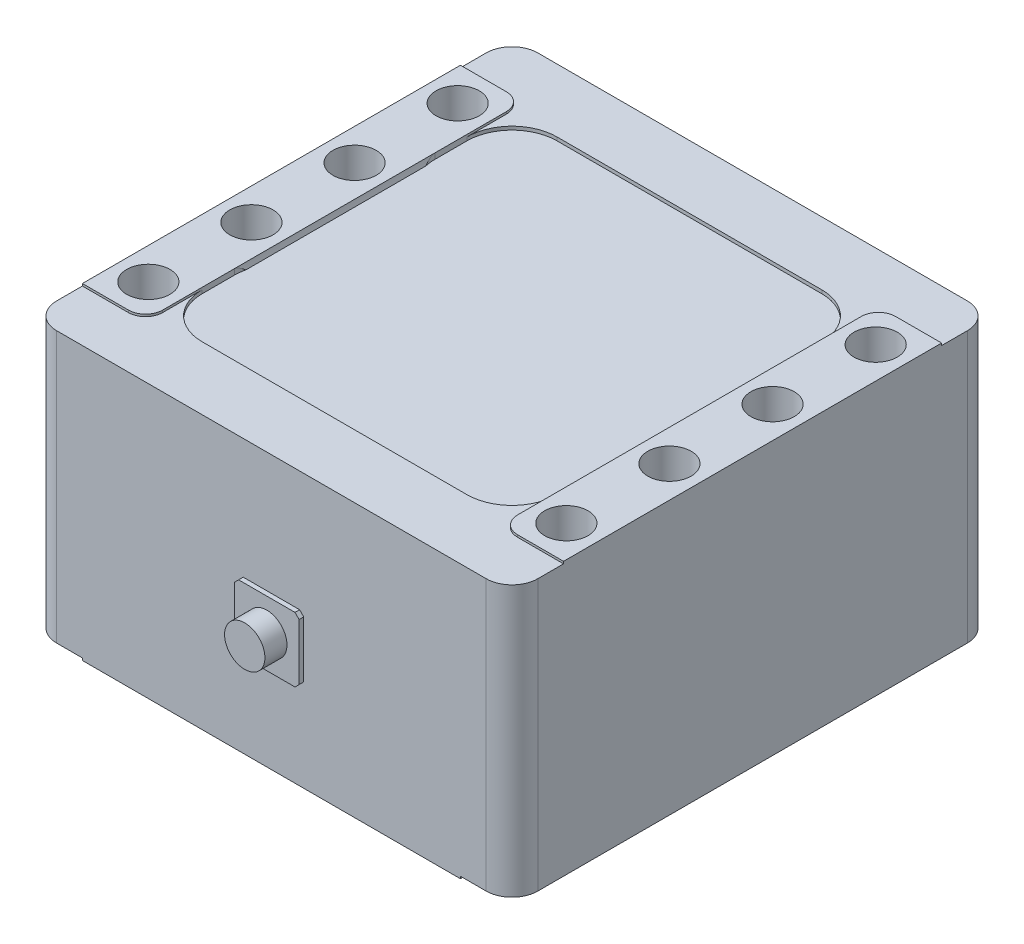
ISO-10303-21;
HEADER;
FILE_DESCRIPTION(('STEP AP214'),'2;1');
FILE_NAME('part.step','',(''),(''),'','','');
FILE_SCHEMA(('AUTOMOTIVE_DESIGN { 1 0 10303 214 1 1 1 1 }'));
ENDSEC;
DATA;
#1=APPLICATION_CONTEXT('core data for automotive mechanical design processes');
#2=APPLICATION_PROTOCOL_DEFINITION('international standard','automotive_design',2000,#1);
#3=PRODUCT_CONTEXT('',#1,'mechanical');
#4=PRODUCT('Part','Part','',(#3));
#5=PRODUCT_RELATED_PRODUCT_CATEGORY('part','',(#4));
#6=PRODUCT_DEFINITION_FORMATION('','',#4);
#7=PRODUCT_DEFINITION_CONTEXT('part definition',#1,'design');
#8=PRODUCT_DEFINITION('design','',#6,#7);
#9=PRODUCT_DEFINITION_SHAPE('','',#8);
#10=(LENGTH_UNIT() NAMED_UNIT(*) SI_UNIT(.MILLI.,.METRE.));
#11=(NAMED_UNIT(*) PLANE_ANGLE_UNIT() SI_UNIT($,.RADIAN.));
#12=(NAMED_UNIT(*) SI_UNIT($,.STERADIAN.) SOLID_ANGLE_UNIT());
#13=UNCERTAINTY_MEASURE_WITH_UNIT(LENGTH_MEASURE(1.E-05),#10,'distance_accuracy_value','');
#14=(GEOMETRIC_REPRESENTATION_CONTEXT(3) GLOBAL_UNCERTAINTY_ASSIGNED_CONTEXT((#13)) GLOBAL_UNIT_ASSIGNED_CONTEXT((#10,
#11,#12)) REPRESENTATION_CONTEXT('',''));
#15=CARTESIAN_POINT('',(0.,0.,0.));
#16=DIRECTION('',(0.,0.,1.));
#17=DIRECTION('',(1.,0.,0.));
#18=AXIS2_PLACEMENT_3D('',#15,#16,#17);
#19=CARTESIAN_POINT('',(0.,-6.35,98.7552290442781));
#20=DIRECTION('',(0.,0.,1.));
#21=DIRECTION('',(1.,0.,0.));
#22=AXIS2_PLACEMENT_3D('',#19,#20,#21);
#23=PLANE('',#22);
#24=CARTESIAN_POINT('',(0.,-6.35,98.7552290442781));
#25=DIRECTION('',(0.,0.,-1.));
#26=DIRECTION('',(-1.,0.,0.));
#27=AXIS2_PLACEMENT_3D('',#24,#25,#26);
#28=CIRCLE('',#27,7.4549);
#29=CARTESIAN_POINT('',(-7.4549,-6.35,98.7552290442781));
#30=VERTEX_POINT('',#29);
#31=EDGE_CURVE('E20',#30,#30,#28,.T.);
#32=ORIENTED_EDGE('',*,*,#31,.F.);
#33=EDGE_LOOP('',(#32));
#34=FACE_BOUND('',#33,.T.);
#35=ADVANCED_FACE('F17',(#34),#23,.T.);
#36=CARTESIAN_POINT('',(19.05,-10.6162330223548,-77.231904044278));
#37=DIRECTION('',(0.,-1.,0.));
#38=DIRECTION('',(0.,0.,-1.));
#39=AXIS2_PLACEMENT_3D('',#36,#37,#38);
#40=PLANE('',#39);
#41=CARTESIAN_POINT('',(19.05,-10.6162330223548,-77.231904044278));
#42=DIRECTION('',(0.,-1.,0.));
#43=DIRECTION('',(0.,0.,-1.));
#44=AXIS2_PLACEMENT_3D('',#41,#42,#43);
#45=CIRCLE('',#44,7.99999999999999);
#46=CARTESIAN_POINT('',(19.05,-10.6162330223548,-85.231904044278));
#47=VERTEX_POINT('',#46);
#48=EDGE_CURVE('E2545',#47,#47,#45,.T.);
#49=ORIENTED_EDGE('',*,*,#48,.T.);
#50=EDGE_LOOP('',(#49));
#51=FACE_BOUND('',#50,.T.);
#52=ADVANCED_FACE('F534',(#51),#40,.T.);
#53=CARTESIAN_POINT('',(-19.05,-10.6162330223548,-77.231904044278));
#54=DIRECTION('',(0.,-1.,0.));
#55=DIRECTION('',(0.,0.,-1.));
#56=AXIS2_PLACEMENT_3D('',#53,#54,#55);
#57=PLANE('',#56);
#58=CARTESIAN_POINT('',(-19.05,-10.6162330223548,-77.231904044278));
#59=DIRECTION('',(0.,-1.,0.));
#60=DIRECTION('',(0.,0.,-1.));
#61=AXIS2_PLACEMENT_3D('',#58,#59,#60);
#62=CIRCLE('',#61,7.99999999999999);
#63=CARTESIAN_POINT('',(-19.05,-10.6162330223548,-85.231904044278));
#64=VERTEX_POINT('',#63);
#65=EDGE_CURVE('E2542',#64,#64,#62,.T.);
#66=ORIENTED_EDGE('',*,*,#65,.T.);
#67=EDGE_LOOP('',(#66));
#68=FACE_BOUND('',#67,.T.);
#69=ADVANCED_FACE('F531',(#68),#57,.T.);
#70=CARTESIAN_POINT('',(57.15,-10.6162330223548,-77.231904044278));
#71=DIRECTION('',(0.,-1.,0.));
#72=DIRECTION('',(0.,0.,-1.));
#73=AXIS2_PLACEMENT_3D('',#70,#71,#72);
#74=PLANE('',#73);
#75=CARTESIAN_POINT('',(57.15,-10.6162330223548,-77.231904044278));
#76=DIRECTION('',(0.,-1.,0.));
#77=DIRECTION('',(0.,0.,-1.));
#78=AXIS2_PLACEMENT_3D('',#75,#76,#77);
#79=CIRCLE('',#78,8.00000000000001);
#80=CARTESIAN_POINT('',(57.15,-10.6162330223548,-85.2319040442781));
#81=VERTEX_POINT('',#80);
#82=EDGE_CURVE('E2538',#81,#81,#79,.T.);
#83=ORIENTED_EDGE('',*,*,#82,.T.);
#84=EDGE_LOOP('',(#83));
#85=FACE_BOUND('',#84,.T.);
#86=ADVANCED_FACE('F527',(#85),#74,.T.);
#87=CARTESIAN_POINT('',(-57.15,-10.6162330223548,-77.231904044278));
#88=DIRECTION('',(0.,-1.,0.));
#89=DIRECTION('',(0.,0.,-1.));
#90=AXIS2_PLACEMENT_3D('',#87,#88,#89);
#91=PLANE('',#90);
#92=CARTESIAN_POINT('',(-57.15,-10.6162330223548,-77.231904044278));
#93=DIRECTION('',(0.,-1.,0.));
#94=DIRECTION('',(0.,0.,-1.));
#95=AXIS2_PLACEMENT_3D('',#92,#93,#94);
#96=CIRCLE('',#95,7.99999999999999);
#97=CARTESIAN_POINT('',(-57.15,-10.6162330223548,-85.231904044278));
#98=VERTEX_POINT('',#97);
#99=EDGE_CURVE('E2535',#98,#98,#96,.T.);
#100=ORIENTED_EDGE('',*,*,#99,.T.);
#101=EDGE_LOOP('',(#100));
#102=FACE_BOUND('',#101,.T.);
#103=ADVANCED_FACE('F523',(#102),#91,.T.);
#104=CARTESIAN_POINT('',(0.,-6.35,98.7552290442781));
#105=DIRECTION('',(0.,0.,-1.));
#106=DIRECTION('',(-1.,0.,0.));
#107=AXIS2_PLACEMENT_3D('',#104,#105,#106);
#108=CYLINDRICAL_SURFACE('',#107,7.4549);
#109=ORIENTED_EDGE('',*,*,#31,.T.);
#110=EDGE_LOOP('',(#109));
#111=FACE_BOUND('',#110,.T.);
#112=CARTESIAN_POINT('',(0.,-6.35,90.6018290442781));
#113=DIRECTION('',(0.,0.,-1.));
#114=DIRECTION('',(-1.,0.,0.));
#115=AXIS2_PLACEMENT_3D('',#112,#113,#114);
#116=CIRCLE('',#115,7.4549);
#117=CARTESIAN_POINT('',(-7.4549,-6.35,90.6018290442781));
#118=VERTEX_POINT('',#117);
#119=EDGE_CURVE('E1373',#118,#118,#116,.F.);
#120=ORIENTED_EDGE('',*,*,#119,.T.);
#121=EDGE_LOOP('',(#120));
#122=FACE_BOUND('',#121,.T.);
#123=ADVANCED_FACE('F519',(#111,#122),#108,.T.);
#124=CARTESIAN_POINT('',(-37.0416666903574,-50.7990330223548,-48.8949709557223));
#125=DIRECTION('',(0.,1.,0.));
#126=DIRECTION('',(0.,0.,1.));
#127=AXIS2_PLACEMENT_3D('',#124,#125,#126);
#128=CYLINDRICAL_SURFACE('',#127,16.66875);
#129=CARTESIAN_POINT('',(-37.0416666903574,-48.7162330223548,-48.8949709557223));
#130=DIRECTION('',(0.,1.,0.));
#131=DIRECTION('',(0.,0.,1.));
#132=AXIS2_PLACEMENT_3D('',#129,#130,#131);
#133=CIRCLE('',#132,16.66875);
#134=CARTESIAN_POINT('',(-37.0416666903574,-48.7162330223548,-65.563720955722));
#135=VERTEX_POINT('',#134);
#136=CARTESIAN_POINT('',(-33.2272326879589,-48.7162330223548,-65.1214098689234));
#137=VERTEX_POINT('',#136);
#138=EDGE_CURVE('E393',#135,#137,#133,.F.);
#139=ORIENTED_EDGE('',*,*,#138,.F.);
#140=DIRECTION('',(0.,1.,0.));
#141=VECTOR('',#140,1.);
#142=CARTESIAN_POINT('',(-37.0416666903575,-50.7990330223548,-65.563720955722));
#143=LINE('',#142,#141);
#144=CARTESIAN_POINT('',(-37.0416666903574,-50.7990330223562,-65.5637209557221));
#145=VERTEX_POINT('',#144);
#146=EDGE_CURVE('E1385',#135,#145,#143,.F.);
#147=ORIENTED_EDGE('',*,*,#146,.T.);
#148=CARTESIAN_POINT('',(-37.0416666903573,-50.7990330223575,-65.5637209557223));
#149=CARTESIAN_POINT('',(-36.9621922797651,-50.7991601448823,-65.5637287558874));
#150=CARTESIAN_POINT('',(-36.8828211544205,-50.7945227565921,-65.5631529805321));
#151=CARTESIAN_POINT('',(-36.7253818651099,-50.7767826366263,-65.5609029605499));
#152=CARTESIAN_POINT('',(-36.6473095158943,-50.7637170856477,-65.5592335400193));
#153=CARTESIAN_POINT('',(-36.4943495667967,-50.7304920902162,-65.5549061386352));
#154=CARTESIAN_POINT('',(-36.419429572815,-50.7104748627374,-65.5522679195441));
#155=CARTESIAN_POINT('',(-36.2713779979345,-50.6646121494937,-65.5460780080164));
#156=CARTESIAN_POINT('',(-36.1982484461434,-50.6387603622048,-65.5425253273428));
#157=CARTESIAN_POINT('',(-35.9381214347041,-50.5375034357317,-65.52821859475));
#158=CARTESIAN_POINT('',(-35.7564005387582,-50.449063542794,-65.515046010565));
#159=CARTESIAN_POINT('',(-35.4018926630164,-50.2565446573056,-65.4838261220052));
#160=CARTESIAN_POINT('',(-35.2291309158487,-50.1524244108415,-65.4657658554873));
#161=CARTESIAN_POINT('',(-34.8862300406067,-49.9335454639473,-65.4246913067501));
#162=CARTESIAN_POINT('',(-34.7162110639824,-49.8186166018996,-65.4015857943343));
#163=CARTESIAN_POINT('',(-34.3806232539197,-49.5839188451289,-65.3508155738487));
#164=CARTESIAN_POINT('',(-34.2150491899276,-49.4641560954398,-65.3231565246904));
#165=CARTESIAN_POINT('',(-33.9106187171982,-49.2392317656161,-65.2676346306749));
#166=CARTESIAN_POINT('',(-33.7713601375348,-49.1344622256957,-65.2403792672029));
#167=CARTESIAN_POINT('',(-33.4969493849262,-48.9253013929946,-65.1830479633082));
#168=CARTESIAN_POINT('',(-33.3617676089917,-48.8209337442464,-65.1530276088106));
#169=CARTESIAN_POINT('',(-33.2272326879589,-48.7162330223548,-65.1214098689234));
#170=B_SPLINE_CURVE_WITH_KNOTS('',3,(#148,#149,#150,#151,#152,#153,#154,#155,#156,#157,#158,
#159,#160,#161,#162,#163,#164,#165,#166,#167,#168,#169),.UNSPECIFIED.,.F.,.F.,(4,2,2,2,2,2,2,2,
2,2,4),(0.,0.238121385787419,0.475199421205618,0.707688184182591,0.940429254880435,
1.54604659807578,2.15328605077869,2.77258051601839,3.39111108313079,3.9202258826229,
4.44037973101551),.UNSPECIFIED.);
#171=EDGE_CURVE('E508',#145,#137,#170,.T.);
#172=ORIENTED_EDGE('',*,*,#171,.T.);
#173=EDGE_LOOP('',(#139,#147,#172));
#174=FACE_BOUND('',#173,.T.);
#175=ADVANCED_FACE('F515',(#174),#128,.F.);
#176=CARTESIAN_POINT('',(-37.0416666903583,-50.7990330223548,48.8950290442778));
#177=DIRECTION('',(0.,1.,0.));
#178=DIRECTION('',(0.,0.,1.));
#179=AXIS2_PLACEMENT_3D('',#176,#177,#178);
#180=CYLINDRICAL_SURFACE('',#179,16.66875);
#181=CARTESIAN_POINT('',(-37.0416666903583,-48.7162330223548,48.8950290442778));
#182=DIRECTION('',(0.,1.,0.));
#183=DIRECTION('',(0.,0.,1.));
#184=AXIS2_PLACEMENT_3D('',#181,#182,#183);
#185=CIRCLE('',#184,16.66875);
#186=CARTESIAN_POINT('',(-33.2272326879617,-48.7162330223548,65.1214679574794));
#187=VERTEX_POINT('',#186);
#188=CARTESIAN_POINT('',(-37.0416666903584,-48.7162330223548,65.563779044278));
#189=VERTEX_POINT('',#188);
#190=EDGE_CURVE('E384',#187,#189,#185,.F.);
#191=ORIENTED_EDGE('',*,*,#190,.F.);
#192=CARTESIAN_POINT('',(-33.2272326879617,-48.7162330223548,65.1214679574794));
#193=CARTESIAN_POINT('',(-33.3695489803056,-48.8269741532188,65.1549123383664));
#194=CARTESIAN_POINT('',(-33.5125796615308,-48.9373566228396,65.1865700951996));
#195=CARTESIAN_POINT('',(-33.8006937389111,-49.1566467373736,65.2463309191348));
#196=CARTESIAN_POINT('',(-33.9457787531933,-49.265553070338,65.2744309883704));
#197=CARTESIAN_POINT('',(-34.2436867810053,-49.4848449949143,65.3279914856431));
#198=CARTESIAN_POINT('',(-34.396599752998,-49.5951413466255,65.3533194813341));
#199=CARTESIAN_POINT('',(-34.7059814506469,-49.8114120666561,65.4000669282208));
#200=CARTESIAN_POINT('',(-34.8624488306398,-49.917388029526,65.4214878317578));
#201=CARTESIAN_POINT('',(-35.2023394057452,-50.1362196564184,65.4629912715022));
#202=CARTESIAN_POINT('',(-35.3865183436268,-50.2480281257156,65.4824881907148));
#203=CARTESIAN_POINT('',(-35.7626102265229,-50.4525992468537,65.5156917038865));
#204=CARTESIAN_POINT('',(-35.9543641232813,-50.5456243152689,65.5294813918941));
#205=CARTESIAN_POINT('',(-36.2938056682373,-50.6744842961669,65.5475815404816));
#206=CARTESIAN_POINT('',(-36.4378374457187,-50.7190937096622,65.5534877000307));
#207=CARTESIAN_POINT('',(-36.6597317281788,-50.7659015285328,65.5595711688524));
#208=CARTESIAN_POINT('',(-36.7354038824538,-50.7781700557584,65.5611375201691));
#209=CARTESIAN_POINT('',(-36.887905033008,-50.7948032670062,65.5632464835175));
#210=CARTESIAN_POINT('',(-36.9647373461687,-50.7991375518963,65.5637851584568));
#211=CARTESIAN_POINT('',(-37.0416666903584,-50.799033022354,65.5637790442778));
#212=B_SPLINE_CURVE_WITH_KNOTS('',3,(#192,#193,#194,#195,#196,#197,#198,#199,#200,#201,#202,
#203,#204,#205,#206,#207,#208,#209,#210,#211),.UNSPECIFIED.,.F.,.F.,(4,2,2,2,2,2,2,2,2,4),(0.,
0.550211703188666,1.10088399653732,1.67149697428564,2.24189741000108,2.89045945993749,
3.52921505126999,3.97983377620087,4.20946158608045,4.43996736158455),.UNSPECIFIED.);
#213=CARTESIAN_POINT('',(-37.0416666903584,-50.7990330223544,65.5637790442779));
#214=VERTEX_POINT('',#213);
#215=EDGE_CURVE('E388',#187,#214,#212,.T.);
#216=ORIENTED_EDGE('',*,*,#215,.T.);
#217=DIRECTION('',(0.,1.,0.));
#218=VECTOR('',#217,1.);
#219=CARTESIAN_POINT('',(-37.0416666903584,-50.7990330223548,65.563779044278));
#220=LINE('',#219,#218);
#221=EDGE_CURVE('E390',#214,#189,#220,.T.);
#222=ORIENTED_EDGE('',*,*,#221,.T.);
#223=EDGE_LOOP('',(#191,#216,#222));
#224=FACE_BOUND('',#223,.T.);
#225=ADVANCED_FACE('F386',(#224),#180,.F.);
#226=CARTESIAN_POINT('',(-57.15,-10.6162330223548,77.231904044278));
#227=DIRECTION('',(0.,-1.,0.));
#228=DIRECTION('',(0.,0.,-1.));
#229=AXIS2_PLACEMENT_3D('',#226,#227,#228);
#230=PLANE('',#229);
#231=CARTESIAN_POINT('',(-57.15,-10.6162330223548,77.231904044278));
#232=DIRECTION('',(0.,-1.,0.));
#233=DIRECTION('',(0.,0.,-1.));
#234=AXIS2_PLACEMENT_3D('',#231,#232,#233);
#235=CIRCLE('',#234,7.99999999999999);
#236=CARTESIAN_POINT('',(-57.15,-10.6162330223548,69.231904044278));
#237=VERTEX_POINT('',#236);
#238=EDGE_CURVE('E409',#237,#237,#235,.T.);
#239=ORIENTED_EDGE('',*,*,#238,.T.);
#240=EDGE_LOOP('',(#239));
#241=FACE_BOUND('',#240,.T.);
#242=ADVANCED_FACE('F1840',(#241),#230,.T.);
#243=CARTESIAN_POINT('',(57.15,-10.6162330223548,77.231904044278));
#244=DIRECTION('',(0.,-1.,0.));
#245=DIRECTION('',(0.,0.,-1.));
#246=AXIS2_PLACEMENT_3D('',#243,#244,#245);
#247=PLANE('',#246);
#248=CARTESIAN_POINT('',(57.15,-10.6162330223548,77.231904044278));
#249=DIRECTION('',(0.,-1.,0.));
#250=DIRECTION('',(0.,0.,-1.));
#251=AXIS2_PLACEMENT_3D('',#248,#249,#250);
#252=CIRCLE('',#251,7.99999999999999);
#253=CARTESIAN_POINT('',(57.15,-10.6162330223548,69.231904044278));
#254=VERTEX_POINT('',#253);
#255=EDGE_CURVE('E412',#254,#254,#252,.T.);
#256=ORIENTED_EDGE('',*,*,#255,.T.);
#257=EDGE_LOOP('',(#256));
#258=FACE_BOUND('',#257,.T.);
#259=ADVANCED_FACE('F825',(#258),#247,.T.);
#260=CARTESIAN_POINT('',(19.05,-10.6162330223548,77.231904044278));
#261=DIRECTION('',(0.,-1.,0.));
#262=DIRECTION('',(0.,0.,-1.));
#263=AXIS2_PLACEMENT_3D('',#260,#261,#262);
#264=PLANE('',#263);
#265=CARTESIAN_POINT('',(19.05,-10.6162330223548,77.231904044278));
#266=DIRECTION('',(0.,-1.,0.));
#267=DIRECTION('',(0.,0.,-1.));
#268=AXIS2_PLACEMENT_3D('',#265,#266,#267);
#269=CIRCLE('',#268,7.99999999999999);
#270=CARTESIAN_POINT('',(19.05,-10.6162330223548,69.231904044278));
#271=VERTEX_POINT('',#270);
#272=EDGE_CURVE('E820',#271,#271,#269,.T.);
#273=ORIENTED_EDGE('',*,*,#272,.T.);
#274=EDGE_LOOP('',(#273));
#275=FACE_BOUND('',#274,.T.);
#276=ADVANCED_FACE('F1834',(#275),#264,.T.);
#277=CARTESIAN_POINT('',(-19.05,-10.6162330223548,77.231904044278));
#278=DIRECTION('',(0.,-1.,0.));
#279=DIRECTION('',(0.,0.,-1.));
#280=AXIS2_PLACEMENT_3D('',#277,#278,#279);
#281=PLANE('',#280);
#282=CARTESIAN_POINT('',(-19.05,-10.6162330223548,77.231904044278));
#283=DIRECTION('',(0.,-1.,0.));
#284=DIRECTION('',(0.,0.,-1.));
#285=AXIS2_PLACEMENT_3D('',#282,#283,#284);
#286=CIRCLE('',#285,7.99999999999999);
#287=CARTESIAN_POINT('',(-19.05,-10.6162330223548,69.231904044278));
#288=VERTEX_POINT('',#287);
#289=EDGE_CURVE('E816',#288,#288,#286,.T.);
#290=ORIENTED_EDGE('',*,*,#289,.T.);
#291=EDGE_LOOP('',(#290));
#292=FACE_BOUND('',#291,.T.);
#293=ADVANCED_FACE('F1829',(#292),#281,.T.);
#294=CARTESIAN_POINT('',(37.0416666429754,-50.7990330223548,-48.8949709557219));
#295=DIRECTION('',(0.,1.,0.));
#296=DIRECTION('',(0.,0.,1.));
#297=AXIS2_PLACEMENT_3D('',#294,#295,#296);
#298=CYLINDRICAL_SURFACE('',#297,16.66875);
#299=CARTESIAN_POINT('',(37.0416666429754,-48.7162330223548,-48.8949709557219));
#300=DIRECTION('',(0.,1.,0.));
#301=DIRECTION('',(0.,0.,1.));
#302=AXIS2_PLACEMENT_3D('',#299,#300,#301);
#303=CIRCLE('',#302,16.66875);
#304=CARTESIAN_POINT('',(33.2272326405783,-48.7162330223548,-65.1214098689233));
#305=VERTEX_POINT('',#304);
#306=CARTESIAN_POINT('',(37.0416666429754,-48.7162330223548,-65.5637209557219));
#307=VERTEX_POINT('',#306);
#308=EDGE_CURVE('E1778',#305,#307,#303,.F.);
#309=ORIENTED_EDGE('',*,*,#308,.F.);
#310=CARTESIAN_POINT('',(33.2272326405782,-48.7162330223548,-65.1214098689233));
#311=CARTESIAN_POINT('',(33.3695489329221,-48.8269741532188,-65.1548542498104));
#312=CARTESIAN_POINT('',(33.5125796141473,-48.9373566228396,-65.1865120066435));
#313=CARTESIAN_POINT('',(33.8006936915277,-49.1566467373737,-65.2462728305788));
#314=CARTESIAN_POINT('',(33.9457787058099,-49.2655530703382,-65.2743728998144));
#315=CARTESIAN_POINT('',(34.2436867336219,-49.4848449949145,-65.3279333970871));
#316=CARTESIAN_POINT('',(34.3965997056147,-49.5951413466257,-65.3532613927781));
#317=CARTESIAN_POINT('',(34.7059814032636,-49.8114120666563,-65.4000088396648));
#318=CARTESIAN_POINT('',(34.8624487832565,-49.9173880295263,-65.4214297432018));
#319=CARTESIAN_POINT('',(35.2023393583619,-50.1362196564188,-65.4629331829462));
#320=CARTESIAN_POINT('',(35.3865182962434,-50.248028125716,-65.4824301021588));
#321=CARTESIAN_POINT('',(35.7626101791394,-50.4525992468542,-65.5156336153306));
#322=CARTESIAN_POINT('',(35.9543640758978,-50.5456243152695,-65.5294233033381));
#323=CARTESIAN_POINT('',(36.2938056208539,-50.6744842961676,-65.5475234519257));
#324=CARTESIAN_POINT('',(36.4378373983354,-50.7190937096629,-65.5534296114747));
#325=CARTESIAN_POINT('',(36.6597316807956,-50.7659015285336,-65.5595130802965));
#326=CARTESIAN_POINT('',(36.7354038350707,-50.7781700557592,-65.5610794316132));
#327=CARTESIAN_POINT('',(36.8879049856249,-50.794803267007,-65.5631883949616));
#328=CARTESIAN_POINT('',(36.9647372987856,-50.7991375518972,-65.5637270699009));
#329=CARTESIAN_POINT('',(37.0416666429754,-50.7990330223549,-65.5637209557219));
#330=B_SPLINE_CURVE_WITH_KNOTS('',3,(#310,#311,#312,#313,#314,#315,#316,#317,#318,#319,#320,
#321,#322,#323,#324,#325,#326,#327,#328,#329),.UNSPECIFIED.,.F.,.F.,(4,2,2,2,2,2,2,2,2,4),(0.,
0.550211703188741,1.10088399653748,1.67149697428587,2.2418974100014,2.89045945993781,
3.52921505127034,3.97983377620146,4.20946158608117,4.4399673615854),.UNSPECIFIED.);
#331=CARTESIAN_POINT('',(37.0416666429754,-50.7990330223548,-65.5637209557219));
#332=VERTEX_POINT('',#331);
#333=EDGE_CURVE('E501',#305,#332,#330,.T.);
#334=ORIENTED_EDGE('',*,*,#333,.T.);
#335=DIRECTION('',(0.,1.,0.));
#336=VECTOR('',#335,1.);
#337=CARTESIAN_POINT('',(37.0416666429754,-50.7990330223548,-65.5637209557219));
#338=LINE('',#337,#336);
#339=EDGE_CURVE('E1331',#332,#307,#338,.T.);
#340=ORIENTED_EDGE('',*,*,#339,.T.);
#341=EDGE_LOOP('',(#309,#334,#340));
#342=FACE_BOUND('',#341,.T.);
#343=ADVANCED_FACE('F1825',(#342),#298,.F.);
#344=CARTESIAN_POINT('',(-79.3749999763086,-48.7162330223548,79.3750290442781));
#345=DIRECTION('',(0.,-1.,0.));
#346=DIRECTION('',(0.,0.,-1.));
#347=AXIS2_PLACEMENT_3D('',#344,#345,#346);
#348=PLANE('',#347);
#349=CARTESIAN_POINT('',(37.0416666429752,-48.7162330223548,48.8950290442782));
#350=DIRECTION('',(0.,1.,0.));
#351=DIRECTION('',(0.,0.,1.));
#352=AXIS2_PLACEMENT_3D('',#349,#350,#351);
#353=CIRCLE('',#352,16.66875);
#354=CARTESIAN_POINT('',(37.0416666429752,-48.7162330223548,65.5637790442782));
#355=VERTEX_POINT('',#354);
#356=CARTESIAN_POINT('',(33.227232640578,-48.7162330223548,65.1214679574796));
#357=VERTEX_POINT('',#356);
#358=EDGE_CURVE('E398',#355,#357,#353,.F.);
#359=ORIENTED_EDGE('',*,*,#358,.T.);
#360=DIRECTION('',(1.,0.,0.));
#361=VECTOR('',#360,1.);
#362=CARTESIAN_POINT('',(48.8949999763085,-48.7162330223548,65.1214679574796));
#363=LINE('',#362,#361);
#364=EDGE_CURVE('E395',#357,#187,#363,.F.);
#365=ORIENTED_EDGE('',*,*,#364,.T.);
#366=ORIENTED_EDGE('',*,*,#190,.T.);
#367=DIRECTION('',(1.,0.,0.));
#368=VECTOR('',#367,1.);
#369=CARTESIAN_POINT('',(48.8949999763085,-48.7162330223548,65.5637790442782));
#370=LINE('',#369,#368);
#371=CARTESIAN_POINT('',(-48.8950000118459,-48.7162330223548,65.5637790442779));
#372=VERTEX_POINT('',#371);
#373=EDGE_CURVE('E1349',#189,#372,#370,.F.);
#374=ORIENTED_EDGE('',*,*,#373,.T.);
#375=CARTESIAN_POINT('',(-48.8950000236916,-48.7162330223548,48.8950290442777));
#376=DIRECTION('',(0.,1.,0.));
#377=DIRECTION('',(0.,0.,1.));
#378=AXIS2_PLACEMENT_3D('',#375,#376,#377);
#379=CIRCLE('',#378,16.66875);
#380=CARTESIAN_POINT('',(-65.5637500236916,-48.7162330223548,48.8950290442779));
#381=VERTEX_POINT('',#380);
#382=EDGE_CURVE('E1358',#372,#381,#379,.F.);
#383=ORIENTED_EDGE('',*,*,#382,.T.);
#384=DIRECTION('',(0.,0.,1.));
#385=VECTOR('',#384,1.);
#386=CARTESIAN_POINT('',(-65.5637500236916,-48.7162330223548,48.8950290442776));
#387=LINE('',#386,#385);
#388=CARTESIAN_POINT('',(-65.563750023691,-48.7162330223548,-48.8949709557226));
#389=VERTEX_POINT('',#388);
#390=EDGE_CURVE('E1361',#381,#389,#387,.F.);
#391=ORIENTED_EDGE('',*,*,#390,.T.);
#392=CARTESIAN_POINT('',(-48.8950000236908,-48.7162330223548,-48.8949709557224));
#393=DIRECTION('',(0.,1.,0.));
#394=DIRECTION('',(0.,0.,1.));
#395=AXIS2_PLACEMENT_3D('',#392,#393,#394);
#396=CIRCLE('',#395,16.66875);
#397=CARTESIAN_POINT('',(-48.8950000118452,-48.7162330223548,-65.5637209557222));
#398=VERTEX_POINT('',#397);
#399=EDGE_CURVE('E1364',#389,#398,#396,.F.);
#400=ORIENTED_EDGE('',*,*,#399,.T.);
#401=DIRECTION('',(-1.,0.,0.));
#402=VECTOR('',#401,1.);
#403=CARTESIAN_POINT('',(37.0416666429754,-48.7162330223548,-65.5637209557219));
#404=LINE('',#403,#402);
#405=EDGE_CURVE('E1367',#398,#135,#404,.F.);
#406=ORIENTED_EDGE('',*,*,#405,.T.);
#407=ORIENTED_EDGE('',*,*,#138,.T.);
#408=DIRECTION('',(-1.,0.,0.));
#409=VECTOR('',#408,1.);
#410=CARTESIAN_POINT('',(37.0416666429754,-48.7162330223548,-65.1214098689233));
#411=LINE('',#410,#409);
#412=EDGE_CURVE('E513',#137,#305,#411,.F.);
#413=ORIENTED_EDGE('',*,*,#412,.T.);
#414=ORIENTED_EDGE('',*,*,#308,.T.);
#415=DIRECTION('',(-1.,0.,0.));
#416=VECTOR('',#415,1.);
#417=CARTESIAN_POINT('',(37.0416666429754,-48.7162330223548,-65.5637209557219));
#418=LINE('',#417,#416);
#419=CARTESIAN_POINT('',(48.8949999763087,-48.7162330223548,-65.5637209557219));
#420=VERTEX_POINT('',#419);
#421=EDGE_CURVE('E1328',#307,#420,#418,.F.);
#422=ORIENTED_EDGE('',*,*,#421,.T.);
#423=CARTESIAN_POINT('',(48.8949999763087,-48.7162330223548,-48.8949709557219));
#424=DIRECTION('',(0.,1.,0.));
#425=DIRECTION('',(0.,0.,1.));
#426=AXIS2_PLACEMENT_3D('',#423,#424,#425);
#427=CIRCLE('',#426,16.66875);
#428=CARTESIAN_POINT('',(65.5637499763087,-48.7162330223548,-48.8949709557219));
#429=VERTEX_POINT('',#428);
#430=EDGE_CURVE('E812',#420,#429,#427,.F.);
#431=ORIENTED_EDGE('',*,*,#430,.T.);
#432=DIRECTION('',(0.,0.,-1.));
#433=VECTOR('',#432,1.);
#434=CARTESIAN_POINT('',(65.5637499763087,-48.7162330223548,-48.8949709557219));
#435=LINE('',#434,#433);
#436=CARTESIAN_POINT('',(65.5637499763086,-48.7162330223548,48.8950290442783));
#437=VERTEX_POINT('',#436);
#438=EDGE_CURVE('E1323',#429,#437,#435,.F.);
#439=ORIENTED_EDGE('',*,*,#438,.T.);
#440=CARTESIAN_POINT('',(48.8949999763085,-48.7162330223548,48.8950290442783));
#441=DIRECTION('',(0.,1.,0.));
#442=DIRECTION('',(0.,0.,1.));
#443=AXIS2_PLACEMENT_3D('',#440,#441,#442);
#444=CIRCLE('',#443,16.66875);
#445=CARTESIAN_POINT('',(48.8949999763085,-48.7162330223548,65.5637790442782));
#446=VERTEX_POINT('',#445);
#447=EDGE_CURVE('E808',#437,#446,#444,.F.);
#448=ORIENTED_EDGE('',*,*,#447,.T.);
#449=DIRECTION('',(1.,0.,0.));
#450=VECTOR('',#449,1.);
#451=CARTESIAN_POINT('',(48.8949999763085,-48.7162330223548,65.5637790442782));
#452=LINE('',#451,#450);
#453=EDGE_CURVE('E1320',#446,#355,#452,.F.);
#454=ORIENTED_EDGE('',*,*,#453,.T.);
#455=EDGE_LOOP('',(#359,#365,#366,#374,#383,#391,#400,#406,#407,#413,#414,#422,#431,#439,#448,#454));
#456=FACE_BOUND('',#455,.T.);
#457=ADVANCED_FACE('F396',(#456),#348,.T.);
#458=CARTESIAN_POINT('',(37.0416666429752,-50.7990330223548,48.8950290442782));
#459=DIRECTION('',(0.,1.,0.));
#460=DIRECTION('',(0.,0.,1.));
#461=AXIS2_PLACEMENT_3D('',#458,#459,#460);
#462=CYLINDRICAL_SURFACE('',#461,16.66875);
#463=ORIENTED_EDGE('',*,*,#358,.F.);
#464=DIRECTION('',(0.,1.,0.));
#465=VECTOR('',#464,1.);
#466=CARTESIAN_POINT('',(37.0416666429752,-50.7990330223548,65.5637790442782));
#467=LINE('',#466,#465);
#468=CARTESIAN_POINT('',(37.0416666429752,-50.7990330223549,65.5637790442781));
#469=VERTEX_POINT('',#468);
#470=EDGE_CURVE('E1317',#355,#469,#467,.F.);
#471=ORIENTED_EDGE('',*,*,#470,.T.);
#472=CARTESIAN_POINT('',(37.0416666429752,-50.7990330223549,65.5637790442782));
#473=CARTESIAN_POINT('',(36.9621922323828,-50.7991601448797,65.5637868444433));
#474=CARTESIAN_POINT('',(36.8828211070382,-50.7945227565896,65.563211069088));
#475=CARTESIAN_POINT('',(36.7253818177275,-50.7767826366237,65.5609610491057));
#476=CARTESIAN_POINT('',(36.6473094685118,-50.7637170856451,65.5592916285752));
#477=CARTESIAN_POINT('',(36.494349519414,-50.7304920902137,65.5549642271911));
#478=CARTESIAN_POINT('',(36.4194295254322,-50.7104748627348,65.5523260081));
#479=CARTESIAN_POINT('',(36.2713779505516,-50.6646121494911,65.5461360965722));
#480=CARTESIAN_POINT('',(36.1982483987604,-50.6387603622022,65.5425834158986));
#481=CARTESIAN_POINT('',(35.938121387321,-50.5375034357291,65.5282766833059));
#482=CARTESIAN_POINT('',(35.7564004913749,-50.4490635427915,65.5151040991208));
#483=CARTESIAN_POINT('',(35.401892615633,-50.2565446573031,65.483884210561));
#484=CARTESIAN_POINT('',(35.2291308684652,-50.152424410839,65.465823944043));
#485=CARTESIAN_POINT('',(34.8862299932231,-49.9335454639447,65.4247493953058));
#486=CARTESIAN_POINT('',(34.7162110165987,-49.818616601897,65.4016438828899));
#487=CARTESIAN_POINT('',(34.3806232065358,-49.5839188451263,65.3508736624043));
#488=CARTESIAN_POINT('',(34.2150491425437,-49.4641560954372,65.323214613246));
#489=CARTESIAN_POINT('',(33.9106186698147,-49.239231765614,65.2676927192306));
#490=CARTESIAN_POINT('',(33.7713600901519,-49.1344622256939,65.2404373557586));
#491=CARTESIAN_POINT('',(33.4969493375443,-48.9253013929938,65.1831060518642));
#492=CARTESIAN_POINT('',(33.3617675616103,-48.820933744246,65.1530856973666));
#493=CARTESIAN_POINT('',(33.227232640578,-48.7162330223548,65.1214679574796));
#494=B_SPLINE_CURVE_WITH_KNOTS('',3,(#472,#473,#474,#475,#476,#477,#478,#479,#480,#481,#482,
#483,#484,#485,#486,#487,#488,#489,#490,#491,#492,#493),.UNSPECIFIED.,.F.,.F.,(4,2,2,2,2,2,2,2,
2,2,4),(0.,0.238121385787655,0.475199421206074,0.707688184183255,0.94042925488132,
1.54604659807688,2.15328605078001,2.77258051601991,3.3911110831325,3.92022588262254,
4.44037973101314),.UNSPECIFIED.);
#495=EDGE_CURVE('E402',#469,#357,#494,.T.);
#496=ORIENTED_EDGE('',*,*,#495,.T.);
#497=EDGE_LOOP('',(#463,#471,#496));
#498=FACE_BOUND('',#497,.T.);
#499=ADVANCED_FACE('F495',(#498),#462,.F.);
#500=CARTESIAN_POINT('',(37.0416666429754,-52.3865330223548,-52.9633303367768));
#501=DIRECTION('',(-1.,0.,0.));
#502=DIRECTION('',(0.,0.,1.));
#503=AXIS2_PLACEMENT_3D('',#500,#501,#502);
#504=CYLINDRICAL_SURFACE('',#503,12.7);
#505=ORIENTED_EDGE('',*,*,#412,.F.);
#506=ORIENTED_EDGE('',*,*,#171,.F.);
#507=DIRECTION('',(1.,0.,0.));
#508=VECTOR('',#507,1.);
#509=CARTESIAN_POINT('',(-79.3750000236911,-50.7990330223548,-65.5637209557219));
#510=LINE('',#509,#508);
#511=EDGE_CURVE('E797',#332,#145,#510,.F.);
#512=ORIENTED_EDGE('',*,*,#511,.F.);
#513=ORIENTED_EDGE('',*,*,#333,.F.);
#514=EDGE_LOOP('',(#505,#506,#512,#513));
#515=FACE_BOUND('',#514,.T.);
#516=ADVANCED_FACE('F491',(#515),#504,.F.);
#517=CARTESIAN_POINT('',(19.05,-50.7990330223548,-77.231904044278));
#518=DIRECTION('',(0.,-1.,0.));
#519=DIRECTION('',(0.,0.,-1.));
#520=AXIS2_PLACEMENT_3D('',#517,#518,#519);
#521=CYLINDRICAL_SURFACE('',#520,7.99999999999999);
#522=CARTESIAN_POINT('',(19.05,-50.7990330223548,-77.231904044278));
#523=DIRECTION('',(0.,-1.,0.));
#524=DIRECTION('',(0.,0.,-1.));
#525=AXIS2_PLACEMENT_3D('',#522,#523,#524);
#526=CIRCLE('',#525,7.99999999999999);
#527=CARTESIAN_POINT('',(19.05,-50.7990330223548,-85.231904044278));
#528=VERTEX_POINT('',#527);
#529=EDGE_CURVE('E794',#528,#528,#526,.F.);
#530=ORIENTED_EDGE('',*,*,#529,.F.);
#531=EDGE_LOOP('',(#530));
#532=FACE_BOUND('',#531,.T.);
#533=ORIENTED_EDGE('',*,*,#48,.F.);
#534=EDGE_LOOP('',(#533));
#535=FACE_BOUND('',#534,.T.);
#536=ADVANCED_FACE('F487',(#532,#535),#521,.F.);
#537=CARTESIAN_POINT('',(-19.05,-50.7990330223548,-77.231904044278));
#538=DIRECTION('',(0.,-1.,0.));
#539=DIRECTION('',(0.,0.,-1.));
#540=AXIS2_PLACEMENT_3D('',#537,#538,#539);
#541=CYLINDRICAL_SURFACE('',#540,7.99999999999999);
#542=CARTESIAN_POINT('',(-19.05,-50.7990330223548,-77.231904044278));
#543=DIRECTION('',(0.,-1.,0.));
#544=DIRECTION('',(0.,0.,-1.));
#545=AXIS2_PLACEMENT_3D('',#542,#543,#544);
#546=CIRCLE('',#545,7.99999999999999);
#547=CARTESIAN_POINT('',(-19.05,-50.7990330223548,-85.231904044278));
#548=VERTEX_POINT('',#547);
#549=EDGE_CURVE('E791',#548,#548,#546,.F.);
#550=ORIENTED_EDGE('',*,*,#549,.F.);
#551=EDGE_LOOP('',(#550));
#552=FACE_BOUND('',#551,.T.);
#553=ORIENTED_EDGE('',*,*,#65,.F.);
#554=EDGE_LOOP('',(#553));
#555=FACE_BOUND('',#554,.T.);
#556=ADVANCED_FACE('F483',(#552,#555),#541,.F.);
#557=CARTESIAN_POINT('',(57.15,-50.7990330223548,-77.231904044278));
#558=DIRECTION('',(0.,-1.,0.));
#559=DIRECTION('',(0.,0.,-1.));
#560=AXIS2_PLACEMENT_3D('',#557,#558,#559);
#561=CYLINDRICAL_SURFACE('',#560,8.00000000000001);
#562=CARTESIAN_POINT('',(57.15,-50.7990330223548,-77.231904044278));
#563=DIRECTION('',(0.,-1.,0.));
#564=DIRECTION('',(0.,0.,-1.));
#565=AXIS2_PLACEMENT_3D('',#562,#563,#564);
#566=CIRCLE('',#565,8.00000000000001);
#567=CARTESIAN_POINT('',(57.15,-50.7990330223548,-85.2319040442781));
#568=VERTEX_POINT('',#567);
#569=EDGE_CURVE('E788',#568,#568,#566,.F.);
#570=ORIENTED_EDGE('',*,*,#569,.F.);
#571=EDGE_LOOP('',(#570));
#572=FACE_BOUND('',#571,.T.);
#573=ORIENTED_EDGE('',*,*,#82,.F.);
#574=EDGE_LOOP('',(#573));
#575=FACE_BOUND('',#574,.T.);
#576=ADVANCED_FACE('F479',(#572,#575),#561,.F.);
#577=CARTESIAN_POINT('',(-57.15,-50.7990330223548,-77.231904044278));
#578=DIRECTION('',(0.,-1.,0.));
#579=DIRECTION('',(0.,0.,-1.));
#580=AXIS2_PLACEMENT_3D('',#577,#578,#579);
#581=CYLINDRICAL_SURFACE('',#580,7.99999999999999);
#582=CARTESIAN_POINT('',(-57.15,-50.7990330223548,-77.231904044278));
#583=DIRECTION('',(0.,-1.,0.));
#584=DIRECTION('',(0.,0.,-1.));
#585=AXIS2_PLACEMENT_3D('',#582,#583,#584);
#586=CIRCLE('',#585,7.99999999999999);
#587=CARTESIAN_POINT('',(-57.15,-50.7990330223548,-85.231904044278));
#588=VERTEX_POINT('',#587);
#589=EDGE_CURVE('E784',#588,#588,#586,.F.);
#590=ORIENTED_EDGE('',*,*,#589,.F.);
#591=EDGE_LOOP('',(#590));
#592=FACE_BOUND('',#591,.T.);
#593=ORIENTED_EDGE('',*,*,#99,.F.);
#594=EDGE_LOOP('',(#593));
#595=FACE_BOUND('',#594,.T.);
#596=ADVANCED_FACE('F475',(#592,#595),#581,.F.);
#597=CARTESIAN_POINT('',(0.,0.,90.6018290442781));
#598=DIRECTION('',(0.,0.,-1.));
#599=DIRECTION('',(-1.,0.,0.));
#600=AXIS2_PLACEMENT_3D('',#597,#598,#599);
#601=PLANE('',#600);
#602=ORIENTED_EDGE('',*,*,#119,.F.);
#603=EDGE_LOOP('',(#602));
#604=FACE_BOUND('',#603,.T.);
#605=DIRECTION('',(0.,1.,0.));
#606=VECTOR('',#605,1.);
#607=CARTESIAN_POINT('',(-11.938,4.064,90.6018290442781));
#608=LINE('',#607,#606);
#609=CARTESIAN_POINT('',(-11.938,4.064,90.6018290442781));
#610=VERTEX_POINT('',#609);
#611=CARTESIAN_POINT('',(-11.938,-16.764,90.6018290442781));
#612=VERTEX_POINT('',#611);
#613=EDGE_CURVE('E1243',#610,#612,#608,.F.);
#614=ORIENTED_EDGE('',*,*,#613,.T.);
#615=DIRECTION('',(-0.707106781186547,0.707106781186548,0.));
#616=VECTOR('',#615,1.);
#617=CARTESIAN_POINT('',(-11.938,-16.764,90.6018290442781));
#618=LINE('',#617,#616);
#619=CARTESIAN_POINT('',(-10.414,-18.288,90.6018290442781));
#620=VERTEX_POINT('',#619);
#621=EDGE_CURVE('E1252',#612,#620,#618,.F.);
#622=ORIENTED_EDGE('',*,*,#621,.T.);
#623=DIRECTION('',(-1.,0.,0.));
#624=VECTOR('',#623,1.);
#625=CARTESIAN_POINT('',(-10.414,-18.288,90.6018290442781));
#626=LINE('',#625,#624);
#627=CARTESIAN_POINT('',(10.414,-18.288,90.6018290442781));
#628=VERTEX_POINT('',#627);
#629=EDGE_CURVE('E1258',#620,#628,#626,.F.);
#630=ORIENTED_EDGE('',*,*,#629,.T.);
#631=DIRECTION('',(-0.707106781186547,-0.707106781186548,0.));
#632=VECTOR('',#631,1.);
#633=CARTESIAN_POINT('',(10.414,-18.288,90.6018290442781));
#634=LINE('',#633,#632);
#635=CARTESIAN_POINT('',(11.938,-16.764,90.6018290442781));
#636=VERTEX_POINT('',#635);
#637=EDGE_CURVE('E1264',#628,#636,#634,.F.);
#638=ORIENTED_EDGE('',*,*,#637,.T.);
#639=DIRECTION('',(0.,1.,0.));
#640=VECTOR('',#639,1.);
#641=CARTESIAN_POINT('',(11.938,4.064,90.6018290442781));
#642=LINE('',#641,#640);
#643=CARTESIAN_POINT('',(11.938,4.064,90.6018290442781));
#644=VERTEX_POINT('',#643);
#645=EDGE_CURVE('E1267',#644,#636,#642,.F.);
#646=ORIENTED_EDGE('',*,*,#645,.F.);
#647=DIRECTION('',(-0.707106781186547,0.707106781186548,0.));
#648=VECTOR('',#647,1.);
#649=CARTESIAN_POINT('',(10.414,5.588,90.6018290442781));
#650=LINE('',#649,#648);
#651=CARTESIAN_POINT('',(10.414,5.588,90.6018290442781));
#652=VERTEX_POINT('',#651);
#653=EDGE_CURVE('E1273',#652,#644,#650,.F.);
#654=ORIENTED_EDGE('',*,*,#653,.F.);
#655=DIRECTION('',(-1.,0.,0.));
#656=VECTOR('',#655,1.);
#657=CARTESIAN_POINT('',(-10.414,5.588,90.6018290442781));
#658=LINE('',#657,#656);
#659=CARTESIAN_POINT('',(-10.414,5.588,90.6018290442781));
#660=VERTEX_POINT('',#659);
#661=EDGE_CURVE('E1279',#660,#652,#658,.F.);
#662=ORIENTED_EDGE('',*,*,#661,.F.);
#663=DIRECTION('',(-0.707106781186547,-0.707106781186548,0.));
#664=VECTOR('',#663,1.);
#665=CARTESIAN_POINT('',(-11.938,4.064,90.6018290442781));
#666=LINE('',#665,#664);
#667=EDGE_CURVE('E787',#610,#660,#666,.F.);
#668=ORIENTED_EDGE('',*,*,#667,.F.);
#669=EDGE_LOOP('',(#614,#622,#630,#638,#646,#654,#662,#668));
#670=FACE_BOUND('',#669,.T.);
#671=ADVANCED_FACE('F471',(#604,#670),#601,.F.);
#672=CARTESIAN_POINT('',(-69.85,-49.9862330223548,-71.9137209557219));
#673=DIRECTION('',(1.,0.,0.));
#674=DIRECTION('',(0.,0.,-1.));
#675=AXIS2_PLACEMENT_3D('',#672,#673,#674);
#676=PLANE('',#675);
#677=DIRECTION('',(0.,-1.,0.));
#678=VECTOR('',#677,1.);
#679=CARTESIAN_POINT('',(-69.85,-49.9862330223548,-71.9137209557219));
#680=LINE('',#679,#678);
#681=CARTESIAN_POINT('',(-69.85,-49.9862330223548,-71.9137209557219));
#682=VERTEX_POINT('',#681);
#683=CARTESIAN_POINT('',(-69.85,-50.7990330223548,-71.9137209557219));
#684=VERTEX_POINT('',#683);
#685=EDGE_CURVE('E1368',#682,#684,#680,.T.);
#686=ORIENTED_EDGE('',*,*,#685,.F.);
#687=DIRECTION('',(0.,0.,-1.));
#688=VECTOR('',#687,1.);
#689=CARTESIAN_POINT('',(-69.85,-49.9862330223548,79.3750290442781));
#690=LINE('',#689,#688);
#691=CARTESIAN_POINT('',(-69.85,-49.9862330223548,-88.8999709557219));
#692=VERTEX_POINT('',#691);
#693=EDGE_CURVE('E783',#692,#682,#690,.F.);
#694=ORIENTED_EDGE('',*,*,#693,.F.);
#695=DIRECTION('',(0.,1.,0.));
#696=VECTOR('',#695,1.);
#697=CARTESIAN_POINT('',(-69.85,-49.9862330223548,-88.8999709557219));
#698=LINE('',#697,#696);
#699=CARTESIAN_POINT('',(-69.85,-50.7990330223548,-88.8999709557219));
#700=VERTEX_POINT('',#699);
#701=EDGE_CURVE('E1370',#700,#692,#698,.T.);
#702=ORIENTED_EDGE('',*,*,#701,.F.);
#703=DIRECTION('',(0.,0.,-1.));
#704=VECTOR('',#703,1.);
#705=CARTESIAN_POINT('',(-69.85,-50.7990330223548,79.3750290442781));
#706=LINE('',#705,#704);
#707=EDGE_CURVE('E806',#684,#700,#706,.T.);
#708=ORIENTED_EDGE('',*,*,#707,.F.);
#709=EDGE_LOOP('',(#686,#694,#702,#708));
#710=FACE_BOUND('',#709,.T.);
#711=ADVANCED_FACE('F467',(#710),#676,.F.);
#712=CARTESIAN_POINT('',(-63.5,-49.9862330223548,-71.9137209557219));
#713=DIRECTION('',(0.,-1.,0.));
#714=DIRECTION('',(0.,0.,-1.));
#715=AXIS2_PLACEMENT_3D('',#712,#713,#714);
#716=CYLINDRICAL_SURFACE('',#715,6.34999999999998);
#717=CARTESIAN_POINT('',(-63.5,-49.9862330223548,-71.9137209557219));
#718=DIRECTION('',(0.,-1.,0.));
#719=DIRECTION('',(0.,0.,-1.));
#720=AXIS2_PLACEMENT_3D('',#717,#718,#719);
#721=CIRCLE('',#720,6.34999999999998);
#722=CARTESIAN_POINT('',(-63.5,-49.9862330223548,-65.563720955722));
#723=VERTEX_POINT('',#722);
#724=EDGE_CURVE('E780',#682,#723,#721,.F.);
#725=ORIENTED_EDGE('',*,*,#724,.F.);
#726=ORIENTED_EDGE('',*,*,#685,.T.);
#727=CARTESIAN_POINT('',(-63.5,-50.7990330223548,-71.9137209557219));
#728=DIRECTION('',(0.,-1.,0.));
#729=DIRECTION('',(0.,0.,-1.));
#730=AXIS2_PLACEMENT_3D('',#727,#728,#729);
#731=CIRCLE('',#730,6.34999999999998);
#732=CARTESIAN_POINT('',(-63.5,-50.7990330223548,-65.563720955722));
#733=VERTEX_POINT('',#732);
#734=EDGE_CURVE('E803',#733,#684,#731,.T.);
#735=ORIENTED_EDGE('',*,*,#734,.F.);
#736=DIRECTION('',(0.,1.,0.));
#737=VECTOR('',#736,1.);
#738=CARTESIAN_POINT('',(-63.5,-50.7990330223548,-65.563720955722));
#739=LINE('',#738,#737);
#740=EDGE_CURVE('E1365',#733,#723,#739,.T.);
#741=ORIENTED_EDGE('',*,*,#740,.T.);
#742=EDGE_LOOP('',(#725,#726,#735,#741));
#743=FACE_BOUND('',#742,.T.);
#744=ADVANCED_FACE('F463',(#743),#716,.T.);
#745=CARTESIAN_POINT('',(37.0416666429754,-50.7990330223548,-65.5637209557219));
#746=DIRECTION('',(0.,0.,-1.));
#747=DIRECTION('',(-1.,0.,0.));
#748=AXIS2_PLACEMENT_3D('',#745,#746,#747);
#749=PLANE('',#748);
#750=ORIENTED_EDGE('',*,*,#405,.F.);
#751=DIRECTION('',(0.,1.,0.));
#752=VECTOR('',#751,1.);
#753=CARTESIAN_POINT('',(-48.8949999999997,-50.7990330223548,-65.5637209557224));
#754=LINE('',#753,#752);
#755=CARTESIAN_POINT('',(-48.8950000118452,-49.9862330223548,-65.5637209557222));
#756=VERTEX_POINT('',#755);
#757=EDGE_CURVE('E1362',#398,#756,#754,.F.);
#758=ORIENTED_EDGE('',*,*,#757,.T.);
#759=DIRECTION('',(1.,0.,0.));
#760=VECTOR('',#759,1.);
#761=CARTESIAN_POINT('',(-79.3749999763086,-49.9862330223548,-65.5637209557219));
#762=LINE('',#761,#760);
#763=EDGE_CURVE('E779',#723,#756,#762,.T.);
#764=ORIENTED_EDGE('',*,*,#763,.F.);
#765=ORIENTED_EDGE('',*,*,#740,.F.);
#766=DIRECTION('',(1.,0.,0.));
#767=VECTOR('',#766,1.);
#768=CARTESIAN_POINT('',(-79.3750000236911,-50.7990330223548,-65.563720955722));
#769=LINE('',#768,#767);
#770=EDGE_CURVE('E807',#145,#733,#769,.F.);
#771=ORIENTED_EDGE('',*,*,#770,.F.);
#772=ORIENTED_EDGE('',*,*,#146,.F.);
#773=EDGE_LOOP('',(#750,#758,#764,#765,#771,#772));
#774=FACE_BOUND('',#773,.T.);
#775=ADVANCED_FACE('F459',(#774),#749,.F.);
#776=CARTESIAN_POINT('',(-48.8950000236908,-50.7990330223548,-48.8949709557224));
#777=DIRECTION('',(0.,1.,0.));
#778=DIRECTION('',(0.,0.,1.));
#779=AXIS2_PLACEMENT_3D('',#776,#777,#778);
#780=CYLINDRICAL_SURFACE('',#779,16.66875);
#781=ORIENTED_EDGE('',*,*,#399,.F.);
#782=DIRECTION('',(0.,1.,0.));
#783=VECTOR('',#782,1.);
#784=CARTESIAN_POINT('',(-65.563750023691,-50.7990330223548,-48.8949709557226));
#785=LINE('',#784,#783);
#786=CARTESIAN_POINT('',(-65.5637500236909,-49.9862330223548,-48.8949709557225));
#787=VERTEX_POINT('',#786);
#788=EDGE_CURVE('E1359',#389,#787,#785,.F.);
#789=ORIENTED_EDGE('',*,*,#788,.T.);
#790=CARTESIAN_POINT('',(-48.8950000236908,-49.9862330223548,-48.8949709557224));
#791=DIRECTION('',(0.,1.,0.));
#792=DIRECTION('',(0.,0.,1.));
#793=AXIS2_PLACEMENT_3D('',#790,#791,#792);
#794=CIRCLE('',#793,16.66875);
#795=EDGE_CURVE('E776',#756,#787,#794,.T.);
#796=ORIENTED_EDGE('',*,*,#795,.F.);
#797=ORIENTED_EDGE('',*,*,#757,.F.);
#798=EDGE_LOOP('',(#781,#789,#796,#797));
#799=FACE_BOUND('',#798,.T.);
#800=ADVANCED_FACE('F455',(#799),#780,.F.);
#801=CARTESIAN_POINT('',(-65.5637500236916,-50.7990330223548,48.8950290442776));
#802=DIRECTION('',(-1.,0.,0.));
#803=DIRECTION('',(0.,0.,1.));
#804=AXIS2_PLACEMENT_3D('',#801,#802,#803);
#805=PLANE('',#804);
#806=ORIENTED_EDGE('',*,*,#390,.F.);
#807=DIRECTION('',(0.,1.,0.));
#808=VECTOR('',#807,1.);
#809=CARTESIAN_POINT('',(-65.5637500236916,-50.7990330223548,48.8950290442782));
#810=LINE('',#809,#808);
#811=CARTESIAN_POINT('',(-65.5637500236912,-49.9862330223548,48.895029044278));
#812=VERTEX_POINT('',#811);
#813=EDGE_CURVE('E1354',#381,#812,#810,.F.);
#814=ORIENTED_EDGE('',*,*,#813,.T.);
#815=DIRECTION('',(0.,0.,-1.));
#816=VECTOR('',#815,1.);
#817=CARTESIAN_POINT('',(-65.5637500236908,-49.9862330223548,79.3750290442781));
#818=LINE('',#817,#816);
#819=EDGE_CURVE('E775',#787,#812,#818,.F.);
#820=ORIENTED_EDGE('',*,*,#819,.F.);
#821=ORIENTED_EDGE('',*,*,#788,.F.);
#822=EDGE_LOOP('',(#806,#814,#820,#821));
#823=FACE_BOUND('',#822,.T.);
#824=ADVANCED_FACE('F451',(#823),#805,.F.);
#825=CARTESIAN_POINT('',(-48.8950000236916,-50.7990330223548,48.8950290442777));
#826=DIRECTION('',(0.,1.,0.));
#827=DIRECTION('',(0.,0.,1.));
#828=AXIS2_PLACEMENT_3D('',#825,#826,#827);
#829=CYLINDRICAL_SURFACE('',#828,16.66875);
#830=ORIENTED_EDGE('',*,*,#382,.F.);
#831=DIRECTION('',(0.,1.,0.));
#832=VECTOR('',#831,1.);
#833=CARTESIAN_POINT('',(-48.8950000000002,-50.7990330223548,65.5637790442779));
#834=LINE('',#833,#832);
#835=CARTESIAN_POINT('',(-48.8950000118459,-49.9862330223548,65.5637790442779));
#836=VERTEX_POINT('',#835);
#837=EDGE_CURVE('E1391',#372,#836,#834,.F.);
#838=ORIENTED_EDGE('',*,*,#837,.T.);
#839=CARTESIAN_POINT('',(-48.8950000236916,-49.9862330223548,48.8950290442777));
#840=DIRECTION('',(0.,1.,0.));
#841=DIRECTION('',(0.,0.,1.));
#842=AXIS2_PLACEMENT_3D('',#839,#840,#841);
#843=CIRCLE('',#842,16.66875);
#844=EDGE_CURVE('E772',#812,#836,#843,.T.);
#845=ORIENTED_EDGE('',*,*,#844,.F.);
#846=ORIENTED_EDGE('',*,*,#813,.F.);
#847=EDGE_LOOP('',(#830,#838,#845,#846));
#848=FACE_BOUND('',#847,.T.);
#849=ADVANCED_FACE('F447',(#848),#829,.F.);
#850=CARTESIAN_POINT('',(-69.85,-49.9862330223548,71.913779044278));
#851=DIRECTION('',(1.,0.,0.));
#852=DIRECTION('',(0.,0.,-1.));
#853=AXIS2_PLACEMENT_3D('',#850,#851,#852);
#854=PLANE('',#853);
#855=DIRECTION('',(0.,1.,0.));
#856=VECTOR('',#855,1.);
#857=CARTESIAN_POINT('',(-69.85,-49.9862330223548,88.9000290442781));
#858=LINE('',#857,#856);
#859=CARTESIAN_POINT('',(-69.85,-49.9862330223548,88.9000290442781));
#860=VERTEX_POINT('',#859);
#861=CARTESIAN_POINT('',(-69.85,-50.7990330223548,88.9000290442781));
#862=VERTEX_POINT('',#861);
#863=EDGE_CURVE('E1351',#860,#862,#858,.F.);
#864=ORIENTED_EDGE('',*,*,#863,.F.);
#865=DIRECTION('',(0.,0.,-1.));
#866=VECTOR('',#865,1.);
#867=CARTESIAN_POINT('',(-69.85,-49.9862330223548,79.3750290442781));
#868=LINE('',#867,#866);
#869=CARTESIAN_POINT('',(-69.85,-49.9862330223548,71.913779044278));
#870=VERTEX_POINT('',#869);
#871=EDGE_CURVE('E770',#870,#860,#868,.F.);
#872=ORIENTED_EDGE('',*,*,#871,.F.);
#873=DIRECTION('',(0.,-1.,0.));
#874=VECTOR('',#873,1.);
#875=CARTESIAN_POINT('',(-69.85,-49.9862330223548,71.913779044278));
#876=LINE('',#875,#874);
#877=CARTESIAN_POINT('',(-69.85,-50.7990330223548,71.913779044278));
#878=VERTEX_POINT('',#877);
#879=EDGE_CURVE('E1347',#878,#870,#876,.F.);
#880=ORIENTED_EDGE('',*,*,#879,.F.);
#881=DIRECTION('',(0.,0.,-1.));
#882=VECTOR('',#881,1.);
#883=CARTESIAN_POINT('',(-69.85,-50.7990330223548,79.3750290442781));
#884=LINE('',#883,#882);
#885=EDGE_CURVE('E766',#862,#878,#884,.T.);
#886=ORIENTED_EDGE('',*,*,#885,.F.);
#887=EDGE_LOOP('',(#864,#872,#880,#886));
#888=FACE_BOUND('',#887,.T.);
#889=ADVANCED_FACE('F443',(#888),#854,.F.);
#890=CARTESIAN_POINT('',(-63.5,-49.9862330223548,71.913779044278));
#891=DIRECTION('',(0.,-1.,0.));
#892=DIRECTION('',(0.,0.,-1.));
#893=AXIS2_PLACEMENT_3D('',#890,#891,#892);
#894=CYLINDRICAL_SURFACE('',#893,6.34999999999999);
#895=CARTESIAN_POINT('',(-63.5,-49.9862330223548,71.913779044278));
#896=DIRECTION('',(0.,-1.,0.));
#897=DIRECTION('',(0.,0.,-1.));
#898=AXIS2_PLACEMENT_3D('',#895,#896,#897);
#899=CIRCLE('',#898,6.34999999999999);
#900=CARTESIAN_POINT('',(-63.5,-49.9862330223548,65.5637790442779));
#901=VERTEX_POINT('',#900);
#902=EDGE_CURVE('E767',#901,#870,#899,.F.);
#903=ORIENTED_EDGE('',*,*,#902,.F.);
#904=DIRECTION('',(0.,1.,0.));
#905=VECTOR('',#904,1.);
#906=CARTESIAN_POINT('',(-63.5,-50.7990330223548,65.5637790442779));
#907=LINE('',#906,#905);
#908=CARTESIAN_POINT('',(-63.5,-50.7990330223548,65.5637790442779));
#909=VERTEX_POINT('',#908);
#910=EDGE_CURVE('E1345',#901,#909,#907,.F.);
#911=ORIENTED_EDGE('',*,*,#910,.T.);
#912=CARTESIAN_POINT('',(-63.5,-50.7990330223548,71.913779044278));
#913=DIRECTION('',(0.,-1.,0.));
#914=DIRECTION('',(0.,0.,-1.));
#915=AXIS2_PLACEMENT_3D('',#912,#913,#914);
#916=CIRCLE('',#915,6.34999999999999);
#917=EDGE_CURVE('E762',#878,#909,#916,.T.);
#918=ORIENTED_EDGE('',*,*,#917,.F.);
#919=ORIENTED_EDGE('',*,*,#879,.T.);
#920=EDGE_LOOP('',(#903,#911,#918,#919));
#921=FACE_BOUND('',#920,.T.);
#922=ADVANCED_FACE('F439',(#921),#894,.T.);
#923=CARTESIAN_POINT('',(48.8949999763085,-50.7990330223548,65.5637790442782));
#924=DIRECTION('',(0.,0.,1.));
#925=DIRECTION('',(1.,0.,0.));
#926=AXIS2_PLACEMENT_3D('',#923,#924,#925);
#927=PLANE('',#926);
#928=ORIENTED_EDGE('',*,*,#373,.F.);
#929=ORIENTED_EDGE('',*,*,#221,.F.);
#930=DIRECTION('',(1.,0.,0.));
#931=VECTOR('',#930,1.);
#932=CARTESIAN_POINT('',(-79.3750000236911,-50.7990330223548,65.563779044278));
#933=LINE('',#932,#931);
#934=EDGE_CURVE('E765',#909,#214,#933,.T.);
#935=ORIENTED_EDGE('',*,*,#934,.F.);
#936=ORIENTED_EDGE('',*,*,#910,.F.);
#937=DIRECTION('',(1.,0.,0.));
#938=VECTOR('',#937,1.);
#939=CARTESIAN_POINT('',(-79.3749999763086,-49.9862330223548,65.563779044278));
#940=LINE('',#939,#938);
#941=EDGE_CURVE('E771',#836,#901,#940,.F.);
#942=ORIENTED_EDGE('',*,*,#941,.F.);
#943=ORIENTED_EDGE('',*,*,#837,.F.);
#944=EDGE_LOOP('',(#928,#929,#935,#936,#942,#943));
#945=FACE_BOUND('',#944,.T.);
#946=ADVANCED_FACE('F434',(#945),#927,.F.);
#947=CARTESIAN_POINT('',(48.8949999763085,-52.3865330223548,52.9633884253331));
#948=DIRECTION('',(1.,0.,0.));
#949=DIRECTION('',(0.,0.,-1.));
#950=AXIS2_PLACEMENT_3D('',#947,#948,#949);
#951=CYLINDRICAL_SURFACE('',#950,12.7);
#952=ORIENTED_EDGE('',*,*,#364,.F.);
#953=ORIENTED_EDGE('',*,*,#495,.F.);
#954=DIRECTION('',(1.,0.,0.));
#955=VECTOR('',#954,1.);
#956=CARTESIAN_POINT('',(-79.3750000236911,-50.7990330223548,65.563779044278));
#957=LINE('',#956,#955);
#958=EDGE_CURVE('E407',#214,#469,#957,.T.);
#959=ORIENTED_EDGE('',*,*,#958,.F.);
#960=ORIENTED_EDGE('',*,*,#215,.F.);
#961=EDGE_LOOP('',(#952,#953,#959,#960));
#962=FACE_BOUND('',#961,.T.);
#963=ADVANCED_FACE('F405',(#962),#951,.F.);
#964=CARTESIAN_POINT('',(-57.15,-50.7990330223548,77.231904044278));
#965=DIRECTION('',(0.,-1.,0.));
#966=DIRECTION('',(0.,0.,-1.));
#967=AXIS2_PLACEMENT_3D('',#964,#965,#966);
#968=CYLINDRICAL_SURFACE('',#967,7.99999999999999);
#969=CARTESIAN_POINT('',(-57.15,-50.7990330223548,77.231904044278));
#970=DIRECTION('',(0.,-1.,0.));
#971=DIRECTION('',(0.,0.,-1.));
#972=AXIS2_PLACEMENT_3D('',#969,#970,#971);
#973=CIRCLE('',#972,7.99999999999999);
#974=CARTESIAN_POINT('',(-57.15,-50.7990330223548,69.231904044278));
#975=VERTEX_POINT('',#974);
#976=EDGE_CURVE('E754',#975,#975,#973,.F.);
#977=ORIENTED_EDGE('',*,*,#976,.F.);
#978=EDGE_LOOP('',(#977));
#979=FACE_BOUND('',#978,.T.);
#980=ORIENTED_EDGE('',*,*,#238,.F.);
#981=EDGE_LOOP('',(#980));
#982=FACE_BOUND('',#981,.T.);
#983=ADVANCED_FACE('F433',(#979,#982),#968,.F.);
#984=CARTESIAN_POINT('',(57.15,-50.7990330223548,77.231904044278));
#985=DIRECTION('',(0.,-1.,0.));
#986=DIRECTION('',(0.,0.,-1.));
#987=AXIS2_PLACEMENT_3D('',#984,#985,#986);
#988=CYLINDRICAL_SURFACE('',#987,7.99999999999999);
#989=CARTESIAN_POINT('',(57.15,-50.7990330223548,77.231904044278));
#990=DIRECTION('',(0.,-1.,0.));
#991=DIRECTION('',(0.,0.,-1.));
#992=AXIS2_PLACEMENT_3D('',#989,#990,#991);
#993=CIRCLE('',#992,7.99999999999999);
#994=CARTESIAN_POINT('',(57.15,-50.7990330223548,69.231904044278));
#995=VERTEX_POINT('',#994);
#996=EDGE_CURVE('E751',#995,#995,#993,.F.);
#997=ORIENTED_EDGE('',*,*,#996,.F.);
#998=EDGE_LOOP('',(#997));
#999=FACE_BOUND('',#998,.T.);
#1000=ORIENTED_EDGE('',*,*,#255,.F.);
#1001=EDGE_LOOP('',(#1000));
#1002=FACE_BOUND('',#1001,.T.);
#1003=ADVANCED_FACE('F827',(#999,#1002),#988,.F.);
#1004=CARTESIAN_POINT('',(19.05,-50.7990330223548,77.231904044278));
#1005=DIRECTION('',(0.,-1.,0.));
#1006=DIRECTION('',(0.,0.,-1.));
#1007=AXIS2_PLACEMENT_3D('',#1004,#1005,#1006);
#1008=CYLINDRICAL_SURFACE('',#1007,7.99999999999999);
#1009=CARTESIAN_POINT('',(19.05,-50.7990330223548,77.231904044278));
#1010=DIRECTION('',(0.,-1.,0.));
#1011=DIRECTION('',(0.,0.,-1.));
#1012=AXIS2_PLACEMENT_3D('',#1009,#1010,#1011);
#1013=CIRCLE('',#1012,7.99999999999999);
#1014=CARTESIAN_POINT('',(19.05,-50.7990330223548,69.231904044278));
#1015=VERTEX_POINT('',#1014);
#1016=EDGE_CURVE('E748',#1015,#1015,#1013,.F.);
#1017=ORIENTED_EDGE('',*,*,#1016,.F.);
#1018=EDGE_LOOP('',(#1017));
#1019=FACE_BOUND('',#1018,.T.);
#1020=ORIENTED_EDGE('',*,*,#272,.F.);
#1021=EDGE_LOOP('',(#1020));
#1022=FACE_BOUND('',#1021,.T.);
#1023=ADVANCED_FACE('F829',(#1019,#1022),#1008,.F.);
#1024=CARTESIAN_POINT('',(-19.05,-50.7990330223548,77.231904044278));
#1025=DIRECTION('',(0.,-1.,0.));
#1026=DIRECTION('',(0.,0.,-1.));
#1027=AXIS2_PLACEMENT_3D('',#1024,#1025,#1026);
#1028=CYLINDRICAL_SURFACE('',#1027,7.99999999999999);
#1029=CARTESIAN_POINT('',(-19.05,-50.7990330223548,77.231904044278));
#1030=DIRECTION('',(0.,-1.,0.));
#1031=DIRECTION('',(0.,0.,-1.));
#1032=AXIS2_PLACEMENT_3D('',#1029,#1030,#1031);
#1033=CIRCLE('',#1032,7.99999999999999);
#1034=CARTESIAN_POINT('',(-19.05,-50.7990330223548,69.231904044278));
#1035=VERTEX_POINT('',#1034);
#1036=EDGE_CURVE('E745',#1035,#1035,#1033,.F.);
#1037=ORIENTED_EDGE('',*,*,#1036,.F.);
#1038=EDGE_LOOP('',(#1037));
#1039=FACE_BOUND('',#1038,.T.);
#1040=ORIENTED_EDGE('',*,*,#289,.F.);
#1041=EDGE_LOOP('',(#1040));
#1042=FACE_BOUND('',#1041,.T.);
#1043=ADVANCED_FACE('F835',(#1039,#1042),#1028,.F.);
#1044=CARTESIAN_POINT('',(69.85,-49.9862330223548,-71.9137209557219));
#1045=DIRECTION('',(-1.,0.,0.));
#1046=DIRECTION('',(0.,0.,1.));
#1047=AXIS2_PLACEMENT_3D('',#1044,#1045,#1046);
#1048=PLANE('',#1047);
#1049=DIRECTION('',(0.,1.,0.));
#1050=VECTOR('',#1049,1.);
#1051=CARTESIAN_POINT('',(69.85,-49.9862330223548,-88.8999709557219));
#1052=LINE('',#1051,#1050);
#1053=CARTESIAN_POINT('',(69.85,-49.9862330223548,-88.8999709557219));
#1054=VERTEX_POINT('',#1053);
#1055=CARTESIAN_POINT('',(69.85,-50.7990330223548,-88.8999709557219));
#1056=VERTEX_POINT('',#1055);
#1057=EDGE_CURVE('E819',#1054,#1056,#1052,.F.);
#1058=ORIENTED_EDGE('',*,*,#1057,.F.);
#1059=DIRECTION('',(0.,0.,1.));
#1060=VECTOR('',#1059,1.);
#1061=CARTESIAN_POINT('',(69.85,-49.9862330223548,-79.3749709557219));
#1062=LINE('',#1061,#1060);
#1063=CARTESIAN_POINT('',(69.85,-49.9862330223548,-71.9137209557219));
#1064=VERTEX_POINT('',#1063);
#1065=EDGE_CURVE('E744',#1054,#1064,#1062,.T.);
#1066=ORIENTED_EDGE('',*,*,#1065,.T.);
#1067=DIRECTION('',(0.,-1.,0.));
#1068=VECTOR('',#1067,1.);
#1069=CARTESIAN_POINT('',(69.85,-49.9862330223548,-71.9137209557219));
#1070=LINE('',#1069,#1068);
#1071=CARTESIAN_POINT('',(69.85,-50.7990330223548,-71.9137209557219));
#1072=VERTEX_POINT('',#1071);
#1073=EDGE_CURVE('E1332',#1072,#1064,#1070,.F.);
#1074=ORIENTED_EDGE('',*,*,#1073,.F.);
#1075=DIRECTION('',(0.,0.,-1.));
#1076=VECTOR('',#1075,1.);
#1077=CARTESIAN_POINT('',(69.85,-50.7990330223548,79.3750290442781));
#1078=LINE('',#1077,#1076);
#1079=EDGE_CURVE('E802',#1056,#1072,#1078,.F.);
#1080=ORIENTED_EDGE('',*,*,#1079,.F.);
#1081=EDGE_LOOP('',(#1058,#1066,#1074,#1080));
#1082=FACE_BOUND('',#1081,.T.);
#1083=ADVANCED_FACE('F843',(#1082),#1048,.F.);
#1084=CARTESIAN_POINT('',(63.5,-49.9862330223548,-71.9137209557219));
#1085=DIRECTION('',(0.,-1.,0.));
#1086=DIRECTION('',(0.,0.,-1.));
#1087=AXIS2_PLACEMENT_3D('',#1084,#1085,#1086);
#1088=CYLINDRICAL_SURFACE('',#1087,6.34999999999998);
#1089=CARTESIAN_POINT('',(63.5,-49.9862330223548,-71.9137209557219));
#1090=DIRECTION('',(0.,-1.,0.));
#1091=DIRECTION('',(0.,0.,-1.));
#1092=AXIS2_PLACEMENT_3D('',#1089,#1090,#1091);
#1093=CIRCLE('',#1092,6.34999999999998);
#1094=CARTESIAN_POINT('',(63.5,-49.9862330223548,-65.5637209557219));
#1095=VERTEX_POINT('',#1094);
#1096=EDGE_CURVE('E742',#1064,#1095,#1093,.T.);
#1097=ORIENTED_EDGE('',*,*,#1096,.T.);
#1098=DIRECTION('',(0.,1.,0.));
#1099=VECTOR('',#1098,1.);
#1100=CARTESIAN_POINT('',(63.5,-50.7990330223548,-65.5637209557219));
#1101=LINE('',#1100,#1099);
#1102=CARTESIAN_POINT('',(63.5,-50.7990330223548,-65.5637209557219));
#1103=VERTEX_POINT('',#1102);
#1104=EDGE_CURVE('E1329',#1095,#1103,#1101,.F.);
#1105=ORIENTED_EDGE('',*,*,#1104,.T.);
#1106=CARTESIAN_POINT('',(63.5,-50.7990330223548,-71.9137209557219));
#1107=DIRECTION('',(0.,-1.,0.));
#1108=DIRECTION('',(0.,0.,-1.));
#1109=AXIS2_PLACEMENT_3D('',#1106,#1107,#1108);
#1110=CIRCLE('',#1109,6.34999999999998);
#1111=EDGE_CURVE('E798',#1072,#1103,#1110,.T.);
#1112=ORIENTED_EDGE('',*,*,#1111,.F.);
#1113=ORIENTED_EDGE('',*,*,#1073,.T.);
#1114=EDGE_LOOP('',(#1097,#1105,#1112,#1113));
#1115=FACE_BOUND('',#1114,.T.);
#1116=ADVANCED_FACE('F847',(#1115),#1088,.T.);
#1117=CARTESIAN_POINT('',(37.0416666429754,-50.7990330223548,-65.5637209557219));
#1118=DIRECTION('',(0.,0.,-1.));
#1119=DIRECTION('',(-1.,0.,0.));
#1120=AXIS2_PLACEMENT_3D('',#1117,#1118,#1119);
#1121=PLANE('',#1120);
#1122=ORIENTED_EDGE('',*,*,#421,.F.);
#1123=ORIENTED_EDGE('',*,*,#339,.F.);
#1124=DIRECTION('',(1.,0.,0.));
#1125=VECTOR('',#1124,1.);
#1126=CARTESIAN_POINT('',(-79.3750000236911,-50.7990330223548,-65.5637209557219));
#1127=LINE('',#1126,#1125);
#1128=EDGE_CURVE('E801',#1103,#332,#1127,.F.);
#1129=ORIENTED_EDGE('',*,*,#1128,.F.);
#1130=ORIENTED_EDGE('',*,*,#1104,.F.);
#1131=DIRECTION('',(1.,0.,0.));
#1132=VECTOR('',#1131,1.);
#1133=CARTESIAN_POINT('',(79.3749999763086,-49.9862330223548,-65.5637209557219));
#1134=LINE('',#1133,#1132);
#1135=CARTESIAN_POINT('',(48.8949999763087,-49.9862330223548,-65.5637209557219));
#1136=VERTEX_POINT('',#1135);
#1137=EDGE_CURVE('E741',#1095,#1136,#1134,.F.);
#1138=ORIENTED_EDGE('',*,*,#1137,.T.);
#1139=DIRECTION('',(0.,1.,0.));
#1140=VECTOR('',#1139,1.);
#1141=CARTESIAN_POINT('',(48.8949999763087,-50.7990330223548,-65.5637209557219));
#1142=LINE('',#1141,#1140);
#1143=EDGE_CURVE('E815',#1136,#420,#1142,.T.);
#1144=ORIENTED_EDGE('',*,*,#1143,.T.);
#1145=EDGE_LOOP('',(#1122,#1123,#1129,#1130,#1138,#1144));
#1146=FACE_BOUND('',#1145,.T.);
#1147=ADVANCED_FACE('F851',(#1146),#1121,.F.);
#1148=CARTESIAN_POINT('',(48.8949999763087,-50.7990330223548,-48.8949709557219));
#1149=DIRECTION('',(0.,1.,0.));
#1150=DIRECTION('',(0.,0.,1.));
#1151=AXIS2_PLACEMENT_3D('',#1148,#1149,#1150);
#1152=CYLINDRICAL_SURFACE('',#1151,16.66875);
#1153=ORIENTED_EDGE('',*,*,#430,.F.);
#1154=ORIENTED_EDGE('',*,*,#1143,.F.);
#1155=CARTESIAN_POINT('',(48.8949999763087,-49.9862330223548,-48.8949709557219));
#1156=DIRECTION('',(0.,1.,0.));
#1157=DIRECTION('',(0.,0.,1.));
#1158=AXIS2_PLACEMENT_3D('',#1155,#1156,#1157);
#1159=CIRCLE('',#1158,16.66875);
#1160=CARTESIAN_POINT('',(65.5637499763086,-49.9862330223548,-48.8949709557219));
#1161=VERTEX_POINT('',#1160);
#1162=EDGE_CURVE('E739',#1136,#1161,#1159,.F.);
#1163=ORIENTED_EDGE('',*,*,#1162,.T.);
#1164=DIRECTION('',(0.,1.,0.));
#1165=VECTOR('',#1164,1.);
#1166=CARTESIAN_POINT('',(65.5637499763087,-50.7990330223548,-48.8949709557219));
#1167=LINE('',#1166,#1165);
#1168=EDGE_CURVE('E814',#1161,#429,#1167,.T.);
#1169=ORIENTED_EDGE('',*,*,#1168,.T.);
#1170=EDGE_LOOP('',(#1153,#1154,#1163,#1169));
#1171=FACE_BOUND('',#1170,.T.);
#1172=ADVANCED_FACE('F855',(#1171),#1152,.F.);
#1173=CARTESIAN_POINT('',(65.5637499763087,-50.7990330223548,-48.8949709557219));
#1174=DIRECTION('',(1.,0.,0.));
#1175=DIRECTION('',(0.,0.,-1.));
#1176=AXIS2_PLACEMENT_3D('',#1173,#1174,#1175);
#1177=PLANE('',#1176);
#1178=ORIENTED_EDGE('',*,*,#438,.F.);
#1179=ORIENTED_EDGE('',*,*,#1168,.F.);
#1180=DIRECTION('',(0.,0.,1.));
#1181=VECTOR('',#1180,1.);
#1182=CARTESIAN_POINT('',(65.5637499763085,-49.9862330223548,-79.3749709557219));
#1183=LINE('',#1182,#1181);
#1184=CARTESIAN_POINT('',(65.5637499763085,-49.9862330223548,48.8950290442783));
#1185=VERTEX_POINT('',#1184);
#1186=EDGE_CURVE('E738',#1161,#1185,#1183,.T.);
#1187=ORIENTED_EDGE('',*,*,#1186,.T.);
#1188=DIRECTION('',(0.,1.,0.));
#1189=VECTOR('',#1188,1.);
#1190=CARTESIAN_POINT('',(65.5637499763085,-50.7990330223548,48.8950290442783));
#1191=LINE('',#1190,#1189);
#1192=EDGE_CURVE('E811',#1185,#437,#1191,.T.);
#1193=ORIENTED_EDGE('',*,*,#1192,.T.);
#1194=EDGE_LOOP('',(#1178,#1179,#1187,#1193));
#1195=FACE_BOUND('',#1194,.T.);
#1196=ADVANCED_FACE('F859',(#1195),#1177,.F.);
#1197=CARTESIAN_POINT('',(48.8949999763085,-50.7990330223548,48.8950290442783));
#1198=DIRECTION('',(0.,1.,0.));
#1199=DIRECTION('',(0.,0.,1.));
#1200=AXIS2_PLACEMENT_3D('',#1197,#1198,#1199);
#1201=CYLINDRICAL_SURFACE('',#1200,16.66875);
#1202=ORIENTED_EDGE('',*,*,#447,.F.);
#1203=ORIENTED_EDGE('',*,*,#1192,.F.);
#1204=CARTESIAN_POINT('',(48.8949999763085,-49.9862330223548,48.8950290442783));
#1205=DIRECTION('',(0.,1.,0.));
#1206=DIRECTION('',(0.,0.,1.));
#1207=AXIS2_PLACEMENT_3D('',#1204,#1205,#1206);
#1208=CIRCLE('',#1207,16.66875);
#1209=CARTESIAN_POINT('',(48.8949999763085,-49.9862330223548,65.5637790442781));
#1210=VERTEX_POINT('',#1209);
#1211=EDGE_CURVE('E736',#1185,#1210,#1208,.F.);
#1212=ORIENTED_EDGE('',*,*,#1211,.T.);
#1213=DIRECTION('',(0.,1.,0.));
#1214=VECTOR('',#1213,1.);
#1215=CARTESIAN_POINT('',(48.8949999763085,-50.7990330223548,65.5637790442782));
#1216=LINE('',#1215,#1214);
#1217=EDGE_CURVE('E810',#1210,#446,#1216,.T.);
#1218=ORIENTED_EDGE('',*,*,#1217,.T.);
#1219=EDGE_LOOP('',(#1202,#1203,#1212,#1218));
#1220=FACE_BOUND('',#1219,.T.);
#1221=ADVANCED_FACE('F863',(#1220),#1201,.F.);
#1222=CARTESIAN_POINT('',(48.8949999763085,-50.7990330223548,65.5637790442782));
#1223=DIRECTION('',(0.,0.,1.));
#1224=DIRECTION('',(1.,0.,0.));
#1225=AXIS2_PLACEMENT_3D('',#1222,#1223,#1224);
#1226=PLANE('',#1225);
#1227=ORIENTED_EDGE('',*,*,#453,.F.);
#1228=ORIENTED_EDGE('',*,*,#1217,.F.);
#1229=DIRECTION('',(1.,0.,0.));
#1230=VECTOR('',#1229,1.);
#1231=CARTESIAN_POINT('',(79.3749999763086,-49.9862330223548,65.563779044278));
#1232=LINE('',#1231,#1230);
#1233=CARTESIAN_POINT('',(63.5,-49.9862330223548,65.563779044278));
#1234=VERTEX_POINT('',#1233);
#1235=EDGE_CURVE('E735',#1210,#1234,#1232,.T.);
#1236=ORIENTED_EDGE('',*,*,#1235,.T.);
#1237=DIRECTION('',(0.,-1.,0.));
#1238=VECTOR('',#1237,1.);
#1239=CARTESIAN_POINT('',(63.5,-49.9862330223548,65.563779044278));
#1240=LINE('',#1239,#1238);
#1241=CARTESIAN_POINT('',(63.5,-50.7990330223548,65.5637790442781));
#1242=VERTEX_POINT('',#1241);
#1243=EDGE_CURVE('E1312',#1242,#1234,#1240,.F.);
#1244=ORIENTED_EDGE('',*,*,#1243,.F.);
#1245=DIRECTION('',(1.,0.,0.));
#1246=VECTOR('',#1245,1.);
#1247=CARTESIAN_POINT('',(-79.3750000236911,-50.7990330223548,65.5637790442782));
#1248=LINE('',#1247,#1246);
#1249=EDGE_CURVE('E761',#469,#1242,#1248,.T.);
#1250=ORIENTED_EDGE('',*,*,#1249,.F.);
#1251=ORIENTED_EDGE('',*,*,#470,.F.);
#1252=EDGE_LOOP('',(#1227,#1228,#1236,#1244,#1250,#1251));
#1253=FACE_BOUND('',#1252,.T.);
#1254=ADVANCED_FACE('F867',(#1253),#1226,.F.);
#1255=CARTESIAN_POINT('',(63.5,-49.9862330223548,71.913779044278));
#1256=DIRECTION('',(0.,-1.,0.));
#1257=DIRECTION('',(0.,0.,-1.));
#1258=AXIS2_PLACEMENT_3D('',#1255,#1256,#1257);
#1259=CYLINDRICAL_SURFACE('',#1258,6.34999999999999);
#1260=CARTESIAN_POINT('',(63.5,-49.9862330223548,71.913779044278));
#1261=DIRECTION('',(0.,-1.,0.));
#1262=DIRECTION('',(0.,0.,-1.));
#1263=AXIS2_PLACEMENT_3D('',#1260,#1261,#1262);
#1264=CIRCLE('',#1263,6.34999999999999);
#1265=CARTESIAN_POINT('',(69.85,-49.9862330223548,71.913779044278));
#1266=VERTEX_POINT('',#1265);
#1267=EDGE_CURVE('E733',#1234,#1266,#1264,.T.);
#1268=ORIENTED_EDGE('',*,*,#1267,.T.);
#1269=DIRECTION('',(0.,1.,0.));
#1270=VECTOR('',#1269,1.);
#1271=CARTESIAN_POINT('',(69.85,-49.9862330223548,71.913779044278));
#1272=LINE('',#1271,#1270);
#1273=CARTESIAN_POINT('',(69.85,-50.7990330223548,71.913779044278));
#1274=VERTEX_POINT('',#1273);
#1275=EDGE_CURVE('E1307',#1266,#1274,#1272,.F.);
#1276=ORIENTED_EDGE('',*,*,#1275,.T.);
#1277=CARTESIAN_POINT('',(63.5,-50.7990330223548,71.913779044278));
#1278=DIRECTION('',(0.,-1.,0.));
#1279=DIRECTION('',(0.,0.,-1.));
#1280=AXIS2_PLACEMENT_3D('',#1277,#1278,#1279);
#1281=CIRCLE('',#1280,6.34999999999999);
#1282=EDGE_CURVE('E758',#1242,#1274,#1281,.T.);
#1283=ORIENTED_EDGE('',*,*,#1282,.F.);
#1284=ORIENTED_EDGE('',*,*,#1243,.T.);
#1285=EDGE_LOOP('',(#1268,#1276,#1283,#1284));
#1286=FACE_BOUND('',#1285,.T.);
#1287=ADVANCED_FACE('F871',(#1286),#1259,.T.);
#1288=CARTESIAN_POINT('',(69.85,-49.9862330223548,71.913779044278));
#1289=DIRECTION('',(-1.,0.,0.));
#1290=DIRECTION('',(0.,0.,1.));
#1291=AXIS2_PLACEMENT_3D('',#1288,#1289,#1290);
#1292=PLANE('',#1291);
#1293=ORIENTED_EDGE('',*,*,#1275,.F.);
#1294=DIRECTION('',(0.,0.,1.));
#1295=VECTOR('',#1294,1.);
#1296=CARTESIAN_POINT('',(69.85,-49.9862330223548,-79.3749709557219));
#1297=LINE('',#1296,#1295);
#1298=CARTESIAN_POINT('',(69.85,-49.9862330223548,88.9000290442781));
#1299=VERTEX_POINT('',#1298);
#1300=EDGE_CURVE('E732',#1266,#1299,#1297,.T.);
#1301=ORIENTED_EDGE('',*,*,#1300,.T.);
#1302=DIRECTION('',(0.,1.,0.));
#1303=VECTOR('',#1302,1.);
#1304=CARTESIAN_POINT('',(69.85,-49.9862330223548,88.9000290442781));
#1305=LINE('',#1304,#1303);
#1306=CARTESIAN_POINT('',(69.85,-50.7990330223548,88.9000290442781));
#1307=VERTEX_POINT('',#1306);
#1308=EDGE_CURVE('E1309',#1307,#1299,#1305,.T.);
#1309=ORIENTED_EDGE('',*,*,#1308,.F.);
#1310=DIRECTION('',(0.,0.,-1.));
#1311=VECTOR('',#1310,1.);
#1312=CARTESIAN_POINT('',(69.85,-50.7990330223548,79.3750290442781));
#1313=LINE('',#1312,#1311);
#1314=EDGE_CURVE('E757',#1274,#1307,#1313,.F.);
#1315=ORIENTED_EDGE('',*,*,#1314,.F.);
#1316=EDGE_LOOP('',(#1293,#1301,#1309,#1315));
#1317=FACE_BOUND('',#1316,.T.);
#1318=ADVANCED_FACE('F875',(#1317),#1292,.F.);
#1319=CARTESIAN_POINT('',(-79.3750000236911,-50.7990330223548,79.3750290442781));
#1320=DIRECTION('',(0.,-1.,0.));
#1321=DIRECTION('',(0.,0.,-1.));
#1322=AXIS2_PLACEMENT_3D('',#1319,#1320,#1321);
#1323=PLANE('',#1322);
#1324=ORIENTED_EDGE('',*,*,#589,.T.);
#1325=EDGE_LOOP('',(#1324));
#1326=FACE_BOUND('',#1325,.T.);
#1327=ORIENTED_EDGE('',*,*,#569,.T.);
#1328=EDGE_LOOP('',(#1327));
#1329=FACE_BOUND('',#1328,.T.);
#1330=ORIENTED_EDGE('',*,*,#549,.T.);
#1331=EDGE_LOOP('',(#1330));
#1332=FACE_BOUND('',#1331,.T.);
#1333=ORIENTED_EDGE('',*,*,#529,.T.);
#1334=EDGE_LOOP('',(#1333));
#1335=FACE_BOUND('',#1334,.T.);
#1336=ORIENTED_EDGE('',*,*,#1128,.T.);
#1337=ORIENTED_EDGE('',*,*,#511,.T.);
#1338=ORIENTED_EDGE('',*,*,#770,.T.);
#1339=ORIENTED_EDGE('',*,*,#734,.T.);
#1340=ORIENTED_EDGE('',*,*,#707,.T.);
#1341=DIRECTION('',(1.,0.,0.));
#1342=VECTOR('',#1341,1.);
#1343=CARTESIAN_POINT('',(79.3749999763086,-50.7990330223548,-88.8999709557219));
#1344=LINE('',#1343,#1342);
#1345=EDGE_CURVE('E729',#700,#1056,#1344,.T.);
#1346=ORIENTED_EDGE('',*,*,#1345,.T.);
#1347=ORIENTED_EDGE('',*,*,#1079,.T.);
#1348=ORIENTED_EDGE('',*,*,#1111,.T.);
#1349=EDGE_LOOP('',(#1336,#1337,#1338,#1339,#1340,#1346,#1347,#1348));
#1350=FACE_BOUND('',#1349,.T.);
#1351=ADVANCED_FACE('F879',(#1326,#1329,#1332,#1335,#1350),#1323,.T.);
#1352=CARTESIAN_POINT('',(-77.2318749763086,10.6178283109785,-57.1499709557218));
#1353=DIRECTION('',(0.,1.,0.));
#1354=DIRECTION('',(0.,0.,1.));
#1355=AXIS2_PLACEMENT_3D('',#1352,#1353,#1354);
#1356=PLANE('',#1355);
#1357=CARTESIAN_POINT('',(-77.2318749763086,10.6178283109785,-57.1499709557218));
#1358=DIRECTION('',(0.,1.,0.));
#1359=DIRECTION('',(0.,0.,1.));
#1360=AXIS2_PLACEMENT_3D('',#1357,#1358,#1359);
#1361=CIRCLE('',#1360,7.99999999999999);
#1362=CARTESIAN_POINT('',(-77.2318749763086,10.6178283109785,-49.1499709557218));
#1363=VERTEX_POINT('',#1362);
#1364=EDGE_CURVE('E716',#1363,#1363,#1361,.T.);
#1365=ORIENTED_EDGE('',*,*,#1364,.T.);
#1366=EDGE_LOOP('',(#1365));
#1367=FACE_BOUND('',#1366,.T.);
#1368=ADVANCED_FACE('F883',(#1367),#1356,.T.);
#1369=CARTESIAN_POINT('',(-77.2318749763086,10.6178283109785,57.1500290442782));
#1370=DIRECTION('',(0.,1.,0.));
#1371=DIRECTION('',(0.,0.,1.));
#1372=AXIS2_PLACEMENT_3D('',#1369,#1370,#1371);
#1373=PLANE('',#1372);
#1374=CARTESIAN_POINT('',(-77.2318749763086,10.6178283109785,57.1500290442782));
#1375=DIRECTION('',(0.,1.,0.));
#1376=DIRECTION('',(0.,0.,1.));
#1377=AXIS2_PLACEMENT_3D('',#1374,#1375,#1376);
#1378=CIRCLE('',#1377,7.99999999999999);
#1379=CARTESIAN_POINT('',(-77.2318749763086,10.6178283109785,65.1500290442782));
#1380=VERTEX_POINT('',#1379);
#1381=EDGE_CURVE('E713',#1380,#1380,#1378,.T.);
#1382=ORIENTED_EDGE('',*,*,#1381,.T.);
#1383=EDGE_LOOP('',(#1382));
#1384=FACE_BOUND('',#1383,.T.);
#1385=ADVANCED_FACE('F887',(#1384),#1373,.T.);
#1386=CARTESIAN_POINT('',(-77.2318749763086,10.6178283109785,19.0500290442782));
#1387=DIRECTION('',(0.,1.,0.));
#1388=DIRECTION('',(0.,0.,1.));
#1389=AXIS2_PLACEMENT_3D('',#1386,#1387,#1388);
#1390=PLANE('',#1389);
#1391=CARTESIAN_POINT('',(-77.2318749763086,10.6178283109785,19.0500290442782));
#1392=DIRECTION('',(0.,1.,0.));
#1393=DIRECTION('',(0.,0.,1.));
#1394=AXIS2_PLACEMENT_3D('',#1391,#1392,#1393);
#1395=CIRCLE('',#1394,7.99999999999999);
#1396=CARTESIAN_POINT('',(-77.2318749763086,10.6178283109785,27.0500290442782));
#1397=VERTEX_POINT('',#1396);
#1398=EDGE_CURVE('E710',#1397,#1397,#1395,.T.);
#1399=ORIENTED_EDGE('',*,*,#1398,.T.);
#1400=EDGE_LOOP('',(#1399));
#1401=FACE_BOUND('',#1400,.T.);
#1402=ADVANCED_FACE('F891',(#1401),#1390,.T.);
#1403=CARTESIAN_POINT('',(-77.2318749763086,10.6178283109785,-19.0499709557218));
#1404=DIRECTION('',(0.,1.,0.));
#1405=DIRECTION('',(0.,0.,1.));
#1406=AXIS2_PLACEMENT_3D('',#1403,#1404,#1405);
#1407=PLANE('',#1406);
#1408=CARTESIAN_POINT('',(-77.2318749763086,10.6178283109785,-19.0499709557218));
#1409=DIRECTION('',(0.,1.,0.));
#1410=DIRECTION('',(0.,0.,1.));
#1411=AXIS2_PLACEMENT_3D('',#1408,#1409,#1410);
#1412=CIRCLE('',#1411,7.99999999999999);
#1413=CARTESIAN_POINT('',(-77.2318749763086,10.6178283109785,-11.0499709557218));
#1414=VERTEX_POINT('',#1413);
#1415=EDGE_CURVE('E706',#1414,#1414,#1412,.T.);
#1416=ORIENTED_EDGE('',*,*,#1415,.T.);
#1417=EDGE_LOOP('',(#1416));
#1418=FACE_BOUND('',#1417,.T.);
#1419=ADVANCED_FACE('F895',(#1418),#1407,.T.);
#1420=CARTESIAN_POINT('',(77.2318749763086,10.6178283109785,19.0500290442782));
#1421=DIRECTION('',(0.,1.,0.));
#1422=DIRECTION('',(0.,0.,1.));
#1423=AXIS2_PLACEMENT_3D('',#1420,#1421,#1422);
#1424=PLANE('',#1423);
#1425=CARTESIAN_POINT('',(77.2318749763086,10.6178283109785,19.0500290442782));
#1426=DIRECTION('',(0.,1.,0.));
#1427=DIRECTION('',(0.,0.,1.));
#1428=AXIS2_PLACEMENT_3D('',#1425,#1426,#1427);
#1429=CIRCLE('',#1428,7.99999999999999);
#1430=CARTESIAN_POINT('',(77.2318749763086,10.6178283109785,27.0500290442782));
#1431=VERTEX_POINT('',#1430);
#1432=EDGE_CURVE('E702',#1431,#1431,#1429,.T.);
#1433=ORIENTED_EDGE('',*,*,#1432,.T.);
#1434=EDGE_LOOP('',(#1433));
#1435=FACE_BOUND('',#1434,.T.);
#1436=ADVANCED_FACE('F899',(#1435),#1424,.T.);
#1437=CARTESIAN_POINT('',(77.2318749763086,10.6178283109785,-19.0499709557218));
#1438=DIRECTION('',(0.,1.,0.));
#1439=DIRECTION('',(0.,0.,1.));
#1440=AXIS2_PLACEMENT_3D('',#1437,#1438,#1439);
#1441=PLANE('',#1440);
#1442=CARTESIAN_POINT('',(77.2318749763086,10.6178283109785,-19.0499709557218));
#1443=DIRECTION('',(0.,1.,0.));
#1444=DIRECTION('',(0.,0.,1.));
#1445=AXIS2_PLACEMENT_3D('',#1442,#1443,#1444);
#1446=CIRCLE('',#1445,7.99999999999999);
#1447=CARTESIAN_POINT('',(77.2318749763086,10.6178283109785,-11.0499709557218));
#1448=VERTEX_POINT('',#1447);
#1449=EDGE_CURVE('E699',#1448,#1448,#1446,.T.);
#1450=ORIENTED_EDGE('',*,*,#1449,.T.);
#1451=EDGE_LOOP('',(#1450));
#1452=FACE_BOUND('',#1451,.T.);
#1453=ADVANCED_FACE('F903',(#1452),#1441,.T.);
#1454=CARTESIAN_POINT('',(77.2318749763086,10.6178283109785,-57.1499709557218));
#1455=DIRECTION('',(0.,1.,0.));
#1456=DIRECTION('',(0.,0.,1.));
#1457=AXIS2_PLACEMENT_3D('',#1454,#1455,#1456);
#1458=PLANE('',#1457);
#1459=CARTESIAN_POINT('',(77.2318749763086,10.6178283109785,-57.1499709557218));
#1460=DIRECTION('',(0.,1.,0.));
#1461=DIRECTION('',(0.,0.,1.));
#1462=AXIS2_PLACEMENT_3D('',#1459,#1460,#1461);
#1463=CIRCLE('',#1462,7.99999999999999);
#1464=CARTESIAN_POINT('',(77.2318749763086,10.6178283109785,-49.1499709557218));
#1465=VERTEX_POINT('',#1464);
#1466=EDGE_CURVE('E695',#1465,#1465,#1463,.T.);
#1467=ORIENTED_EDGE('',*,*,#1466,.T.);
#1468=EDGE_LOOP('',(#1467));
#1469=FACE_BOUND('',#1468,.T.);
#1470=ADVANCED_FACE('F907',(#1469),#1458,.T.);
#1471=CARTESIAN_POINT('',(77.2318749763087,10.6178283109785,57.1500290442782));
#1472=DIRECTION('',(0.,1.,0.));
#1473=DIRECTION('',(0.,0.,1.));
#1474=AXIS2_PLACEMENT_3D('',#1471,#1472,#1473);
#1475=PLANE('',#1474);
#1476=CARTESIAN_POINT('',(77.2318749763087,10.6178283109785,57.1500290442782));
#1477=DIRECTION('',(0.,1.,0.));
#1478=DIRECTION('',(0.,0.,1.));
#1479=AXIS2_PLACEMENT_3D('',#1476,#1477,#1478);
#1480=CIRCLE('',#1479,7.99999999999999);
#1481=CARTESIAN_POINT('',(77.2318749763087,10.6178283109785,65.1500290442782));
#1482=VERTEX_POINT('',#1481);
#1483=EDGE_CURVE('E691',#1482,#1482,#1480,.T.);
#1484=ORIENTED_EDGE('',*,*,#1483,.T.);
#1485=EDGE_LOOP('',(#1484));
#1486=FACE_BOUND('',#1485,.T.);
#1487=ADVANCED_FACE('F911',(#1486),#1475,.T.);
#1488=CARTESIAN_POINT('',(-11.938,4.064,90.6018290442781));
#1489=DIRECTION('',(-0.707106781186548,0.707106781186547,0.));
#1490=DIRECTION('',(-0.707106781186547,-0.707106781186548,0.));
#1491=AXIS2_PLACEMENT_3D('',#1488,#1489,#1490);
#1492=PLANE('',#1491);
#1493=ORIENTED_EDGE('',*,*,#667,.T.);
#1494=DIRECTION('',(0.,0.,1.));
#1495=VECTOR('',#1494,1.);
#1496=CARTESIAN_POINT('',(-10.414,5.588,90.6018290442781));
#1497=LINE('',#1496,#1495);
#1498=CARTESIAN_POINT('',(-10.414,5.588,88.9000290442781));
#1499=VERTEX_POINT('',#1498);
#1500=EDGE_CURVE('E1282',#1499,#660,#1497,.T.);
#1501=ORIENTED_EDGE('',*,*,#1500,.F.);
#1502=DIRECTION('',(0.707106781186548,0.707106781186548,0.));
#1503=VECTOR('',#1502,1.);
#1504=CARTESIAN_POINT('',(-11.938,4.064,88.9000290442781));
#1505=LINE('',#1504,#1503);
#1506=CARTESIAN_POINT('',(-11.938,4.064,88.9000290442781));
#1507=VERTEX_POINT('',#1506);
#1508=EDGE_CURVE('E689',#1507,#1499,#1505,.T.);
#1509=ORIENTED_EDGE('',*,*,#1508,.F.);
#1510=DIRECTION('',(0.,0.,-1.));
#1511=VECTOR('',#1510,1.);
#1512=CARTESIAN_POINT('',(-11.938,4.064,90.6018290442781));
#1513=LINE('',#1512,#1511);
#1514=EDGE_CURVE('E1246',#1507,#610,#1513,.F.);
#1515=ORIENTED_EDGE('',*,*,#1514,.T.);
#1516=EDGE_LOOP('',(#1493,#1501,#1509,#1515));
#1517=FACE_BOUND('',#1516,.T.);
#1518=ADVANCED_FACE('F915',(#1517),#1492,.T.);
#1519=CARTESIAN_POINT('',(-10.414,5.588,90.6018290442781));
#1520=DIRECTION('',(0.,1.,0.));
#1521=DIRECTION('',(-1.,0.,0.));
#1522=AXIS2_PLACEMENT_3D('',#1519,#1520,#1521);
#1523=PLANE('',#1522);
#1524=ORIENTED_EDGE('',*,*,#661,.T.);
#1525=DIRECTION('',(0.,0.,1.));
#1526=VECTOR('',#1525,1.);
#1527=CARTESIAN_POINT('',(10.414,5.58800000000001,90.6018290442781));
#1528=LINE('',#1527,#1526);
#1529=CARTESIAN_POINT('',(10.414,5.588,88.9000290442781));
#1530=VERTEX_POINT('',#1529);
#1531=EDGE_CURVE('E1276',#1530,#652,#1528,.T.);
#1532=ORIENTED_EDGE('',*,*,#1531,.F.);
#1533=DIRECTION('',(1.,0.,0.));
#1534=VECTOR('',#1533,1.);
#1535=CARTESIAN_POINT('',(79.3749999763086,5.588,88.9000290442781));
#1536=LINE('',#1535,#1534);
#1537=EDGE_CURVE('E1132',#1499,#1530,#1536,.T.);
#1538=ORIENTED_EDGE('',*,*,#1537,.F.);
#1539=ORIENTED_EDGE('',*,*,#1500,.T.);
#1540=EDGE_LOOP('',(#1524,#1532,#1538,#1539));
#1541=FACE_BOUND('',#1540,.T.);
#1542=ADVANCED_FACE('F919',(#1541),#1523,.T.);
#1543=CARTESIAN_POINT('',(10.414,5.588,90.6018290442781));
#1544=DIRECTION('',(0.707106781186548,0.707106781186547,0.));
#1545=DIRECTION('',(-0.707106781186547,0.707106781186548,0.));
#1546=AXIS2_PLACEMENT_3D('',#1543,#1544,#1545);
#1547=PLANE('',#1546);
#1548=ORIENTED_EDGE('',*,*,#653,.T.);
#1549=DIRECTION('',(0.,0.,1.));
#1550=VECTOR('',#1549,1.);
#1551=CARTESIAN_POINT('',(11.938,4.064,90.6018290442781));
#1552=LINE('',#1551,#1550);
#1553=CARTESIAN_POINT('',(11.938,4.064,88.9000290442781));
#1554=VERTEX_POINT('',#1553);
#1555=EDGE_CURVE('E1270',#1554,#644,#1552,.T.);
#1556=ORIENTED_EDGE('',*,*,#1555,.F.);
#1557=DIRECTION('',(0.707106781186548,-0.707106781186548,0.));
#1558=VECTOR('',#1557,1.);
#1559=CARTESIAN_POINT('',(10.414,5.588,88.9000290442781));
#1560=LINE('',#1559,#1558);
#1561=EDGE_CURVE('E1129',#1530,#1554,#1560,.T.);
#1562=ORIENTED_EDGE('',*,*,#1561,.F.);
#1563=ORIENTED_EDGE('',*,*,#1531,.T.);
#1564=EDGE_LOOP('',(#1548,#1556,#1562,#1563));
#1565=FACE_BOUND('',#1564,.T.);
#1566=ADVANCED_FACE('F923',(#1565),#1547,.T.);
#1567=CARTESIAN_POINT('',(11.938,4.064,90.6018290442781));
#1568=DIRECTION('',(1.,0.,0.));
#1569=DIRECTION('',(0.,1.,0.));
#1570=AXIS2_PLACEMENT_3D('',#1567,#1568,#1569);
#1571=PLANE('',#1570);
#1572=ORIENTED_EDGE('',*,*,#645,.T.);
#1573=DIRECTION('',(0.,0.,1.));
#1574=VECTOR('',#1573,1.);
#1575=CARTESIAN_POINT('',(11.938,-16.764,90.6018290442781));
#1576=LINE('',#1575,#1574);
#1577=CARTESIAN_POINT('',(11.938,-16.764,88.9000290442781));
#1578=VERTEX_POINT('',#1577);
#1579=EDGE_CURVE('E1261',#636,#1578,#1576,.F.);
#1580=ORIENTED_EDGE('',*,*,#1579,.T.);
#1581=DIRECTION('',(0.,1.,0.));
#1582=VECTOR('',#1581,1.);
#1583=CARTESIAN_POINT('',(11.938,50.8006283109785,88.9000290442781));
#1584=LINE('',#1583,#1582);
#1585=EDGE_CURVE('E1126',#1554,#1578,#1584,.F.);
#1586=ORIENTED_EDGE('',*,*,#1585,.F.);
#1587=ORIENTED_EDGE('',*,*,#1555,.T.);
#1588=EDGE_LOOP('',(#1572,#1580,#1586,#1587));
#1589=FACE_BOUND('',#1588,.T.);
#1590=ADVANCED_FACE('F927',(#1589),#1571,.T.);
#1591=CARTESIAN_POINT('',(10.414,-18.288,90.6018290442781));
#1592=DIRECTION('',(-0.707106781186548,0.707106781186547,0.));
#1593=DIRECTION('',(-0.707106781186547,-0.707106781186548,0.));
#1594=AXIS2_PLACEMENT_3D('',#1591,#1592,#1593);
#1595=PLANE('',#1594);
#1596=ORIENTED_EDGE('',*,*,#1579,.F.);
#1597=ORIENTED_EDGE('',*,*,#637,.F.);
#1598=DIRECTION('',(0.,0.,1.));
#1599=VECTOR('',#1598,1.);
#1600=CARTESIAN_POINT('',(10.414,-18.288,90.6018290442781));
#1601=LINE('',#1600,#1599);
#1602=CARTESIAN_POINT('',(10.414,-18.288,88.9000290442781));
#1603=VERTEX_POINT('',#1602);
#1604=EDGE_CURVE('E1255',#628,#1603,#1601,.F.);
#1605=ORIENTED_EDGE('',*,*,#1604,.T.);
#1606=DIRECTION('',(-0.707106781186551,-0.707106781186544,0.));
#1607=VECTOR('',#1606,1.);
#1608=CARTESIAN_POINT('',(11.938,-16.764,88.9000290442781));
#1609=LINE('',#1608,#1607);
#1610=EDGE_CURVE('E1123',#1578,#1603,#1609,.T.);
#1611=ORIENTED_EDGE('',*,*,#1610,.F.);
#1612=EDGE_LOOP('',(#1596,#1597,#1605,#1611));
#1613=FACE_BOUND('',#1612,.T.);
#1614=ADVANCED_FACE('F931',(#1613),#1595,.F.);
#1615=CARTESIAN_POINT('',(-10.414,-18.288,90.6018290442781));
#1616=DIRECTION('',(0.,1.,0.));
#1617=DIRECTION('',(-1.,0.,0.));
#1618=AXIS2_PLACEMENT_3D('',#1615,#1616,#1617);
#1619=PLANE('',#1618);
#1620=ORIENTED_EDGE('',*,*,#1604,.F.);
#1621=ORIENTED_EDGE('',*,*,#629,.F.);
#1622=DIRECTION('',(0.,0.,1.));
#1623=VECTOR('',#1622,1.);
#1624=CARTESIAN_POINT('',(-10.414,-18.288,90.6018290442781));
#1625=LINE('',#1624,#1623);
#1626=CARTESIAN_POINT('',(-10.414,-18.288,88.9000290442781));
#1627=VERTEX_POINT('',#1626);
#1628=EDGE_CURVE('E1249',#620,#1627,#1625,.F.);
#1629=ORIENTED_EDGE('',*,*,#1628,.T.);
#1630=DIRECTION('',(1.,0.,0.));
#1631=VECTOR('',#1630,1.);
#1632=CARTESIAN_POINT('',(79.3749999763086,-18.288,88.9000290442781));
#1633=LINE('',#1632,#1631);
#1634=EDGE_CURVE('E1120',#1603,#1627,#1633,.F.);
#1635=ORIENTED_EDGE('',*,*,#1634,.F.);
#1636=EDGE_LOOP('',(#1620,#1621,#1629,#1635));
#1637=FACE_BOUND('',#1636,.T.);
#1638=ADVANCED_FACE('F935',(#1637),#1619,.F.);
#1639=CARTESIAN_POINT('',(-11.938,-16.764,90.6018290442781));
#1640=DIRECTION('',(0.707106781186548,0.707106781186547,0.));
#1641=DIRECTION('',(-0.707106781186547,0.707106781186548,0.));
#1642=AXIS2_PLACEMENT_3D('',#1639,#1640,#1641);
#1643=PLANE('',#1642);
#1644=ORIENTED_EDGE('',*,*,#1628,.F.);
#1645=ORIENTED_EDGE('',*,*,#621,.F.);
#1646=DIRECTION('',(0.,0.,-1.));
#1647=VECTOR('',#1646,1.);
#1648=CARTESIAN_POINT('',(-11.938,-16.764,90.6018290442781));
#1649=LINE('',#1648,#1647);
#1650=CARTESIAN_POINT('',(-11.938,-16.764,88.9000290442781));
#1651=VERTEX_POINT('',#1650);
#1652=EDGE_CURVE('E1234',#612,#1651,#1649,.T.);
#1653=ORIENTED_EDGE('',*,*,#1652,.T.);
#1654=DIRECTION('',(-0.707106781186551,0.707106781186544,0.));
#1655=VECTOR('',#1654,1.);
#1656=CARTESIAN_POINT('',(-10.414,-18.288,88.9000290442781));
#1657=LINE('',#1656,#1655);
#1658=EDGE_CURVE('E1117',#1627,#1651,#1657,.T.);
#1659=ORIENTED_EDGE('',*,*,#1658,.F.);
#1660=EDGE_LOOP('',(#1644,#1645,#1653,#1659));
#1661=FACE_BOUND('',#1660,.T.);
#1662=ADVANCED_FACE('F939',(#1661),#1643,.F.);
#1663=CARTESIAN_POINT('',(-11.938,4.064,90.6018290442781));
#1664=DIRECTION('',(1.,0.,0.));
#1665=DIRECTION('',(0.,0.,-1.));
#1666=AXIS2_PLACEMENT_3D('',#1663,#1664,#1665);
#1667=PLANE('',#1666);
#1668=ORIENTED_EDGE('',*,*,#1652,.F.);
#1669=ORIENTED_EDGE('',*,*,#613,.F.);
#1670=ORIENTED_EDGE('',*,*,#1514,.F.);
#1671=DIRECTION('',(0.,1.,0.));
#1672=VECTOR('',#1671,1.);
#1673=CARTESIAN_POINT('',(-11.938,50.8006283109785,88.9000290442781));
#1674=LINE('',#1673,#1672);
#1675=EDGE_CURVE('E1113',#1651,#1507,#1674,.T.);
#1676=ORIENTED_EDGE('',*,*,#1675,.F.);
#1677=EDGE_LOOP('',(#1668,#1669,#1670,#1676));
#1678=FACE_BOUND('',#1677,.T.);
#1679=ADVANCED_FACE('F943',(#1678),#1667,.F.);
#1680=CARTESIAN_POINT('',(-79.3749999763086,-49.9862330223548,79.3750290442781));
#1681=DIRECTION('',(0.,-1.,0.));
#1682=DIRECTION('',(0.,0.,-1.));
#1683=AXIS2_PLACEMENT_3D('',#1680,#1681,#1682);
#1684=PLANE('',#1683);
#1685=ORIENTED_EDGE('',*,*,#871,.T.);
#1686=DIRECTION('',(1.,0.,0.));
#1687=VECTOR('',#1686,1.);
#1688=CARTESIAN_POINT('',(79.3749999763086,-49.9862330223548,88.9000290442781));
#1689=LINE('',#1688,#1687);
#1690=CARTESIAN_POINT('',(-79.3750000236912,-49.9862330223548,88.9000290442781));
#1691=VERTEX_POINT('',#1690);
#1692=EDGE_CURVE('E1141',#1691,#860,#1689,.T.);
#1693=ORIENTED_EDGE('',*,*,#1692,.F.);
#1694=CARTESIAN_POINT('',(-79.3750000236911,-49.9862330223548,79.3750290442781));
#1695=DIRECTION('',(0.,-1.,0.));
#1696=DIRECTION('',(0.,0.,-1.));
#1697=AXIS2_PLACEMENT_3D('',#1694,#1695,#1696);
#1698=CIRCLE('',#1697,9.52500000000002);
#1699=CARTESIAN_POINT('',(-88.9000000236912,-49.9862330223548,79.3750290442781));
#1700=VERTEX_POINT('',#1699);
#1701=EDGE_CURVE('E687',#1700,#1691,#1698,.F.);
#1702=ORIENTED_EDGE('',*,*,#1701,.F.);
#1703=DIRECTION('',(0.,0.,1.));
#1704=VECTOR('',#1703,1.);
#1705=CARTESIAN_POINT('',(-88.9000000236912,-49.9862330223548,79.3750290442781));
#1706=LINE('',#1705,#1704);
#1707=CARTESIAN_POINT('',(-88.9000000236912,-49.9862330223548,-79.3749709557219));
#1708=VERTEX_POINT('',#1707);
#1709=EDGE_CURVE('E1145',#1708,#1700,#1706,.T.);
#1710=ORIENTED_EDGE('',*,*,#1709,.F.);
#1711=CARTESIAN_POINT('',(-79.3750000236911,-49.9862330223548,-79.3749709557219));
#1712=DIRECTION('',(0.,-1.,0.));
#1713=DIRECTION('',(0.,0.,-1.));
#1714=AXIS2_PLACEMENT_3D('',#1711,#1712,#1713);
#1715=CIRCLE('',#1714,9.52500000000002);
#1716=CARTESIAN_POINT('',(-79.3750000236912,-49.9862330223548,-88.8999709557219));
#1717=VERTEX_POINT('',#1716);
#1718=EDGE_CURVE('E730',#1717,#1708,#1715,.F.);
#1719=ORIENTED_EDGE('',*,*,#1718,.F.);
#1720=DIRECTION('',(1.,0.,0.));
#1721=VECTOR('',#1720,1.);
#1722=CARTESIAN_POINT('',(79.3749999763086,-49.9862330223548,-88.8999709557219));
#1723=LINE('',#1722,#1721);
#1724=EDGE_CURVE('E720',#1717,#692,#1723,.T.);
#1725=ORIENTED_EDGE('',*,*,#1724,.T.);
#1726=ORIENTED_EDGE('',*,*,#693,.T.);
#1727=ORIENTED_EDGE('',*,*,#724,.T.);
#1728=ORIENTED_EDGE('',*,*,#763,.T.);
#1729=ORIENTED_EDGE('',*,*,#795,.T.);
#1730=ORIENTED_EDGE('',*,*,#819,.T.);
#1731=ORIENTED_EDGE('',*,*,#844,.T.);
#1732=ORIENTED_EDGE('',*,*,#941,.T.);
#1733=ORIENTED_EDGE('',*,*,#902,.T.);
#1734=EDGE_LOOP('',(#1685,#1693,#1702,#1710,#1719,#1725,#1726,#1727,#1728,#1729,#1730,#1731,
#1732,#1733));
#1735=FACE_BOUND('',#1734,.T.);
#1736=ADVANCED_FACE('F947',(#1735),#1684,.T.);
#1737=CARTESIAN_POINT('',(-79.3750000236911,-50.7990330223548,79.3750290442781));
#1738=DIRECTION('',(0.,-1.,0.));
#1739=DIRECTION('',(0.,0.,-1.));
#1740=AXIS2_PLACEMENT_3D('',#1737,#1738,#1739);
#1741=PLANE('',#1740);
#1742=ORIENTED_EDGE('',*,*,#1036,.T.);
#1743=EDGE_LOOP('',(#1742));
#1744=FACE_BOUND('',#1743,.T.);
#1745=ORIENTED_EDGE('',*,*,#1016,.T.);
#1746=EDGE_LOOP('',(#1745));
#1747=FACE_BOUND('',#1746,.T.);
#1748=ORIENTED_EDGE('',*,*,#996,.T.);
#1749=EDGE_LOOP('',(#1748));
#1750=FACE_BOUND('',#1749,.T.);
#1751=ORIENTED_EDGE('',*,*,#976,.T.);
#1752=EDGE_LOOP('',(#1751));
#1753=FACE_BOUND('',#1752,.T.);
#1754=ORIENTED_EDGE('',*,*,#1314,.T.);
#1755=DIRECTION('',(1.,0.,0.));
#1756=VECTOR('',#1755,1.);
#1757=CARTESIAN_POINT('',(79.3749999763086,-50.7990330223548,88.9000290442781));
#1758=LINE('',#1757,#1756);
#1759=EDGE_CURVE('E686',#862,#1307,#1758,.T.);
#1760=ORIENTED_EDGE('',*,*,#1759,.F.);
#1761=ORIENTED_EDGE('',*,*,#885,.T.);
#1762=ORIENTED_EDGE('',*,*,#917,.T.);
#1763=ORIENTED_EDGE('',*,*,#934,.T.);
#1764=ORIENTED_EDGE('',*,*,#958,.T.);
#1765=ORIENTED_EDGE('',*,*,#1249,.T.);
#1766=ORIENTED_EDGE('',*,*,#1282,.T.);
#1767=EDGE_LOOP('',(#1754,#1760,#1761,#1762,#1763,#1764,#1765,#1766));
#1768=FACE_BOUND('',#1767,.T.);
#1769=ADVANCED_FACE('F951',(#1744,#1747,#1750,#1753,#1768),#1741,.T.);
#1770=CARTESIAN_POINT('',(79.3749999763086,-49.9862330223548,-79.3749709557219));
#1771=DIRECTION('',(0.,1.,0.));
#1772=DIRECTION('',(0.,0.,1.));
#1773=AXIS2_PLACEMENT_3D('',#1770,#1771,#1772);
#1774=PLANE('',#1773);
#1775=DIRECTION('',(0.,0.,1.));
#1776=VECTOR('',#1775,1.);
#1777=CARTESIAN_POINT('',(88.8999999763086,-49.9862330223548,79.3750290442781));
#1778=LINE('',#1777,#1776);
#1779=CARTESIAN_POINT('',(88.8999999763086,-49.9862330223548,-79.3749709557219));
#1780=VERTEX_POINT('',#1779);
#1781=CARTESIAN_POINT('',(88.8999999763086,-49.9862330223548,79.3750290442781));
#1782=VERTEX_POINT('',#1781);
#1783=EDGE_CURVE('E1108',#1780,#1782,#1778,.T.);
#1784=ORIENTED_EDGE('',*,*,#1783,.T.);
#1785=CARTESIAN_POINT('',(79.3749999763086,-49.9862330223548,79.3750290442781));
#1786=DIRECTION('',(0.,-1.,0.));
#1787=DIRECTION('',(0.,0.,-1.));
#1788=AXIS2_PLACEMENT_3D('',#1785,#1786,#1787);
#1789=CIRCLE('',#1788,9.52500000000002);
#1790=CARTESIAN_POINT('',(79.3749999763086,-49.9862330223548,88.9000290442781));
#1791=VERTEX_POINT('',#1790);
#1792=EDGE_CURVE('E682',#1791,#1782,#1789,.F.);
#1793=ORIENTED_EDGE('',*,*,#1792,.F.);
#1794=DIRECTION('',(1.,0.,0.));
#1795=VECTOR('',#1794,1.);
#1796=CARTESIAN_POINT('',(79.3749999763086,-49.9862330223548,88.9000290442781));
#1797=LINE('',#1796,#1795);
#1798=EDGE_CURVE('E1116',#1299,#1791,#1797,.T.);
#1799=ORIENTED_EDGE('',*,*,#1798,.F.);
#1800=ORIENTED_EDGE('',*,*,#1300,.F.);
#1801=ORIENTED_EDGE('',*,*,#1267,.F.);
#1802=ORIENTED_EDGE('',*,*,#1235,.F.);
#1803=ORIENTED_EDGE('',*,*,#1211,.F.);
#1804=ORIENTED_EDGE('',*,*,#1186,.F.);
#1805=ORIENTED_EDGE('',*,*,#1162,.F.);
#1806=ORIENTED_EDGE('',*,*,#1137,.F.);
#1807=ORIENTED_EDGE('',*,*,#1096,.F.);
#1808=ORIENTED_EDGE('',*,*,#1065,.F.);
#1809=DIRECTION('',(1.,0.,0.));
#1810=VECTOR('',#1809,1.);
#1811=CARTESIAN_POINT('',(79.3749999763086,-49.9862330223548,-88.8999709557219));
#1812=LINE('',#1811,#1810);
#1813=CARTESIAN_POINT('',(79.3749999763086,-49.9862330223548,-88.8999709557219));
#1814=VERTEX_POINT('',#1813);
#1815=EDGE_CURVE('E1189',#1054,#1814,#1812,.T.);
#1816=ORIENTED_EDGE('',*,*,#1815,.T.);
#1817=CARTESIAN_POINT('',(79.3749999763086,-49.9862330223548,-79.3749709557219));
#1818=DIRECTION('',(0.,-1.,0.));
#1819=DIRECTION('',(0.,0.,-1.));
#1820=AXIS2_PLACEMENT_3D('',#1817,#1818,#1819);
#1821=CIRCLE('',#1820,9.52500000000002);
#1822=EDGE_CURVE('E726',#1780,#1814,#1821,.F.);
#1823=ORIENTED_EDGE('',*,*,#1822,.F.);
#1824=EDGE_LOOP('',(#1784,#1793,#1799,#1800,#1801,#1802,#1803,#1804,#1805,#1806,#1807,#1808,
#1816,#1823));
#1825=FACE_BOUND('',#1824,.T.);
#1826=ADVANCED_FACE('F955',(#1825),#1774,.F.);
#1827=CARTESIAN_POINT('',(-79.3750000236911,50.8006283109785,-79.3749709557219));
#1828=DIRECTION('',(0.,-1.,0.));
#1829=DIRECTION('',(0.,0.,-1.));
#1830=AXIS2_PLACEMENT_3D('',#1827,#1828,#1829);
#1831=CYLINDRICAL_SURFACE('',#1830,9.52500000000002);
#1832=ORIENTED_EDGE('',*,*,#1718,.T.);
#1833=DIRECTION('',(0.,1.,0.));
#1834=VECTOR('',#1833,1.);
#1835=CARTESIAN_POINT('',(-88.9000000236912,50.8006283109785,-79.3749709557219));
#1836=LINE('',#1835,#1834);
#1837=CARTESIAN_POINT('',(-88.9000000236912,49.9878283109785,-79.3749709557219));
#1838=VERTEX_POINT('',#1837);
#1839=EDGE_CURVE('E1184',#1838,#1708,#1836,.F.);
#1840=ORIENTED_EDGE('',*,*,#1839,.F.);
#1841=CARTESIAN_POINT('',(-79.3750000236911,49.9878283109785,-79.3749709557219));
#1842=DIRECTION('',(0.,-1.,0.));
#1843=DIRECTION('',(0.,0.,-1.));
#1844=AXIS2_PLACEMENT_3D('',#1841,#1842,#1843);
#1845=CIRCLE('',#1844,9.52500000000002);
#1846=CARTESIAN_POINT('',(-79.3750000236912,49.9878283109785,-88.8999709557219));
#1847=VERTEX_POINT('',#1846);
#1848=EDGE_CURVE('E677',#1847,#1838,#1845,.F.);
#1849=ORIENTED_EDGE('',*,*,#1848,.F.);
#1850=DIRECTION('',(0.,1.,0.));
#1851=VECTOR('',#1850,1.);
#1852=CARTESIAN_POINT('',(-79.3750000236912,50.8006283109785,-88.8999709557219));
#1853=LINE('',#1852,#1851);
#1854=EDGE_CURVE('E721',#1847,#1717,#1853,.F.);
#1855=ORIENTED_EDGE('',*,*,#1854,.T.);
#1856=EDGE_LOOP('',(#1832,#1840,#1849,#1855));
#1857=FACE_BOUND('',#1856,.T.);
#1858=ADVANCED_FACE('F959',(#1857),#1831,.T.);
#1859=CARTESIAN_POINT('',(79.3749999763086,50.8006283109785,-79.3749709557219));
#1860=DIRECTION('',(0.,-1.,0.));
#1861=DIRECTION('',(0.,0.,-1.));
#1862=AXIS2_PLACEMENT_3D('',#1859,#1860,#1861);
#1863=CYLINDRICAL_SURFACE('',#1862,9.52500000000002);
#1864=CARTESIAN_POINT('',(79.3749999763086,49.9878283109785,-79.3749709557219));
#1865=DIRECTION('',(0.,-1.,0.));
#1866=DIRECTION('',(0.,0.,-1.));
#1867=AXIS2_PLACEMENT_3D('',#1864,#1865,#1866);
#1868=CIRCLE('',#1867,9.52500000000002);
#1869=CARTESIAN_POINT('',(88.8999999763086,49.9878283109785,-79.3749709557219));
#1870=VERTEX_POINT('',#1869);
#1871=CARTESIAN_POINT('',(79.3749999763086,49.9878283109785,-88.8999709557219));
#1872=VERTEX_POINT('',#1871);
#1873=EDGE_CURVE('E665',#1870,#1872,#1868,.F.);
#1874=ORIENTED_EDGE('',*,*,#1873,.F.);
#1875=DIRECTION('',(0.,1.,0.));
#1876=VECTOR('',#1875,1.);
#1877=CARTESIAN_POINT('',(88.8999999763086,50.8006283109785,-79.3749709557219));
#1878=LINE('',#1877,#1876);
#1879=EDGE_CURVE('E1169',#1870,#1780,#1878,.F.);
#1880=ORIENTED_EDGE('',*,*,#1879,.T.);
#1881=ORIENTED_EDGE('',*,*,#1822,.T.);
#1882=DIRECTION('',(0.,1.,0.));
#1883=VECTOR('',#1882,1.);
#1884=CARTESIAN_POINT('',(79.3749999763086,50.8006283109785,-88.8999709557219));
#1885=LINE('',#1884,#1883);
#1886=EDGE_CURVE('E725',#1814,#1872,#1885,.T.);
#1887=ORIENTED_EDGE('',*,*,#1886,.T.);
#1888=EDGE_LOOP('',(#1874,#1880,#1881,#1887));
#1889=FACE_BOUND('',#1888,.T.);
#1890=ADVANCED_FACE('F963',(#1889),#1863,.T.);
#1891=CARTESIAN_POINT('',(79.3749999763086,50.8006283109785,-88.8999709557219));
#1892=DIRECTION('',(0.,0.,1.));
#1893=DIRECTION('',(1.,0.,0.));
#1894=AXIS2_PLACEMENT_3D('',#1891,#1892,#1893);
#1895=PLANE('',#1894);
#1896=ORIENTED_EDGE('',*,*,#1854,.F.);
#1897=DIRECTION('',(1.,0.,0.));
#1898=VECTOR('',#1897,1.);
#1899=CARTESIAN_POINT('',(-79.3750000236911,49.9878283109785,-88.8999709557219));
#1900=LINE('',#1899,#1898);
#1901=EDGE_CURVE('E664',#1872,#1847,#1900,.F.);
#1902=ORIENTED_EDGE('',*,*,#1901,.F.);
#1903=ORIENTED_EDGE('',*,*,#1886,.F.);
#1904=ORIENTED_EDGE('',*,*,#1815,.F.);
#1905=ORIENTED_EDGE('',*,*,#1057,.T.);
#1906=ORIENTED_EDGE('',*,*,#1345,.F.);
#1907=ORIENTED_EDGE('',*,*,#701,.T.);
#1908=ORIENTED_EDGE('',*,*,#1724,.F.);
#1909=EDGE_LOOP('',(#1896,#1902,#1903,#1904,#1905,#1906,#1907,#1908));
#1910=FACE_BOUND('',#1909,.T.);
#1911=ADVANCED_FACE('F967',(#1910),#1895,.F.);
#1912=CARTESIAN_POINT('',(-77.2318749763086,50.8006283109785,-57.1499709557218));
#1913=DIRECTION('',(0.,1.,0.));
#1914=DIRECTION('',(0.,0.,1.));
#1915=AXIS2_PLACEMENT_3D('',#1912,#1913,#1914);
#1916=CYLINDRICAL_SURFACE('',#1915,7.99999999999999);
#1917=ORIENTED_EDGE('',*,*,#1364,.F.);
#1918=EDGE_LOOP('',(#1917));
#1919=FACE_BOUND('',#1918,.T.);
#1920=CARTESIAN_POINT('',(-77.2318749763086,50.8006283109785,-57.1499709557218));
#1921=DIRECTION('',(0.,1.,0.));
#1922=DIRECTION('',(0.,0.,1.));
#1923=AXIS2_PLACEMENT_3D('',#1920,#1921,#1922);
#1924=CIRCLE('',#1923,7.99999999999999);
#1925=CARTESIAN_POINT('',(-77.2318749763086,50.8006283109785,-49.1499709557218));
#1926=VERTEX_POINT('',#1925);
#1927=EDGE_CURVE('E661',#1926,#1926,#1924,.T.);
#1928=ORIENTED_EDGE('',*,*,#1927,.T.);
#1929=EDGE_LOOP('',(#1928));
#1930=FACE_BOUND('',#1929,.T.);
#1931=ADVANCED_FACE('F971',(#1919,#1930),#1916,.F.);
#1932=CARTESIAN_POINT('',(-77.2318749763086,50.8006283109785,57.1500290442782));
#1933=DIRECTION('',(0.,1.,0.));
#1934=DIRECTION('',(0.,0.,1.));
#1935=AXIS2_PLACEMENT_3D('',#1932,#1933,#1934);
#1936=CYLINDRICAL_SURFACE('',#1935,7.99999999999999);
#1937=ORIENTED_EDGE('',*,*,#1381,.F.);
#1938=EDGE_LOOP('',(#1937));
#1939=FACE_BOUND('',#1938,.T.);
#1940=CARTESIAN_POINT('',(-77.2318749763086,50.8006283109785,57.1500290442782));
#1941=DIRECTION('',(0.,1.,0.));
#1942=DIRECTION('',(0.,0.,1.));
#1943=AXIS2_PLACEMENT_3D('',#1940,#1941,#1942);
#1944=CIRCLE('',#1943,7.99999999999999);
#1945=CARTESIAN_POINT('',(-77.2318749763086,50.8006283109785,65.1500290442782));
#1946=VERTEX_POINT('',#1945);
#1947=EDGE_CURVE('E657',#1946,#1946,#1944,.T.);
#1948=ORIENTED_EDGE('',*,*,#1947,.T.);
#1949=EDGE_LOOP('',(#1948));
#1950=FACE_BOUND('',#1949,.T.);
#1951=ADVANCED_FACE('F975',(#1939,#1950),#1936,.F.);
#1952=CARTESIAN_POINT('',(-77.2318749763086,50.8006283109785,19.0500290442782));
#1953=DIRECTION('',(0.,1.,0.));
#1954=DIRECTION('',(0.,0.,1.));
#1955=AXIS2_PLACEMENT_3D('',#1952,#1953,#1954);
#1956=CYLINDRICAL_SURFACE('',#1955,7.99999999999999);
#1957=ORIENTED_EDGE('',*,*,#1398,.F.);
#1958=EDGE_LOOP('',(#1957));
#1959=FACE_BOUND('',#1958,.T.);
#1960=CARTESIAN_POINT('',(-77.2318749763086,50.8006283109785,19.0500290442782));
#1961=DIRECTION('',(0.,1.,0.));
#1962=DIRECTION('',(0.,0.,1.));
#1963=AXIS2_PLACEMENT_3D('',#1960,#1961,#1962);
#1964=CIRCLE('',#1963,7.99999999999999);
#1965=CARTESIAN_POINT('',(-77.2318749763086,50.8006283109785,27.0500290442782));
#1966=VERTEX_POINT('',#1965);
#1967=EDGE_CURVE('E654',#1966,#1966,#1964,.T.);
#1968=ORIENTED_EDGE('',*,*,#1967,.T.);
#1969=EDGE_LOOP('',(#1968));
#1970=FACE_BOUND('',#1969,.T.);
#1971=ADVANCED_FACE('F979',(#1959,#1970),#1956,.F.);
#1972=CARTESIAN_POINT('',(-77.2318749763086,50.8006283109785,-19.0499709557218));
#1973=DIRECTION('',(0.,1.,0.));
#1974=DIRECTION('',(0.,0.,1.));
#1975=AXIS2_PLACEMENT_3D('',#1972,#1973,#1974);
#1976=CYLINDRICAL_SURFACE('',#1975,7.99999999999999);
#1977=ORIENTED_EDGE('',*,*,#1415,.F.);
#1978=EDGE_LOOP('',(#1977));
#1979=FACE_BOUND('',#1978,.T.);
#1980=CARTESIAN_POINT('',(-77.2318749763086,50.8006283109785,-19.0499709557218));
#1981=DIRECTION('',(0.,1.,0.));
#1982=DIRECTION('',(0.,0.,1.));
#1983=AXIS2_PLACEMENT_3D('',#1980,#1981,#1982);
#1984=CIRCLE('',#1983,7.99999999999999);
#1985=CARTESIAN_POINT('',(-77.2318749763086,50.8006283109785,-11.0499709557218));
#1986=VERTEX_POINT('',#1985);
#1987=EDGE_CURVE('E650',#1986,#1986,#1984,.T.);
#1988=ORIENTED_EDGE('',*,*,#1987,.T.);
#1989=EDGE_LOOP('',(#1988));
#1990=FACE_BOUND('',#1989,.T.);
#1991=ADVANCED_FACE('F983',(#1979,#1990),#1976,.F.);
#1992=CARTESIAN_POINT('',(-71.9137499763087,49.9878283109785,-69.85));
#1993=DIRECTION('',(0.,0.,1.));
#1994=DIRECTION('',(1.,0.,0.));
#1995=AXIS2_PLACEMENT_3D('',#1992,#1993,#1994);
#1996=PLANE('',#1995);
#1997=DIRECTION('',(0.,1.,0.));
#1998=VECTOR('',#1997,1.);
#1999=CARTESIAN_POINT('',(-71.9137499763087,49.9878283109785,-69.85));
#2000=LINE('',#1999,#1998);
#2001=CARTESIAN_POINT('',(-71.9137499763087,49.9878283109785,-69.85));
#2002=VERTEX_POINT('',#2001);
#2003=CARTESIAN_POINT('',(-71.9137499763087,50.8006283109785,-69.85));
#2004=VERTEX_POINT('',#2003);
#2005=EDGE_CURVE('E705',#2002,#2004,#2000,.T.);
#2006=ORIENTED_EDGE('',*,*,#2005,.F.);
#2007=DIRECTION('',(1.,0.,0.));
#2008=VECTOR('',#2007,1.);
#2009=CARTESIAN_POINT('',(-79.3750000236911,49.9878283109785,-69.85));
#2010=LINE('',#2009,#2008);
#2011=CARTESIAN_POINT('',(-88.9000000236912,49.9878283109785,-69.85));
#2012=VERTEX_POINT('',#2011);
#2013=EDGE_CURVE('E676',#2012,#2002,#2010,.T.);
#2014=ORIENTED_EDGE('',*,*,#2013,.F.);
#2015=DIRECTION('',(0.,1.,0.));
#2016=VECTOR('',#2015,1.);
#2017=CARTESIAN_POINT('',(-88.9000000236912,50.8006283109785,-69.85));
#2018=LINE('',#2017,#2016);
#2019=CARTESIAN_POINT('',(-88.8999999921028,50.8006283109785,-69.85));
#2020=VERTEX_POINT('',#2019);
#2021=EDGE_CURVE('E1150',#2020,#2012,#2018,.F.);
#2022=ORIENTED_EDGE('',*,*,#2021,.F.);
#2023=DIRECTION('',(1.,0.,0.));
#2024=VECTOR('',#2023,1.);
#2025=CARTESIAN_POINT('',(-79.3750000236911,50.8006283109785,-69.85));
#2026=LINE('',#2025,#2024);
#2027=EDGE_CURVE('E649',#2020,#2004,#2026,.T.);
#2028=ORIENTED_EDGE('',*,*,#2027,.T.);
#2029=EDGE_LOOP('',(#2006,#2014,#2022,#2028));
#2030=FACE_BOUND('',#2029,.T.);
#2031=ADVANCED_FACE('F987',(#2030),#1996,.F.);
#2032=CARTESIAN_POINT('',(-71.9137499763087,49.9878283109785,-63.5));
#2033=DIRECTION('',(0.,1.,0.));
#2034=DIRECTION('',(0.,0.,1.));
#2035=AXIS2_PLACEMENT_3D('',#2032,#2033,#2034);
#2036=CYLINDRICAL_SURFACE('',#2035,6.34999999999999);
#2037=CARTESIAN_POINT('',(-71.9137499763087,49.9878283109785,-63.5));
#2038=DIRECTION('',(0.,1.,0.));
#2039=DIRECTION('',(0.,0.,1.));
#2040=AXIS2_PLACEMENT_3D('',#2037,#2038,#2039);
#2041=CIRCLE('',#2040,6.34999999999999);
#2042=CARTESIAN_POINT('',(-65.5637499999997,49.9878283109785,-63.5));
#2043=VERTEX_POINT('',#2042);
#2044=EDGE_CURVE('E673',#2002,#2043,#2041,.F.);
#2045=ORIENTED_EDGE('',*,*,#2044,.F.);
#2046=ORIENTED_EDGE('',*,*,#2005,.T.);
#2047=CARTESIAN_POINT('',(-71.9137499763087,50.8006283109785,-63.5));
#2048=DIRECTION('',(0.,1.,0.));
#2049=DIRECTION('',(0.,0.,1.));
#2050=AXIS2_PLACEMENT_3D('',#2047,#2048,#2049);
#2051=CIRCLE('',#2050,6.34999999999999);
#2052=CARTESIAN_POINT('',(-65.5637499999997,50.8006283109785,-63.5));
#2053=VERTEX_POINT('',#2052);
#2054=EDGE_CURVE('E646',#2004,#2053,#2051,.F.);
#2055=ORIENTED_EDGE('',*,*,#2054,.T.);
#2056=DIRECTION('',(0.,1.,0.));
#2057=VECTOR('',#2056,1.);
#2058=CARTESIAN_POINT('',(-65.5637499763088,49.9878283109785,-63.5));
#2059=LINE('',#2058,#2057);
#2060=EDGE_CURVE('E709',#2053,#2043,#2059,.F.);
#2061=ORIENTED_EDGE('',*,*,#2060,.T.);
#2062=EDGE_LOOP('',(#2045,#2046,#2055,#2061));
#2063=FACE_BOUND('',#2062,.T.);
#2064=ADVANCED_FACE('F991',(#2063),#2036,.T.);
#2065=CARTESIAN_POINT('',(77.2318749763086,50.8006283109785,19.0500290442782));
#2066=DIRECTION('',(0.,1.,0.));
#2067=DIRECTION('',(0.,0.,1.));
#2068=AXIS2_PLACEMENT_3D('',#2065,#2066,#2067);
#2069=CYLINDRICAL_SURFACE('',#2068,7.99999999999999);
#2070=ORIENTED_EDGE('',*,*,#1432,.F.);
#2071=EDGE_LOOP('',(#2070));
#2072=FACE_BOUND('',#2071,.T.);
#2073=CARTESIAN_POINT('',(77.2318749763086,50.8006283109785,19.0500290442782));
#2074=DIRECTION('',(0.,1.,0.));
#2075=DIRECTION('',(0.,0.,1.));
#2076=AXIS2_PLACEMENT_3D('',#2073,#2074,#2075);
#2077=CIRCLE('',#2076,7.99999999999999);
#2078=CARTESIAN_POINT('',(77.2318749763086,50.8006283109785,27.0500290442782));
#2079=VERTEX_POINT('',#2078);
#2080=EDGE_CURVE('E637',#2079,#2079,#2077,.T.);
#2081=ORIENTED_EDGE('',*,*,#2080,.T.);
#2082=EDGE_LOOP('',(#2081));
#2083=FACE_BOUND('',#2082,.T.);
#2084=ADVANCED_FACE('F995',(#2072,#2083),#2069,.F.);
#2085=CARTESIAN_POINT('',(77.2318749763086,50.8006283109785,-19.0499709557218));
#2086=DIRECTION('',(0.,1.,0.));
#2087=DIRECTION('',(0.,0.,1.));
#2088=AXIS2_PLACEMENT_3D('',#2085,#2086,#2087);
#2089=CYLINDRICAL_SURFACE('',#2088,7.99999999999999);
#2090=ORIENTED_EDGE('',*,*,#1449,.F.);
#2091=EDGE_LOOP('',(#2090));
#2092=FACE_BOUND('',#2091,.T.);
#2093=CARTESIAN_POINT('',(77.2318749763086,50.8006283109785,-19.0499709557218));
#2094=DIRECTION('',(0.,1.,0.));
#2095=DIRECTION('',(0.,0.,1.));
#2096=AXIS2_PLACEMENT_3D('',#2093,#2094,#2095);
#2097=CIRCLE('',#2096,7.99999999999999);
#2098=CARTESIAN_POINT('',(77.2318749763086,50.8006283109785,-11.0499709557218));
#2099=VERTEX_POINT('',#2098);
#2100=EDGE_CURVE('E633',#2099,#2099,#2097,.T.);
#2101=ORIENTED_EDGE('',*,*,#2100,.T.);
#2102=EDGE_LOOP('',(#2101));
#2103=FACE_BOUND('',#2102,.T.);
#2104=ADVANCED_FACE('F999',(#2092,#2103),#2089,.F.);
#2105=CARTESIAN_POINT('',(77.2318749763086,50.8006283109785,-57.1499709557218));
#2106=DIRECTION('',(0.,1.,0.));
#2107=DIRECTION('',(0.,0.,1.));
#2108=AXIS2_PLACEMENT_3D('',#2105,#2106,#2107);
#2109=CYLINDRICAL_SURFACE('',#2108,7.99999999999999);
#2110=ORIENTED_EDGE('',*,*,#1466,.F.);
#2111=EDGE_LOOP('',(#2110));
#2112=FACE_BOUND('',#2111,.T.);
#2113=CARTESIAN_POINT('',(77.2318749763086,50.8006283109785,-57.1499709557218));
#2114=DIRECTION('',(0.,1.,0.));
#2115=DIRECTION('',(0.,0.,1.));
#2116=AXIS2_PLACEMENT_3D('',#2113,#2114,#2115);
#2117=CIRCLE('',#2116,7.99999999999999);
#2118=CARTESIAN_POINT('',(77.2318749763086,50.8006283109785,-49.1499709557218));
#2119=VERTEX_POINT('',#2118);
#2120=EDGE_CURVE('E630',#2119,#2119,#2117,.T.);
#2121=ORIENTED_EDGE('',*,*,#2120,.T.);
#2122=EDGE_LOOP('',(#2121));
#2123=FACE_BOUND('',#2122,.T.);
#2124=ADVANCED_FACE('F1003',(#2112,#2123),#2109,.F.);
#2125=CARTESIAN_POINT('',(77.2318749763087,50.8006283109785,57.1500290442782));
#2126=DIRECTION('',(0.,1.,0.));
#2127=DIRECTION('',(0.,0.,1.));
#2128=AXIS2_PLACEMENT_3D('',#2125,#2126,#2127);
#2129=CYLINDRICAL_SURFACE('',#2128,7.99999999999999);
#2130=ORIENTED_EDGE('',*,*,#1483,.F.);
#2131=EDGE_LOOP('',(#2130));
#2132=FACE_BOUND('',#2131,.T.);
#2133=CARTESIAN_POINT('',(77.2318749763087,50.8006283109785,57.1500290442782));
#2134=DIRECTION('',(0.,1.,0.));
#2135=DIRECTION('',(0.,0.,1.));
#2136=AXIS2_PLACEMENT_3D('',#2133,#2134,#2135);
#2137=CIRCLE('',#2136,7.99999999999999);
#2138=CARTESIAN_POINT('',(77.2318749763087,50.8006283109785,65.1500290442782));
#2139=VERTEX_POINT('',#2138);
#2140=EDGE_CURVE('E626',#2139,#2139,#2137,.T.);
#2141=ORIENTED_EDGE('',*,*,#2140,.T.);
#2142=EDGE_LOOP('',(#2141));
#2143=FACE_BOUND('',#2142,.T.);
#2144=ADVANCED_FACE('F1007',(#2132,#2143),#2129,.F.);
#2145=CARTESIAN_POINT('',(71.9137499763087,49.9878283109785,-63.5));
#2146=DIRECTION('',(0.,1.,0.));
#2147=DIRECTION('',(0.,0.,1.));
#2148=AXIS2_PLACEMENT_3D('',#2145,#2146,#2147);
#2149=CYLINDRICAL_SURFACE('',#2148,6.34999999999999);
#2150=CARTESIAN_POINT('',(71.9137499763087,49.9878283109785,-63.5));
#2151=DIRECTION('',(0.,1.,0.));
#2152=DIRECTION('',(0.,0.,1.));
#2153=AXIS2_PLACEMENT_3D('',#2150,#2151,#2152);
#2154=CIRCLE('',#2153,6.34999999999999);
#2155=CARTESIAN_POINT('',(65.5637499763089,49.9878283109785,-63.5));
#2156=VERTEX_POINT('',#2155);
#2157=CARTESIAN_POINT('',(71.9137499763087,49.9878283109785,-69.85));
#2158=VERTEX_POINT('',#2157);
#2159=EDGE_CURVE('E669',#2156,#2158,#2154,.F.);
#2160=ORIENTED_EDGE('',*,*,#2159,.F.);
#2161=DIRECTION('',(0.,1.,0.));
#2162=VECTOR('',#2161,1.);
#2163=CARTESIAN_POINT('',(65.5637499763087,49.9878283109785,-63.5));
#2164=LINE('',#2163,#2162);
#2165=CARTESIAN_POINT('',(65.5637499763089,50.8006283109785,-63.5));
#2166=VERTEX_POINT('',#2165);
#2167=EDGE_CURVE('E694',#2156,#2166,#2164,.T.);
#2168=ORIENTED_EDGE('',*,*,#2167,.T.);
#2169=CARTESIAN_POINT('',(71.9137499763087,50.8006283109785,-63.5));
#2170=DIRECTION('',(0.,1.,0.));
#2171=DIRECTION('',(0.,0.,1.));
#2172=AXIS2_PLACEMENT_3D('',#2169,#2170,#2171);
#2173=CIRCLE('',#2172,6.34999999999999);
#2174=CARTESIAN_POINT('',(71.9137499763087,50.8006283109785,-69.85));
#2175=VERTEX_POINT('',#2174);
#2176=EDGE_CURVE('E623',#2166,#2175,#2173,.F.);
#2177=ORIENTED_EDGE('',*,*,#2176,.T.);
#2178=DIRECTION('',(0.,1.,0.));
#2179=VECTOR('',#2178,1.);
#2180=CARTESIAN_POINT('',(71.9137499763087,49.9878283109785,-69.85));
#2181=LINE('',#2180,#2179);
#2182=EDGE_CURVE('E1160',#2175,#2158,#2181,.F.);
#2183=ORIENTED_EDGE('',*,*,#2182,.T.);
#2184=EDGE_LOOP('',(#2160,#2168,#2177,#2183));
#2185=FACE_BOUND('',#2184,.T.);
#2186=ADVANCED_FACE('F1011',(#2185),#2149,.T.);
#2187=CARTESIAN_POINT('',(71.9137499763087,49.9878283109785,-69.85));
#2188=DIRECTION('',(0.,0.,1.));
#2189=DIRECTION('',(1.,0.,0.));
#2190=AXIS2_PLACEMENT_3D('',#2187,#2188,#2189);
#2191=PLANE('',#2190);
#2192=DIRECTION('',(0.,1.,0.));
#2193=VECTOR('',#2192,1.);
#2194=CARTESIAN_POINT('',(88.8999999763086,50.8006283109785,-69.85));
#2195=LINE('',#2194,#2193);
#2196=CARTESIAN_POINT('',(88.8999999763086,50.8006283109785,-69.85));
#2197=VERTEX_POINT('',#2196);
#2198=CARTESIAN_POINT('',(88.8999999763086,49.9878283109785,-69.85));
#2199=VERTEX_POINT('',#2198);
#2200=EDGE_CURVE('E1112',#2197,#2199,#2195,.F.);
#2201=ORIENTED_EDGE('',*,*,#2200,.T.);
#2202=DIRECTION('',(1.,0.,0.));
#2203=VECTOR('',#2202,1.);
#2204=CARTESIAN_POINT('',(-79.3750000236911,49.9878283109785,-69.85));
#2205=LINE('',#2204,#2203);
#2206=EDGE_CURVE('E672',#2158,#2199,#2205,.T.);
#2207=ORIENTED_EDGE('',*,*,#2206,.F.);
#2208=ORIENTED_EDGE('',*,*,#2182,.F.);
#2209=DIRECTION('',(1.,0.,0.));
#2210=VECTOR('',#2209,1.);
#2211=CARTESIAN_POINT('',(-79.3750000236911,50.8006283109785,-69.85));
#2212=LINE('',#2211,#2210);
#2213=EDGE_CURVE('E625',#2175,#2197,#2212,.T.);
#2214=ORIENTED_EDGE('',*,*,#2213,.T.);
#2215=EDGE_LOOP('',(#2201,#2207,#2208,#2214));
#2216=FACE_BOUND('',#2215,.T.);
#2217=ADVANCED_FACE('F1015',(#2216),#2191,.F.);
#2218=CARTESIAN_POINT('',(-71.9137499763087,49.9878283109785,63.5));
#2219=DIRECTION('',(0.,1.,0.));
#2220=DIRECTION('',(0.,0.,1.));
#2221=AXIS2_PLACEMENT_3D('',#2218,#2219,#2220);
#2222=CYLINDRICAL_SURFACE('',#2221,6.34999999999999);
#2223=CARTESIAN_POINT('',(-71.9137499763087,49.9878283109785,63.5));
#2224=DIRECTION('',(0.,1.,0.));
#2225=DIRECTION('',(0.,0.,1.));
#2226=AXIS2_PLACEMENT_3D('',#2223,#2224,#2225);
#2227=CIRCLE('',#2226,6.34999999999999);
#2228=CARTESIAN_POINT('',(-65.5637500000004,49.9878283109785,63.5000000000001));
#2229=VERTEX_POINT('',#2228);
#2230=CARTESIAN_POINT('',(-71.9137499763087,49.9878283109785,69.85));
#2231=VERTEX_POINT('',#2230);
#2232=EDGE_CURVE('E613',#2229,#2231,#2227,.F.);
#2233=ORIENTED_EDGE('',*,*,#2232,.F.);
#2234=DIRECTION('',(0.,1.,0.));
#2235=VECTOR('',#2234,1.);
#2236=CARTESIAN_POINT('',(-65.5637499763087,49.9878283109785,63.5));
#2237=LINE('',#2236,#2235);
#2238=CARTESIAN_POINT('',(-65.5637500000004,50.8006283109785,63.5000000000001));
#2239=VERTEX_POINT('',#2238);
#2240=EDGE_CURVE('E1156',#2229,#2239,#2237,.T.);
#2241=ORIENTED_EDGE('',*,*,#2240,.T.);
#2242=CARTESIAN_POINT('',(-71.9137499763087,50.8006283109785,63.5));
#2243=DIRECTION('',(0.,1.,0.));
#2244=DIRECTION('',(0.,0.,1.));
#2245=AXIS2_PLACEMENT_3D('',#2242,#2243,#2244);
#2246=CIRCLE('',#2245,6.34999999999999);
#2247=CARTESIAN_POINT('',(-71.9137499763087,50.8006283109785,69.85));
#2248=VERTEX_POINT('',#2247);
#2249=EDGE_CURVE('E642',#2239,#2248,#2246,.F.);
#2250=ORIENTED_EDGE('',*,*,#2249,.T.);
#2251=DIRECTION('',(0.,1.,0.));
#2252=VECTOR('',#2251,1.);
#2253=CARTESIAN_POINT('',(-71.9137499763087,49.9878283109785,69.85));
#2254=LINE('',#2253,#2252);
#2255=EDGE_CURVE('E1151',#2248,#2231,#2254,.F.);
#2256=ORIENTED_EDGE('',*,*,#2255,.T.);
#2257=EDGE_LOOP('',(#2233,#2241,#2250,#2256));
#2258=FACE_BOUND('',#2257,.T.);
#2259=ADVANCED_FACE('F1019',(#2258),#2222,.T.);
#2260=CARTESIAN_POINT('',(-71.9137499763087,49.9878283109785,69.85));
#2261=DIRECTION('',(0.,0.,-1.));
#2262=DIRECTION('',(-1.,0.,0.));
#2263=AXIS2_PLACEMENT_3D('',#2260,#2261,#2262);
#2264=PLANE('',#2263);
#2265=DIRECTION('',(0.,1.,0.));
#2266=VECTOR('',#2265,1.);
#2267=CARTESIAN_POINT('',(-88.9000000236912,50.8006283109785,69.85));
#2268=LINE('',#2267,#2266);
#2269=CARTESIAN_POINT('',(-88.8999999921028,49.9878283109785,69.85));
#2270=VERTEX_POINT('',#2269);
#2271=CARTESIAN_POINT('',(-88.8999999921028,50.8006283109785,69.85));
#2272=VERTEX_POINT('',#2271);
#2273=EDGE_CURVE('E1146',#2270,#2272,#2268,.T.);
#2274=ORIENTED_EDGE('',*,*,#2273,.F.);
#2275=DIRECTION('',(1.,0.,0.));
#2276=VECTOR('',#2275,1.);
#2277=CARTESIAN_POINT('',(79.3749999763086,49.9878283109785,69.85));
#2278=LINE('',#2277,#2276);
#2279=EDGE_CURVE('E617',#2231,#2270,#2278,.F.);
#2280=ORIENTED_EDGE('',*,*,#2279,.F.);
#2281=ORIENTED_EDGE('',*,*,#2255,.F.);
#2282=DIRECTION('',(1.,0.,0.));
#2283=VECTOR('',#2282,1.);
#2284=CARTESIAN_POINT('',(-79.3750000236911,50.8006283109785,69.85));
#2285=LINE('',#2284,#2283);
#2286=EDGE_CURVE('E645',#2248,#2272,#2285,.F.);
#2287=ORIENTED_EDGE('',*,*,#2286,.T.);
#2288=EDGE_LOOP('',(#2274,#2280,#2281,#2287));
#2289=FACE_BOUND('',#2288,.T.);
#2290=ADVANCED_FACE('F1023',(#2289),#2264,.F.);
#2291=CARTESIAN_POINT('',(-88.9000000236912,50.8006283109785,79.3750290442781));
#2292=DIRECTION('',(-1.,0.,0.));
#2293=DIRECTION('',(0.,0.,1.));
#2294=AXIS2_PLACEMENT_3D('',#2291,#2292,#2293);
#2295=PLANE('',#2294);
#2296=ORIENTED_EDGE('',*,*,#1839,.T.);
#2297=ORIENTED_EDGE('',*,*,#1709,.T.);
#2298=DIRECTION('',(0.,-1.,0.));
#2299=VECTOR('',#2298,1.);
#2300=CARTESIAN_POINT('',(-88.9000000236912,50.8006283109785,79.3750290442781));
#2301=LINE('',#2300,#2299);
#2302=CARTESIAN_POINT('',(-88.8999999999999,49.9878283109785,79.3750290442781));
#2303=VERTEX_POINT('',#2302);
#2304=EDGE_CURVE('E690',#2303,#1700,#2301,.T.);
#2305=ORIENTED_EDGE('',*,*,#2304,.F.);
#2306=DIRECTION('',(0.,0.,1.));
#2307=VECTOR('',#2306,1.);
#2308=CARTESIAN_POINT('',(-88.8999999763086,49.9878283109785,79.3750290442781));
#2309=LINE('',#2308,#2307);
#2310=EDGE_CURVE('E612',#2270,#2303,#2309,.T.);
#2311=ORIENTED_EDGE('',*,*,#2310,.F.);
#2312=ORIENTED_EDGE('',*,*,#2273,.T.);
#2313=DIRECTION('',(0.,0.,-1.));
#2314=VECTOR('',#2313,1.);
#2315=CARTESIAN_POINT('',(-88.8999999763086,50.8006283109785,79.3750290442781));
#2316=LINE('',#2315,#2314);
#2317=EDGE_CURVE('E641',#2272,#2020,#2316,.T.);
#2318=ORIENTED_EDGE('',*,*,#2317,.T.);
#2319=ORIENTED_EDGE('',*,*,#2021,.T.);
#2320=DIRECTION('',(0.,0.,1.));
#2321=VECTOR('',#2320,1.);
#2322=CARTESIAN_POINT('',(-88.9000000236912,49.9878283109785,-79.3749709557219));
#2323=LINE('',#2322,#2321);
#2324=EDGE_CURVE('E680',#1838,#2012,#2323,.T.);
#2325=ORIENTED_EDGE('',*,*,#2324,.F.);
#2326=EDGE_LOOP('',(#2296,#2297,#2305,#2311,#2312,#2318,#2319,#2325));
#2327=FACE_BOUND('',#2326,.T.);
#2328=ADVANCED_FACE('F1027',(#2327),#2295,.T.);
#2329=CARTESIAN_POINT('',(-79.3750000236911,50.8006283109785,79.3750290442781));
#2330=DIRECTION('',(0.,-1.,0.));
#2331=DIRECTION('',(0.,0.,-1.));
#2332=AXIS2_PLACEMENT_3D('',#2329,#2330,#2331);
#2333=CYLINDRICAL_SURFACE('',#2332,9.52500000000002);
#2334=ORIENTED_EDGE('',*,*,#1701,.T.);
#2335=DIRECTION('',(0.,1.,0.));
#2336=VECTOR('',#2335,1.);
#2337=CARTESIAN_POINT('',(-79.3750000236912,50.8006283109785,88.9000290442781));
#2338=LINE('',#2337,#2336);
#2339=CARTESIAN_POINT('',(-79.3750000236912,49.9878283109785,88.9000290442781));
#2340=VERTEX_POINT('',#2339);
#2341=EDGE_CURVE('E1137',#2340,#1691,#2338,.F.);
#2342=ORIENTED_EDGE('',*,*,#2341,.F.);
#2343=CARTESIAN_POINT('',(-79.3750000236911,49.9878283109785,79.3750290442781));
#2344=DIRECTION('',(0.,-1.,0.));
#2345=DIRECTION('',(0.,0.,-1.));
#2346=AXIS2_PLACEMENT_3D('',#2343,#2344,#2345);
#2347=CIRCLE('',#2346,9.52500000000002);
#2348=EDGE_CURVE('E608',#2303,#2340,#2347,.F.);
#2349=ORIENTED_EDGE('',*,*,#2348,.F.);
#2350=ORIENTED_EDGE('',*,*,#2304,.T.);
#2351=EDGE_LOOP('',(#2334,#2342,#2349,#2350));
#2352=FACE_BOUND('',#2351,.T.);
#2353=ADVANCED_FACE('F1031',(#2352),#2333,.T.);
#2354=CARTESIAN_POINT('',(79.3749999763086,50.8006283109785,88.9000290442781));
#2355=DIRECTION('',(0.,0.,1.));
#2356=DIRECTION('',(1.,0.,0.));
#2357=AXIS2_PLACEMENT_3D('',#2354,#2355,#2356);
#2358=PLANE('',#2357);
#2359=ORIENTED_EDGE('',*,*,#1759,.T.);
#2360=ORIENTED_EDGE('',*,*,#1308,.T.);
#2361=ORIENTED_EDGE('',*,*,#1798,.T.);
#2362=DIRECTION('',(0.,-1.,0.));
#2363=VECTOR('',#2362,1.);
#2364=CARTESIAN_POINT('',(79.3749999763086,50.8006283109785,88.9000290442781));
#2365=LINE('',#2364,#2363);
#2366=CARTESIAN_POINT('',(79.3749999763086,49.9878283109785,88.9000290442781));
#2367=VERTEX_POINT('',#2366);
#2368=EDGE_CURVE('E685',#2367,#1791,#2365,.T.);
#2369=ORIENTED_EDGE('',*,*,#2368,.F.);
#2370=DIRECTION('',(1.,0.,0.));
#2371=VECTOR('',#2370,1.);
#2372=CARTESIAN_POINT('',(79.3749999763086,49.9878283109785,88.9000290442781));
#2373=LINE('',#2372,#2371);
#2374=EDGE_CURVE('E607',#2340,#2367,#2373,.T.);
#2375=ORIENTED_EDGE('',*,*,#2374,.F.);
#2376=ORIENTED_EDGE('',*,*,#2341,.T.);
#2377=ORIENTED_EDGE('',*,*,#1692,.T.);
#2378=ORIENTED_EDGE('',*,*,#863,.T.);
#2379=EDGE_LOOP('',(#2359,#2360,#2361,#2369,#2375,#2376,#2377,#2378));
#2380=FACE_BOUND('',#2379,.T.);
#2381=ORIENTED_EDGE('',*,*,#1658,.T.);
#2382=ORIENTED_EDGE('',*,*,#1675,.T.);
#2383=ORIENTED_EDGE('',*,*,#1508,.T.);
#2384=ORIENTED_EDGE('',*,*,#1537,.T.);
#2385=ORIENTED_EDGE('',*,*,#1561,.T.);
#2386=ORIENTED_EDGE('',*,*,#1585,.T.);
#2387=ORIENTED_EDGE('',*,*,#1610,.T.);
#2388=ORIENTED_EDGE('',*,*,#1634,.T.);
#2389=EDGE_LOOP('',(#2381,#2382,#2383,#2384,#2385,#2386,#2387,#2388));
#2390=FACE_BOUND('',#2389,.T.);
#2391=ADVANCED_FACE('F1035',(#2380,#2390),#2358,.T.);
#2392=CARTESIAN_POINT('',(79.3749999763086,50.8006283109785,79.3750290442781));
#2393=DIRECTION('',(0.,-1.,0.));
#2394=DIRECTION('',(0.,0.,-1.));
#2395=AXIS2_PLACEMENT_3D('',#2392,#2393,#2394);
#2396=CYLINDRICAL_SURFACE('',#2395,9.52500000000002);
#2397=CARTESIAN_POINT('',(79.3749999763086,49.9878283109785,79.3750290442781));
#2398=DIRECTION('',(0.,-1.,0.));
#2399=DIRECTION('',(0.,0.,-1.));
#2400=AXIS2_PLACEMENT_3D('',#2397,#2398,#2399);
#2401=CIRCLE('',#2400,9.52500000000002);
#2402=CARTESIAN_POINT('',(88.8999999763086,49.9878283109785,79.3750290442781));
#2403=VERTEX_POINT('',#2402);
#2404=EDGE_CURVE('E602',#2367,#2403,#2401,.F.);
#2405=ORIENTED_EDGE('',*,*,#2404,.F.);
#2406=ORIENTED_EDGE('',*,*,#2368,.T.);
#2407=ORIENTED_EDGE('',*,*,#1792,.T.);
#2408=DIRECTION('',(0.,1.,0.));
#2409=VECTOR('',#2408,1.);
#2410=CARTESIAN_POINT('',(88.8999999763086,50.8006283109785,79.3750290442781));
#2411=LINE('',#2410,#2409);
#2412=EDGE_CURVE('E1103',#1782,#2403,#2411,.T.);
#2413=ORIENTED_EDGE('',*,*,#2412,.T.);
#2414=EDGE_LOOP('',(#2405,#2406,#2407,#2413));
#2415=FACE_BOUND('',#2414,.T.);
#2416=ADVANCED_FACE('F1039',(#2415),#2396,.T.);
#2417=CARTESIAN_POINT('',(88.8999999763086,50.8006283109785,79.3750290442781));
#2418=DIRECTION('',(-1.,0.,0.));
#2419=DIRECTION('',(0.,0.,1.));
#2420=AXIS2_PLACEMENT_3D('',#2417,#2418,#2419);
#2421=PLANE('',#2420);
#2422=ORIENTED_EDGE('',*,*,#2412,.F.);
#2423=ORIENTED_EDGE('',*,*,#1783,.F.);
#2424=ORIENTED_EDGE('',*,*,#1879,.F.);
#2425=DIRECTION('',(0.,0.,1.));
#2426=VECTOR('',#2425,1.);
#2427=CARTESIAN_POINT('',(88.8999999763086,49.9878283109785,-79.3749709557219));
#2428=LINE('',#2427,#2426);
#2429=EDGE_CURVE('E668',#2199,#1870,#2428,.F.);
#2430=ORIENTED_EDGE('',*,*,#2429,.F.);
#2431=ORIENTED_EDGE('',*,*,#2200,.F.);
#2432=DIRECTION('',(0.,0.,-1.));
#2433=VECTOR('',#2432,1.);
#2434=CARTESIAN_POINT('',(88.8999999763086,50.8006283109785,79.3750290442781));
#2435=LINE('',#2434,#2433);
#2436=CARTESIAN_POINT('',(88.8999999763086,50.8006283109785,69.85));
#2437=VERTEX_POINT('',#2436);
#2438=EDGE_CURVE('E1161',#2197,#2437,#2435,.F.);
#2439=ORIENTED_EDGE('',*,*,#2438,.T.);
#2440=DIRECTION('',(0.,1.,0.));
#2441=VECTOR('',#2440,1.);
#2442=CARTESIAN_POINT('',(88.8999999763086,49.9878283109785,69.85));
#2443=LINE('',#2442,#2441);
#2444=CARTESIAN_POINT('',(88.8999999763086,49.9878283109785,69.85));
#2445=VERTEX_POINT('',#2444);
#2446=EDGE_CURVE('E1097',#2437,#2445,#2443,.F.);
#2447=ORIENTED_EDGE('',*,*,#2446,.T.);
#2448=DIRECTION('',(0.,0.,1.));
#2449=VECTOR('',#2448,1.);
#2450=CARTESIAN_POINT('',(88.8999999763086,49.9878283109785,79.3750290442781));
#2451=LINE('',#2450,#2449);
#2452=EDGE_CURVE('E606',#2403,#2445,#2451,.F.);
#2453=ORIENTED_EDGE('',*,*,#2452,.F.);
#2454=EDGE_LOOP('',(#2422,#2423,#2424,#2430,#2431,#2439,#2447,#2453));
#2455=FACE_BOUND('',#2454,.T.);
#2456=ADVANCED_FACE('F1043',(#2455),#2421,.F.);
#2457=CARTESIAN_POINT('',(71.9137499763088,49.9878283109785,69.85));
#2458=DIRECTION('',(0.,0.,-1.));
#2459=DIRECTION('',(-1.,0.,0.));
#2460=AXIS2_PLACEMENT_3D('',#2457,#2458,#2459);
#2461=PLANE('',#2460);
#2462=DIRECTION('',(0.,1.,0.));
#2463=VECTOR('',#2462,1.);
#2464=CARTESIAN_POINT('',(71.9137499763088,49.9878283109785,69.85));
#2465=LINE('',#2464,#2463);
#2466=CARTESIAN_POINT('',(71.9137499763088,49.9878283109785,69.85));
#2467=VERTEX_POINT('',#2466);
#2468=CARTESIAN_POINT('',(71.9137499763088,50.8006283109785,69.85));
#2469=VERTEX_POINT('',#2468);
#2470=EDGE_CURVE('E681',#2467,#2469,#2465,.T.);
#2471=ORIENTED_EDGE('',*,*,#2470,.F.);
#2472=DIRECTION('',(1.,0.,0.));
#2473=VECTOR('',#2472,1.);
#2474=CARTESIAN_POINT('',(79.3749999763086,49.9878283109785,69.85));
#2475=LINE('',#2474,#2473);
#2476=EDGE_CURVE('E601',#2445,#2467,#2475,.F.);
#2477=ORIENTED_EDGE('',*,*,#2476,.F.);
#2478=ORIENTED_EDGE('',*,*,#2446,.F.);
#2479=DIRECTION('',(1.,0.,0.));
#2480=VECTOR('',#2479,1.);
#2481=CARTESIAN_POINT('',(-79.3750000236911,50.8006283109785,69.85));
#2482=LINE('',#2481,#2480);
#2483=EDGE_CURVE('E622',#2437,#2469,#2482,.F.);
#2484=ORIENTED_EDGE('',*,*,#2483,.T.);
#2485=EDGE_LOOP('',(#2471,#2477,#2478,#2484));
#2486=FACE_BOUND('',#2485,.T.);
#2487=ADVANCED_FACE('F1047',(#2486),#2461,.F.);
#2488=CARTESIAN_POINT('',(71.9137499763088,49.9878283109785,63.5));
#2489=DIRECTION('',(0.,1.,0.));
#2490=DIRECTION('',(0.,0.,1.));
#2491=AXIS2_PLACEMENT_3D('',#2488,#2489,#2490);
#2492=CYLINDRICAL_SURFACE('',#2491,6.34999999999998);
#2493=CARTESIAN_POINT('',(71.9137499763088,49.9878283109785,63.5));
#2494=DIRECTION('',(0.,1.,0.));
#2495=DIRECTION('',(0.,0.,1.));
#2496=AXIS2_PLACEMENT_3D('',#2493,#2494,#2495);
#2497=CIRCLE('',#2496,6.34999999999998);
#2498=CARTESIAN_POINT('',(65.5637499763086,49.9878283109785,63.5));
#2499=VERTEX_POINT('',#2498);
#2500=EDGE_CURVE('E597',#2467,#2499,#2497,.F.);
#2501=ORIENTED_EDGE('',*,*,#2500,.F.);
#2502=ORIENTED_EDGE('',*,*,#2470,.T.);
#2503=CARTESIAN_POINT('',(71.9137499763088,50.8006283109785,63.5));
#2504=DIRECTION('',(0.,1.,0.));
#2505=DIRECTION('',(0.,0.,1.));
#2506=AXIS2_PLACEMENT_3D('',#2503,#2504,#2505);
#2507=CIRCLE('',#2506,6.34999999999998);
#2508=CARTESIAN_POINT('',(65.5637499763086,50.8006283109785,63.5));
#2509=VERTEX_POINT('',#2508);
#2510=EDGE_CURVE('E618',#2469,#2509,#2507,.F.);
#2511=ORIENTED_EDGE('',*,*,#2510,.T.);
#2512=DIRECTION('',(0.,1.,0.));
#2513=VECTOR('',#2512,1.);
#2514=CARTESIAN_POINT('',(65.5637499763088,49.9878283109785,63.5));
#2515=LINE('',#2514,#2513);
#2516=EDGE_CURVE('E1090',#2509,#2499,#2515,.F.);
#2517=ORIENTED_EDGE('',*,*,#2516,.T.);
#2518=EDGE_LOOP('',(#2501,#2502,#2511,#2517));
#2519=FACE_BOUND('',#2518,.T.);
#2520=ADVANCED_FACE('F1051',(#2519),#2492,.T.);
#2521=CARTESIAN_POINT('',(-79.3750000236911,49.9878283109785,-79.3749709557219));
#2522=DIRECTION('',(0.,1.,0.));
#2523=DIRECTION('',(0.,0.,1.));
#2524=AXIS2_PLACEMENT_3D('',#2521,#2522,#2523);
#2525=PLANE('',#2524);
#2526=ORIENTED_EDGE('',*,*,#1873,.T.);
#2527=ORIENTED_EDGE('',*,*,#1901,.T.);
#2528=ORIENTED_EDGE('',*,*,#1848,.T.);
#2529=ORIENTED_EDGE('',*,*,#2324,.T.);
#2530=ORIENTED_EDGE('',*,*,#2013,.T.);
#2531=ORIENTED_EDGE('',*,*,#2044,.T.);
#2532=DIRECTION('',(0.,0.,1.));
#2533=VECTOR('',#2532,1.);
#2534=CARTESIAN_POINT('',(-65.5637500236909,49.9878283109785,-37.0416376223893));
#2535=LINE('',#2534,#2533);
#2536=CARTESIAN_POINT('',(-65.5637500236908,49.9878283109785,-48.8949709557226));
#2537=VERTEX_POINT('',#2536);
#2538=EDGE_CURVE('E1592',#2043,#2537,#2535,.T.);
#2539=ORIENTED_EDGE('',*,*,#2538,.T.);
#2540=CARTESIAN_POINT('',(-48.8950000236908,49.9878283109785,-48.8949709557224));
#2541=DIRECTION('',(0.,1.,0.));
#2542=DIRECTION('',(0.,0.,1.));
#2543=AXIS2_PLACEMENT_3D('',#2540,#2541,#2542);
#2544=CIRCLE('',#2543,16.66875);
#2545=CARTESIAN_POINT('',(-48.8950000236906,49.9878283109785,-65.5637209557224));
#2546=VERTEX_POINT('',#2545);
#2547=EDGE_CURVE('E1492',#2537,#2546,#2544,.F.);
#2548=ORIENTED_EDGE('',*,*,#2547,.T.);
#2549=DIRECTION('',(-1.,0.,0.));
#2550=VECTOR('',#2549,1.);
#2551=CARTESIAN_POINT('',(-48.8950000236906,49.9878283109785,-65.5637209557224));
#2552=LINE('',#2551,#2550);
#2553=CARTESIAN_POINT('',(48.8949999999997,49.9878283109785,-65.5637209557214));
#2554=VERTEX_POINT('',#2553);
#2555=EDGE_CURVE('E1615',#2546,#2554,#2552,.F.);
#2556=ORIENTED_EDGE('',*,*,#2555,.T.);
#2557=CARTESIAN_POINT('',(48.8949999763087,49.9878283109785,-48.8949709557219));
#2558=DIRECTION('',(0.,1.,0.));
#2559=DIRECTION('',(0.,0.,1.));
#2560=AXIS2_PLACEMENT_3D('',#2557,#2558,#2559);
#2561=CIRCLE('',#2560,16.66875);
#2562=CARTESIAN_POINT('',(65.5637499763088,49.9878283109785,-48.8949709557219));
#2563=VERTEX_POINT('',#2562);
#2564=EDGE_CURVE('E595',#2554,#2563,#2561,.F.);
#2565=ORIENTED_EDGE('',*,*,#2564,.T.);
#2566=DIRECTION('',(0.,0.,-1.));
#2567=VECTOR('',#2566,1.);
#2568=CARTESIAN_POINT('',(65.5637499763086,49.9878283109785,37.041695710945));
#2569=LINE('',#2568,#2567);
#2570=EDGE_CURVE('E593',#2563,#2156,#2569,.T.);
#2571=ORIENTED_EDGE('',*,*,#2570,.T.);
#2572=ORIENTED_EDGE('',*,*,#2159,.T.);
#2573=ORIENTED_EDGE('',*,*,#2206,.T.);
#2574=ORIENTED_EDGE('',*,*,#2429,.T.);
#2575=EDGE_LOOP('',(#2526,#2527,#2528,#2529,#2530,#2531,#2539,#2548,#2556,#2565,#2571,#2572,
#2573,#2574));
#2576=FACE_BOUND('',#2575,.T.);
#2577=ADVANCED_FACE('F1055',(#2576),#2525,.T.);
#2578=CARTESIAN_POINT('',(-79.3750000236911,50.8006283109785,79.3750290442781));
#2579=DIRECTION('',(0.,-1.,0.));
#2580=DIRECTION('',(0.,0.,-1.));
#2581=AXIS2_PLACEMENT_3D('',#2578,#2579,#2580);
#2582=PLANE('',#2581);
#2583=ORIENTED_EDGE('',*,*,#2286,.F.);
#2584=ORIENTED_EDGE('',*,*,#2249,.F.);
#2585=DIRECTION('',(0.,0.,1.));
#2586=VECTOR('',#2585,1.);
#2587=CARTESIAN_POINT('',(-65.5637500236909,50.8006283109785,-37.0416376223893));
#2588=LINE('',#2587,#2586);
#2589=CARTESIAN_POINT('',(-65.5637500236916,50.8006283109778,37.0416957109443));
#2590=VERTEX_POINT('',#2589);
#2591=EDGE_CURVE('E1576',#2239,#2590,#2588,.F.);
#2592=ORIENTED_EDGE('',*,*,#2591,.T.);
#2593=DIRECTION('',(0.,0.,1.));
#2594=VECTOR('',#2593,1.);
#2595=CARTESIAN_POINT('',(-65.5637500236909,50.8006283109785,-37.0416376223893));
#2596=LINE('',#2595,#2594);
#2597=CARTESIAN_POINT('',(-65.5637500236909,50.8006283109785,-37.0416376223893));
#2598=VERTEX_POINT('',#2597);
#2599=EDGE_CURVE('E1491',#2590,#2598,#2596,.F.);
#2600=ORIENTED_EDGE('',*,*,#2599,.T.);
#2601=DIRECTION('',(0.,0.,1.));
#2602=VECTOR('',#2601,1.);
#2603=CARTESIAN_POINT('',(-65.5637500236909,50.8006283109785,-37.0416376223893));
#2604=LINE('',#2603,#2602);
#2605=EDGE_CURVE('E1589',#2598,#2053,#2604,.F.);
#2606=ORIENTED_EDGE('',*,*,#2605,.T.);
#2607=ORIENTED_EDGE('',*,*,#2054,.F.);
#2608=ORIENTED_EDGE('',*,*,#2027,.F.);
#2609=ORIENTED_EDGE('',*,*,#2317,.F.);
#2610=EDGE_LOOP('',(#2583,#2584,#2592,#2600,#2606,#2607,#2608,#2609));
#2611=FACE_BOUND('',#2610,.T.);
#2612=ORIENTED_EDGE('',*,*,#1987,.F.);
#2613=EDGE_LOOP('',(#2612));
#2614=FACE_BOUND('',#2613,.T.);
#2615=ORIENTED_EDGE('',*,*,#1967,.F.);
#2616=EDGE_LOOP('',(#2615));
#2617=FACE_BOUND('',#2616,.T.);
#2618=ORIENTED_EDGE('',*,*,#1947,.F.);
#2619=EDGE_LOOP('',(#2618));
#2620=FACE_BOUND('',#2619,.T.);
#2621=ORIENTED_EDGE('',*,*,#1927,.F.);
#2622=EDGE_LOOP('',(#2621));
#2623=FACE_BOUND('',#2622,.T.);
#2624=ADVANCED_FACE('F1059',(#2611,#2614,#2617,#2620,#2623),#2582,.F.);
#2625=CARTESIAN_POINT('',(-79.3750000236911,50.8006283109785,79.3750290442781));
#2626=DIRECTION('',(0.,-1.,0.));
#2627=DIRECTION('',(0.,0.,-1.));
#2628=AXIS2_PLACEMENT_3D('',#2625,#2626,#2627);
#2629=PLANE('',#2628);
#2630=ORIENTED_EDGE('',*,*,#2510,.F.);
#2631=ORIENTED_EDGE('',*,*,#2483,.F.);
#2632=ORIENTED_EDGE('',*,*,#2438,.F.);
#2633=ORIENTED_EDGE('',*,*,#2213,.F.);
#2634=ORIENTED_EDGE('',*,*,#2176,.F.);
#2635=DIRECTION('',(0.,0.,-1.));
#2636=VECTOR('',#2635,1.);
#2637=CARTESIAN_POINT('',(65.5637499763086,50.8006283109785,37.041695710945));
#2638=LINE('',#2637,#2636);
#2639=CARTESIAN_POINT('',(65.5637499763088,50.8006283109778,-37.0416376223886));
#2640=VERTEX_POINT('',#2639);
#2641=EDGE_CURVE('E1528',#2166,#2640,#2638,.F.);
#2642=ORIENTED_EDGE('',*,*,#2641,.T.);
#2643=DIRECTION('',(0.,0.,-1.));
#2644=VECTOR('',#2643,1.);
#2645=CARTESIAN_POINT('',(65.5637499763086,50.8006283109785,37.041695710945));
#2646=LINE('',#2645,#2644);
#2647=CARTESIAN_POINT('',(65.5637499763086,50.8006283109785,37.041695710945));
#2648=VERTEX_POINT('',#2647);
#2649=EDGE_CURVE('E594',#2640,#2648,#2646,.F.);
#2650=ORIENTED_EDGE('',*,*,#2649,.T.);
#2651=DIRECTION('',(0.,0.,-1.));
#2652=VECTOR('',#2651,1.);
#2653=CARTESIAN_POINT('',(65.5637499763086,50.8006283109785,37.041695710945));
#2654=LINE('',#2653,#2652);
#2655=EDGE_CURVE('E1087',#2648,#2509,#2654,.F.);
#2656=ORIENTED_EDGE('',*,*,#2655,.T.);
#2657=EDGE_LOOP('',(#2630,#2631,#2632,#2633,#2634,#2642,#2650,#2656));
#2658=FACE_BOUND('',#2657,.T.);
#2659=ORIENTED_EDGE('',*,*,#2140,.F.);
#2660=EDGE_LOOP('',(#2659));
#2661=FACE_BOUND('',#2660,.T.);
#2662=ORIENTED_EDGE('',*,*,#2120,.F.);
#2663=EDGE_LOOP('',(#2662));
#2664=FACE_BOUND('',#2663,.T.);
#2665=ORIENTED_EDGE('',*,*,#2100,.F.);
#2666=EDGE_LOOP('',(#2665));
#2667=FACE_BOUND('',#2666,.T.);
#2668=ORIENTED_EDGE('',*,*,#2080,.F.);
#2669=EDGE_LOOP('',(#2668));
#2670=FACE_BOUND('',#2669,.T.);
#2671=ADVANCED_FACE('F1062',(#2658,#2661,#2664,#2667,#2670),#2629,.F.);
#2672=CARTESIAN_POINT('',(79.3749999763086,49.9878283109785,79.3750290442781));
#2673=DIRECTION('',(0.,1.,0.));
#2674=DIRECTION('',(0.,0.,1.));
#2675=AXIS2_PLACEMENT_3D('',#2672,#2673,#2674);
#2676=PLANE('',#2675);
#2677=CARTESIAN_POINT('',(48.8949999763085,49.9878283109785,48.8950290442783));
#2678=DIRECTION('',(0.,1.,0.));
#2679=DIRECTION('',(0.,0.,1.));
#2680=AXIS2_PLACEMENT_3D('',#2677,#2678,#2679);
#2681=CIRCLE('',#2680,16.66875);
#2682=CARTESIAN_POINT('',(65.563749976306,49.9878283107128,48.8950029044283));
#2683=VERTEX_POINT('',#2682);
#2684=CARTESIAN_POINT('',(48.8949999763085,49.9878283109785,65.5637790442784));
#2685=VERTEX_POINT('',#2684);
#2686=EDGE_CURVE('E572',#2683,#2685,#2681,.F.);
#2687=ORIENTED_EDGE('',*,*,#2686,.T.);
#2688=DIRECTION('',(1.,0.,0.));
#2689=VECTOR('',#2688,1.);
#2690=CARTESIAN_POINT('',(-37.0416666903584,49.9878283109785,65.5637790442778));
#2691=LINE('',#2690,#2689);
#2692=CARTESIAN_POINT('',(-48.8950000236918,49.9878283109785,65.5637790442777));
#2693=VERTEX_POINT('',#2692);
#2694=EDGE_CURVE('E1446',#2685,#2693,#2691,.F.);
#2695=ORIENTED_EDGE('',*,*,#2694,.T.);
#2696=CARTESIAN_POINT('',(-48.8950000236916,49.9878283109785,48.8950290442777));
#2697=DIRECTION('',(0.,1.,0.));
#2698=DIRECTION('',(0.,0.,1.));
#2699=AXIS2_PLACEMENT_3D('',#2696,#2697,#2698);
#2700=CIRCLE('',#2699,16.66875);
#2701=CARTESIAN_POINT('',(-65.5637500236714,49.9878283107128,48.8950029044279));
#2702=VERTEX_POINT('',#2701);
#2703=EDGE_CURVE('E1452',#2693,#2702,#2700,.F.);
#2704=ORIENTED_EDGE('',*,*,#2703,.T.);
#2705=DIRECTION('',(0.,0.,1.));
#2706=VECTOR('',#2705,1.);
#2707=CARTESIAN_POINT('',(-65.5637500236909,49.9878283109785,-37.0416376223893));
#2708=LINE('',#2707,#2706);
#2709=EDGE_CURVE('E1486',#2702,#2229,#2708,.T.);
#2710=ORIENTED_EDGE('',*,*,#2709,.T.);
#2711=ORIENTED_EDGE('',*,*,#2232,.T.);
#2712=ORIENTED_EDGE('',*,*,#2279,.T.);
#2713=ORIENTED_EDGE('',*,*,#2310,.T.);
#2714=ORIENTED_EDGE('',*,*,#2348,.T.);
#2715=ORIENTED_EDGE('',*,*,#2374,.T.);
#2716=ORIENTED_EDGE('',*,*,#2404,.T.);
#2717=ORIENTED_EDGE('',*,*,#2452,.T.);
#2718=ORIENTED_EDGE('',*,*,#2476,.T.);
#2719=ORIENTED_EDGE('',*,*,#2500,.T.);
#2720=DIRECTION('',(0.,0.,-1.));
#2721=VECTOR('',#2720,1.);
#2722=CARTESIAN_POINT('',(65.5637499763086,49.9878283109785,37.041695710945));
#2723=LINE('',#2722,#2721);
#2724=EDGE_CURVE('E1439',#2499,#2683,#2723,.T.);
#2725=ORIENTED_EDGE('',*,*,#2724,.T.);
#2726=EDGE_LOOP('',(#2687,#2695,#2704,#2710,#2711,#2712,#2713,#2714,#2715,#2716,#2717,#2718,
#2719,#2725));
#2727=FACE_BOUND('',#2726,.T.);
#2728=ADVANCED_FACE('F580',(#2727),#2676,.T.);
#2729=CARTESIAN_POINT('',(52.9633593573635,52.3881283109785,37.0416957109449));
#2730=DIRECTION('',(0.,0.,-1.));
#2731=DIRECTION('',(-1.,0.,0.));
#2732=AXIS2_PLACEMENT_3D('',#2729,#2730,#2731);
#2733=CYLINDRICAL_SURFACE('',#2732,12.7);
#2734=DIRECTION('',(0.,0.,1.));
#2735=VECTOR('',#2734,1.);
#2736=CARTESIAN_POINT('',(65.12143888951,48.7178283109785,79.3750290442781));
#2737=LINE('',#2736,#2735);
#2738=CARTESIAN_POINT('',(65.12143888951,48.7178283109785,33.2272617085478));
#2739=VERTEX_POINT('',#2738);
#2740=CARTESIAN_POINT('',(65.1214388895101,48.7178283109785,-33.2272036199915));
#2741=VERTEX_POINT('',#2740);
#2742=EDGE_CURVE('E569',#2739,#2741,#2737,.F.);
#2743=ORIENTED_EDGE('',*,*,#2742,.F.);
#2744=CARTESIAN_POINT('',(65.12143888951,48.7178283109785,33.2272617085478));
#2745=CARTESIAN_POINT('',(65.1548832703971,48.8285694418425,33.3695780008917));
#2746=CARTESIAN_POINT('',(65.1865410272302,48.9389519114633,33.5126086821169));
#2747=CARTESIAN_POINT('',(65.2463018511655,49.1582420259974,33.8007227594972));
#2748=CARTESIAN_POINT('',(65.2744019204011,49.2671483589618,33.9458077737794));
#2749=CARTESIAN_POINT('',(65.3279624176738,49.4864402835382,34.2437158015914));
#2750=CARTESIAN_POINT('',(65.3532904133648,49.5967366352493,34.3966287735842));
#2751=CARTESIAN_POINT('',(65.4000378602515,49.81300735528,34.7060104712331));
#2752=CARTESIAN_POINT('',(65.4214587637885,49.91898331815,34.862477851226));
#2753=CARTESIAN_POINT('',(65.4629622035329,50.1378149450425,35.2023684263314));
#2754=CARTESIAN_POINT('',(65.4824591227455,50.2496234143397,35.3865473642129));
#2755=CARTESIAN_POINT('',(65.5156626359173,50.4541945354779,35.762639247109));
#2756=CARTESIAN_POINT('',(65.5294523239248,50.5472196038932,35.9543931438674));
#2757=CARTESIAN_POINT('',(65.5475524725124,50.6760795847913,36.2938346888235));
#2758=CARTESIAN_POINT('',(65.5534586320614,50.7206889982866,36.437866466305));
#2759=CARTESIAN_POINT('',(65.5595421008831,50.7674968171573,36.6597607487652));
#2760=CARTESIAN_POINT('',(65.5611084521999,50.7797653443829,36.7354329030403));
#2761=CARTESIAN_POINT('',(65.5632174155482,50.7963985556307,36.8879340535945));
#2762=CARTESIAN_POINT('',(65.5637560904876,50.8007328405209,36.9647663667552));
#2763=CARTESIAN_POINT('',(65.5637499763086,50.8006283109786,37.041695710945));
#2764=B_SPLINE_CURVE_WITH_KNOTS('',3,(#2744,#2745,#2746,#2747,#2748,#2749,#2750,#2751,#2752,
#2753,#2754,#2755,#2756,#2757,#2758,#2759,#2760,#2761,#2762,#2763),.UNSPECIFIED.,.F.,.F.,(4,2,2,
2,2,2,2,2,2,4),(0.,0.550211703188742,1.10088399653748,1.67149697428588,2.2418974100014,
2.89045945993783,3.52921505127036,3.97983377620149,4.2094615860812,4.43996736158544),.UNSPECIFIED.);
#2765=EDGE_CURVE('E560',#2739,#2648,#2764,.T.);
#2766=ORIENTED_EDGE('',*,*,#2765,.T.);
#2767=ORIENTED_EDGE('',*,*,#2649,.F.);
#2768=CARTESIAN_POINT('',(65.5637499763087,50.8006283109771,-37.0416376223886));
#2769=CARTESIAN_POINT('',(65.5637577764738,50.8007554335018,-36.9621632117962));
#2770=CARTESIAN_POINT('',(65.5631820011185,50.7961180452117,-36.8827920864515));
#2771=CARTESIAN_POINT('',(65.5609319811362,50.7783779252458,-36.7253527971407));
#2772=CARTESIAN_POINT('',(65.5592625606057,50.7653123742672,-36.647280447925));
#2773=CARTESIAN_POINT('',(65.5549351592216,50.7320873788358,-36.4943204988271));
#2774=CARTESIAN_POINT('',(65.5522969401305,50.712070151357,-36.4194005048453));
#2775=CARTESIAN_POINT('',(65.5461070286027,50.6662074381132,-36.2713489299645));
#2776=CARTESIAN_POINT('',(65.5425543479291,50.6403556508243,-36.1982193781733));
#2777=CARTESIAN_POINT('',(65.5282476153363,50.5390987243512,-35.9380923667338));
#2778=CARTESIAN_POINT('',(65.5150750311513,50.4506588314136,-35.7563714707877));
#2779=CARTESIAN_POINT('',(65.4838551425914,50.2581399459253,-35.4018635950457));
#2780=CARTESIAN_POINT('',(65.4657948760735,50.1540196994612,-35.2291018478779));
#2781=CARTESIAN_POINT('',(65.4247203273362,49.9351407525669,-34.8862009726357));
#2782=CARTESIAN_POINT('',(65.4016148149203,49.8202118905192,-34.7161819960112));
#2783=CARTESIAN_POINT('',(65.3508445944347,49.5855141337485,-34.3805941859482));
#2784=CARTESIAN_POINT('',(65.3231855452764,49.4657513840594,-34.2150201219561));
#2785=CARTESIAN_POINT('',(65.267663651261,49.2408270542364,-33.9105896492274));
#2786=CARTESIAN_POINT('',(65.2404082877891,49.1360575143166,-33.7713310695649));
#2787=CARTESIAN_POINT('',(65.1830769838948,48.9268966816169,-33.4969203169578));
#2788=CARTESIAN_POINT('',(65.1530566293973,48.8225290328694,-33.3617385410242));
#2789=CARTESIAN_POINT('',(65.1214388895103,48.7178283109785,-33.2272036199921));
#2790=B_SPLINE_CURVE_WITH_KNOTS('',3,(#2768,#2769,#2770,#2771,#2772,#2773,#2774,#2775,#2776,
#2777,#2778,#2779,#2780,#2781,#2782,#2783,#2784,#2785,#2786,#2787,#2788,#2789),.UNSPECIFIED.,
.F.,.F.,(4,2,2,2,2,2,2,2,2,2,4),(0.,0.238121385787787,0.475199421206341,0.70768818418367,
0.940429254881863,1.54604659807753,2.15328605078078,2.77258051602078,3.39111108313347,
3.92022588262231,4.44037973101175),.UNSPECIFIED.);
#2791=EDGE_CURVE('E587',#2640,#2741,#2790,.T.);
#2792=ORIENTED_EDGE('',*,*,#2791,.T.);
#2793=EDGE_LOOP('',(#2743,#2766,#2767,#2792));
#2794=FACE_BOUND('',#2793,.T.);
#2795=ADVANCED_FACE('F574',(#2794),#2733,.F.);
#2796=CARTESIAN_POINT('',(48.8949999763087,-50.7990330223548,-37.0416376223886));
#2797=DIRECTION('',(0.,1.,0.));
#2798=DIRECTION('',(0.,0.,1.));
#2799=AXIS2_PLACEMENT_3D('',#2796,#2797,#2798);
#2800=CYLINDRICAL_SURFACE('',#2799,16.66875);
#2801=CARTESIAN_POINT('',(48.8949999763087,48.7178283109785,-37.0416376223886));
#2802=DIRECTION('',(0.,1.,0.));
#2803=DIRECTION('',(0.,0.,1.));
#2804=AXIS2_PLACEMENT_3D('',#2801,#2802,#2803);
#2805=CIRCLE('',#2804,16.66875);
#2806=CARTESIAN_POINT('',(65.5637499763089,48.7178283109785,-37.0416376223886));
#2807=VERTEX_POINT('',#2806);
#2808=EDGE_CURVE('E570',#2741,#2807,#2805,.T.);
#2809=ORIENTED_EDGE('',*,*,#2808,.F.);
#2810=ORIENTED_EDGE('',*,*,#2791,.F.);
#2811=DIRECTION('',(0.,1.,0.));
#2812=VECTOR('',#2811,1.);
#2813=CARTESIAN_POINT('',(65.5637499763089,-50.7990330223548,-37.0416376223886));
#2814=LINE('',#2813,#2812);
#2815=EDGE_CURVE('E1522',#2640,#2807,#2814,.F.);
#2816=ORIENTED_EDGE('',*,*,#2815,.T.);
#2817=EDGE_LOOP('',(#2809,#2810,#2816));
#2818=FACE_BOUND('',#2817,.T.);
#2819=ADVANCED_FACE('F579',(#2818),#2800,.F.);
#2820=CARTESIAN_POINT('',(65.5637499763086,-50.7990330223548,37.041695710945));
#2821=DIRECTION('',(1.,0.,0.));
#2822=DIRECTION('',(0.,0.,-1.));
#2823=AXIS2_PLACEMENT_3D('',#2820,#2821,#2822);
#2824=PLANE('',#2823);
#2825=DIRECTION('',(0.,0.,1.));
#2826=VECTOR('',#2825,1.);
#2827=CARTESIAN_POINT('',(65.5637499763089,48.7178283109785,79.3750290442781));
#2828=LINE('',#2827,#2826);
#2829=CARTESIAN_POINT('',(65.5637499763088,48.7178283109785,-48.8949709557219));
#2830=VERTEX_POINT('',#2829);
#2831=EDGE_CURVE('E1420',#2807,#2830,#2828,.F.);
#2832=ORIENTED_EDGE('',*,*,#2831,.F.);
#2833=ORIENTED_EDGE('',*,*,#2815,.F.);
#2834=ORIENTED_EDGE('',*,*,#2641,.F.);
#2835=ORIENTED_EDGE('',*,*,#2167,.F.);
#2836=ORIENTED_EDGE('',*,*,#2570,.F.);
#2837=DIRECTION('',(0.,1.,0.));
#2838=VECTOR('',#2837,1.);
#2839=CARTESIAN_POINT('',(65.5637499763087,-50.7990330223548,-48.8949709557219));
#2840=LINE('',#2839,#2838);
#2841=EDGE_CURVE('E1525',#2563,#2830,#2840,.F.);
#2842=ORIENTED_EDGE('',*,*,#2841,.T.);
#2843=EDGE_LOOP('',(#2832,#2833,#2834,#2835,#2836,#2842));
#2844=FACE_BOUND('',#2843,.T.);
#2845=ADVANCED_FACE('F1512',(#2844),#2824,.F.);
#2846=CARTESIAN_POINT('',(48.8949999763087,-50.7990330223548,-48.8949709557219));
#2847=DIRECTION('',(0.,1.,0.));
#2848=DIRECTION('',(0.,0.,1.));
#2849=AXIS2_PLACEMENT_3D('',#2846,#2847,#2848);
#2850=CYLINDRICAL_SURFACE('',#2849,16.66875);
#2851=CARTESIAN_POINT('',(48.8949999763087,48.7178283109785,-48.8949709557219));
#2852=DIRECTION('',(0.,1.,0.));
#2853=DIRECTION('',(0.,0.,1.));
#2854=AXIS2_PLACEMENT_3D('',#2851,#2852,#2853);
#2855=CIRCLE('',#2854,16.66875);
#2856=CARTESIAN_POINT('',(48.8949999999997,48.7178283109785,-65.5637209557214));
#2857=VERTEX_POINT('',#2856);
#2858=EDGE_CURVE('E1418',#2830,#2857,#2855,.T.);
#2859=ORIENTED_EDGE('',*,*,#2858,.F.);
#2860=ORIENTED_EDGE('',*,*,#2841,.F.);
#2861=ORIENTED_EDGE('',*,*,#2564,.F.);
#2862=DIRECTION('',(0.,1.,0.));
#2863=VECTOR('',#2862,1.);
#2864=CARTESIAN_POINT('',(48.8950000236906,-50.7990330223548,-65.5637209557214));
#2865=LINE('',#2864,#2863);
#2866=EDGE_CURVE('E1618',#2554,#2857,#2865,.F.);
#2867=ORIENTED_EDGE('',*,*,#2866,.T.);
#2868=EDGE_LOOP('',(#2859,#2860,#2861,#2867));
#2869=FACE_BOUND('',#2868,.T.);
#2870=ADVANCED_FACE('F1509',(#2869),#2850,.F.);
#2871=CARTESIAN_POINT('',(-48.8950000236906,-50.7990330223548,-65.5637209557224));
#2872=DIRECTION('',(0.,0.,-1.));
#2873=DIRECTION('',(-1.,0.,0.));
#2874=AXIS2_PLACEMENT_3D('',#2871,#2872,#2873);
#2875=PLANE('',#2874);
#2876=DIRECTION('',(1.,0.,0.));
#2877=VECTOR('',#2876,1.);
#2878=CARTESIAN_POINT('',(-79.3750000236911,48.7178283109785,-65.5637209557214));
#2879=LINE('',#2878,#2877);
#2880=CARTESIAN_POINT('',(-48.8950000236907,48.7178283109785,-65.5637209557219));
#2881=VERTEX_POINT('',#2880);
#2882=EDGE_CURVE('E1417',#2857,#2881,#2879,.F.);
#2883=ORIENTED_EDGE('',*,*,#2882,.F.);
#2884=ORIENTED_EDGE('',*,*,#2866,.F.);
#2885=ORIENTED_EDGE('',*,*,#2555,.F.);
#2886=DIRECTION('',(0.,1.,0.));
#2887=VECTOR('',#2886,1.);
#2888=CARTESIAN_POINT('',(-48.8950000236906,-50.7990330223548,-65.5637209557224));
#2889=LINE('',#2888,#2887);
#2890=EDGE_CURVE('E1593',#2546,#2881,#2889,.F.);
#2891=ORIENTED_EDGE('',*,*,#2890,.T.);
#2892=EDGE_LOOP('',(#2883,#2884,#2885,#2891));
#2893=FACE_BOUND('',#2892,.T.);
#2894=ADVANCED_FACE('F1505',(#2893),#2875,.F.);
#2895=CARTESIAN_POINT('',(-48.8950000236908,-50.7990330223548,-48.8949709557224));
#2896=DIRECTION('',(0.,1.,0.));
#2897=DIRECTION('',(0.,0.,1.));
#2898=AXIS2_PLACEMENT_3D('',#2895,#2896,#2897);
#2899=CYLINDRICAL_SURFACE('',#2898,16.66875);
#2900=CARTESIAN_POINT('',(-48.8950000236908,48.7178283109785,-48.8949709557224));
#2901=DIRECTION('',(0.,1.,0.));
#2902=DIRECTION('',(0.,0.,1.));
#2903=AXIS2_PLACEMENT_3D('',#2900,#2901,#2902);
#2904=CIRCLE('',#2903,16.66875);
#2905=CARTESIAN_POINT('',(-65.5637500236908,48.7178283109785,-48.8949709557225));
#2906=VERTEX_POINT('',#2905);
#2907=EDGE_CURVE('E1414',#2881,#2906,#2904,.T.);
#2908=ORIENTED_EDGE('',*,*,#2907,.F.);
#2909=ORIENTED_EDGE('',*,*,#2890,.F.);
#2910=ORIENTED_EDGE('',*,*,#2547,.F.);
#2911=DIRECTION('',(0.,1.,0.));
#2912=VECTOR('',#2911,1.);
#2913=CARTESIAN_POINT('',(-65.5637500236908,-50.7990330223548,-48.8949709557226));
#2914=LINE('',#2913,#2912);
#2915=EDGE_CURVE('E1595',#2537,#2906,#2914,.F.);
#2916=ORIENTED_EDGE('',*,*,#2915,.T.);
#2917=EDGE_LOOP('',(#2908,#2909,#2910,#2916));
#2918=FACE_BOUND('',#2917,.T.);
#2919=ADVANCED_FACE('F1501',(#2918),#2899,.F.);
#2920=CARTESIAN_POINT('',(-65.5637500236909,-50.7990330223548,-37.0416376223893));
#2921=DIRECTION('',(-1.,0.,0.));
#2922=DIRECTION('',(0.,0.,1.));
#2923=AXIS2_PLACEMENT_3D('',#2920,#2921,#2922);
#2924=PLANE('',#2923);
#2925=DIRECTION('',(0.,0.,1.));
#2926=VECTOR('',#2925,1.);
#2927=CARTESIAN_POINT('',(-65.5637500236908,48.7178283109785,79.3750290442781));
#2928=LINE('',#2927,#2926);
#2929=CARTESIAN_POINT('',(-65.5637500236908,48.7178283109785,-37.0416376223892));
#2930=VERTEX_POINT('',#2929);
#2931=EDGE_CURVE('E1413',#2906,#2930,#2928,.T.);
#2932=ORIENTED_EDGE('',*,*,#2931,.F.);
#2933=ORIENTED_EDGE('',*,*,#2915,.F.);
#2934=ORIENTED_EDGE('',*,*,#2538,.F.);
#2935=ORIENTED_EDGE('',*,*,#2060,.F.);
#2936=ORIENTED_EDGE('',*,*,#2605,.F.);
#2937=DIRECTION('',(0.,1.,0.));
#2938=VECTOR('',#2937,1.);
#2939=CARTESIAN_POINT('',(-65.5637500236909,-50.7990330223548,-37.0416376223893));
#2940=LINE('',#2939,#2938);
#2941=EDGE_CURVE('E1633',#2598,#2930,#2940,.F.);
#2942=ORIENTED_EDGE('',*,*,#2941,.T.);
#2943=EDGE_LOOP('',(#2932,#2933,#2934,#2935,#2936,#2942));
#2944=FACE_BOUND('',#2943,.T.);
#2945=ADVANCED_FACE('F1497',(#2944),#2924,.F.);
#2946=CARTESIAN_POINT('',(-48.8950000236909,-50.7990330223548,-37.0416376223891));
#2947=DIRECTION('',(0.,1.,0.));
#2948=DIRECTION('',(0.,0.,1.));
#2949=AXIS2_PLACEMENT_3D('',#2946,#2947,#2948);
#2950=CYLINDRICAL_SURFACE('',#2949,16.66875);
#2951=CARTESIAN_POINT('',(-48.8950000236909,48.7178283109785,-37.0416376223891));
#2952=DIRECTION('',(0.,1.,0.));
#2953=DIRECTION('',(0.,0.,1.));
#2954=AXIS2_PLACEMENT_3D('',#2951,#2952,#2953);
#2955=CIRCLE('',#2954,16.66875);
#2956=CARTESIAN_POINT('',(-65.1214389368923,48.7178283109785,-33.2272036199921));
#2957=VERTEX_POINT('',#2956);
#2958=EDGE_CURVE('E1410',#2930,#2957,#2955,.T.);
#2959=ORIENTED_EDGE('',*,*,#2958,.F.);
#2960=ORIENTED_EDGE('',*,*,#2941,.F.);
#2961=CARTESIAN_POINT('',(-65.5637500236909,50.8006283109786,-37.0416376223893));
#2962=CARTESIAN_POINT('',(-65.563757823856,50.8007554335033,-36.962163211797));
#2963=CARTESIAN_POINT('',(-65.5631820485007,50.7961180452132,-36.8827920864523));
#2964=CARTESIAN_POINT('',(-65.5609320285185,50.7783779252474,-36.7253527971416));
#2965=CARTESIAN_POINT('',(-65.5592626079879,50.7653123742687,-36.6472804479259));
#2966=CARTESIAN_POINT('',(-65.5549352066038,50.7320873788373,-36.4943204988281));
#2967=CARTESIAN_POINT('',(-65.5522969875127,50.7120701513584,-36.4194005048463));
#2968=CARTESIAN_POINT('',(-65.5461070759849,50.6662074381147,-36.2713489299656));
#2969=CARTESIAN_POINT('',(-65.5425543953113,50.6403556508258,-36.1982193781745));
#2970=CARTESIAN_POINT('',(-65.5282476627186,50.5390987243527,-35.9380923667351));
#2971=CARTESIAN_POINT('',(-65.5150750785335,50.4506588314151,-35.756371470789));
#2972=CARTESIAN_POINT('',(-65.4838551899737,50.2581399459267,-35.4018635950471));
#2973=CARTESIAN_POINT('',(-65.4657949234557,50.1540196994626,-35.2291018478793));
#2974=CARTESIAN_POINT('',(-65.4247203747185,49.9351407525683,-34.8862009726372));
#2975=CARTESIAN_POINT('',(-65.4016148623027,49.8202118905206,-34.7161819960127));
#2976=CARTESIAN_POINT('',(-65.350844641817,49.5855141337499,-34.3805941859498));
#2977=CARTESIAN_POINT('',(-65.3231855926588,49.4657513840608,-34.2150201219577));
#2978=CARTESIAN_POINT('',(-65.2676636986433,49.2408270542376,-33.9105896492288));
#2979=CARTESIAN_POINT('',(-65.2404083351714,49.1360575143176,-33.771331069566));
#2980=CARTESIAN_POINT('',(-65.183077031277,48.9268966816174,-33.4969203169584));
#2981=CARTESIAN_POINT('',(-65.1530566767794,48.8225290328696,-33.3617385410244));
#2982=CARTESIAN_POINT('',(-65.1214389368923,48.7178283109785,-33.2272036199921));
#2983=B_SPLINE_CURVE_WITH_KNOTS('',3,(#2961,#2962,#2963,#2964,#2965,#2966,#2967,#2968,#2969,
#2970,#2971,#2972,#2973,#2974,#2975,#2976,#2977,#2978,#2979,#2980,#2981,#2982),.UNSPECIFIED.,
.F.,.F.,(4,2,2,2,2,2,2,2,2,2,4),(0.,0.238121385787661,0.475199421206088,0.707688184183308,
0.940429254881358,1.54604659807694,2.15328605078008,2.77258051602,3.39111108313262,
3.92022588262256,4.44037973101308),.UNSPECIFIED.);
#2984=EDGE_CURVE('E1487',#2598,#2957,#2983,.T.);
#2985=ORIENTED_EDGE('',*,*,#2984,.T.);
#2986=EDGE_LOOP('',(#2959,#2960,#2985));
#2987=FACE_BOUND('',#2986,.T.);
#2988=ADVANCED_FACE('F1493',(#2987),#2950,.F.);
#2989=CARTESIAN_POINT('',(-52.9633594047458,52.3881283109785,-37.0416376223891));
#2990=DIRECTION('',(0.,0.,1.));
#2991=DIRECTION('',(1.,0.,0.));
#2992=AXIS2_PLACEMENT_3D('',#2989,#2990,#2991);
#2993=CYLINDRICAL_SURFACE('',#2992,12.7);
#2994=DIRECTION('',(0.,0.,1.));
#2995=VECTOR('',#2994,1.);
#2996=CARTESIAN_POINT('',(-65.1214389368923,48.7178283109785,79.3750290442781));
#2997=LINE('',#2996,#2995);
#2998=CARTESIAN_POINT('',(-65.1214389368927,48.7178283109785,33.2272617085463));
#2999=VERTEX_POINT('',#2998);
#3000=EDGE_CURVE('E1409',#2957,#2999,#2997,.T.);
#3001=ORIENTED_EDGE('',*,*,#3000,.F.);
#3002=ORIENTED_EDGE('',*,*,#2984,.F.);
#3003=ORIENTED_EDGE('',*,*,#2599,.F.);
#3004=CARTESIAN_POINT('',(-65.5637500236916,50.8006283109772,37.0416957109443));
#3005=CARTESIAN_POINT('',(-65.5637578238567,50.8007554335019,36.9622213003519));
#3006=CARTESIAN_POINT('',(-65.5631820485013,50.7961180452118,36.8828501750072));
#3007=CARTESIAN_POINT('',(-65.5609320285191,50.778377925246,36.7254108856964));
#3008=CARTESIAN_POINT('',(-65.5592626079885,50.7653123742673,36.6473385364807));
#3009=CARTESIAN_POINT('',(-65.5549352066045,50.7320873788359,36.4943785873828));
#3010=CARTESIAN_POINT('',(-65.5522969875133,50.712070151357,36.419458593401));
#3011=CARTESIAN_POINT('',(-65.5461070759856,50.6662074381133,36.2714070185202));
#3012=CARTESIAN_POINT('',(-65.542554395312,50.6403556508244,36.198277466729));
#3013=CARTESIAN_POINT('',(-65.5282476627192,50.5390987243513,35.9381504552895));
#3014=CARTESIAN_POINT('',(-65.5150750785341,50.4506588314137,35.7564295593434));
#3015=CARTESIAN_POINT('',(-65.4838551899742,50.2581399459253,35.4019216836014));
#3016=CARTESIAN_POINT('',(-65.4657949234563,50.1540196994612,35.2291599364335));
#3017=CARTESIAN_POINT('',(-65.424720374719,49.9351407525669,34.8862590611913));
#3018=CARTESIAN_POINT('',(-65.4016148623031,49.8202118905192,34.7162400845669));
#3019=CARTESIAN_POINT('',(-65.3508446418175,49.5855141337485,34.3806522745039));
#3020=CARTESIAN_POINT('',(-65.3231855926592,49.4657513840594,34.2150782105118));
#3021=CARTESIAN_POINT('',(-65.2676636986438,49.2408270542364,33.910647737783));
#3022=CARTESIAN_POINT('',(-65.2404083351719,49.1360575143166,33.7713891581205));
#3023=CARTESIAN_POINT('',(-65.1830770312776,48.9268966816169,33.4969784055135));
#3024=CARTESIAN_POINT('',(-65.1530566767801,48.8225290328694,33.3617966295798));
#3025=CARTESIAN_POINT('',(-65.1214389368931,48.7178283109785,33.2272617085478));
#3026=B_SPLINE_CURVE_WITH_KNOTS('',3,(#3004,#3005,#3006,#3007,#3008,#3009,#3010,#3011,#3012,
#3013,#3014,#3015,#3016,#3017,#3018,#3019,#3020,#3021,#3022,#3023,#3024,#3025),.UNSPECIFIED.,
.F.,.F.,(4,2,2,2,2,2,2,2,2,2,4),(0.,0.238121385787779,0.475199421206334,0.707688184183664,
0.940429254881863,1.54604659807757,2.15328605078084,2.77258051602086,3.39111108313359,
3.92022588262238,4.4403797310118),.UNSPECIFIED.);
#3027=EDGE_CURVE('E1480',#2590,#2999,#3026,.T.);
#3028=ORIENTED_EDGE('',*,*,#3027,.T.);
#3029=EDGE_LOOP('',(#3001,#3002,#3003,#3028));
#3030=FACE_BOUND('',#3029,.T.);
#3031=ADVANCED_FACE('F1475',(#3030),#2993,.F.);
#3032=CARTESIAN_POINT('',(-48.8950000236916,-50.7990330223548,37.0416957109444));
#3033=DIRECTION('',(0.,1.,0.));
#3034=DIRECTION('',(0.,0.,1.));
#3035=AXIS2_PLACEMENT_3D('',#3032,#3033,#3034);
#3036=CYLINDRICAL_SURFACE('',#3035,16.66875);
#3037=CARTESIAN_POINT('',(-48.8950000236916,48.7178283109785,37.0416957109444));
#3038=DIRECTION('',(0.,1.,0.));
#3039=DIRECTION('',(0.,0.,1.));
#3040=AXIS2_PLACEMENT_3D('',#3037,#3038,#3039);
#3041=CIRCLE('',#3040,16.66875);
#3042=CARTESIAN_POINT('',(-65.5637500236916,48.7178283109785,37.0416957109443));
#3043=VERTEX_POINT('',#3042);
#3044=EDGE_CURVE('E1405',#2999,#3043,#3041,.T.);
#3045=ORIENTED_EDGE('',*,*,#3044,.F.);
#3046=ORIENTED_EDGE('',*,*,#3027,.F.);
#3047=DIRECTION('',(0.,1.,0.));
#3048=VECTOR('',#3047,1.);
#3049=CARTESIAN_POINT('',(-65.5637500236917,-50.7990330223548,37.0416957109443));
#3050=LINE('',#3049,#3048);
#3051=EDGE_CURVE('E1453',#2590,#3043,#3050,.F.);
#3052=ORIENTED_EDGE('',*,*,#3051,.T.);
#3053=EDGE_LOOP('',(#3045,#3046,#3052));
#3054=FACE_BOUND('',#3053,.T.);
#3055=ADVANCED_FACE('F1470',(#3054),#3036,.F.);
#3056=CARTESIAN_POINT('',(-65.5637500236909,-50.7990330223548,-37.0416376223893));
#3057=DIRECTION('',(-1.,0.,0.));
#3058=DIRECTION('',(0.,0.,1.));
#3059=AXIS2_PLACEMENT_3D('',#3056,#3057,#3058);
#3060=PLANE('',#3059);
#3061=DIRECTION('',(0.,0.,1.));
#3062=VECTOR('',#3061,1.);
#3063=CARTESIAN_POINT('',(-65.5637500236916,48.7178283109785,79.3750290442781));
#3064=LINE('',#3063,#3062);
#3065=CARTESIAN_POINT('',(-65.5637500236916,48.7178283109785,48.8950290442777));
#3066=VERTEX_POINT('',#3065);
#3067=EDGE_CURVE('E1404',#3043,#3066,#3064,.T.);
#3068=ORIENTED_EDGE('',*,*,#3067,.F.);
#3069=ORIENTED_EDGE('',*,*,#3051,.F.);
#3070=ORIENTED_EDGE('',*,*,#2591,.F.);
#3071=ORIENTED_EDGE('',*,*,#2240,.F.);
#3072=ORIENTED_EDGE('',*,*,#2709,.F.);
#3073=CARTESIAN_POINT('',(-65.5637500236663,49.9878283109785,48.8950000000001));
#3074=CARTESIAN_POINT('',(-65.5637500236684,49.9349116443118,48.8950012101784));
#3075=CARTESIAN_POINT('',(-65.5637500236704,49.8819949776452,48.8950024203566));
#3076=CARTESIAN_POINT('',(-65.5637500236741,49.7761616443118,48.895004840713));
#3077=CARTESIAN_POINT('',(-65.5637500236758,49.7232449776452,48.8950060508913));
#3078=CARTESIAN_POINT('',(-65.563750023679,49.6174116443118,48.8950084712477));
#3079=CARTESIAN_POINT('',(-65.5637500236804,49.5644949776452,48.895009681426));
#3080=CARTESIAN_POINT('',(-65.5637500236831,49.4586616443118,48.8950121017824));
#3081=CARTESIAN_POINT('',(-65.5637500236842,49.4057449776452,48.8950133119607));
#3082=CARTESIAN_POINT('',(-65.5637500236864,49.2999116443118,48.8950157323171));
#3083=CARTESIAN_POINT('',(-65.5637500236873,49.2469949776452,48.8950169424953));
#3084=CARTESIAN_POINT('',(-65.5637500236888,49.1411616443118,48.8950193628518));
#3085=CARTESIAN_POINT('',(-65.5637500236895,49.0882449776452,48.89502057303));
#3086=CARTESIAN_POINT('',(-65.5637500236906,48.9824116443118,48.8950229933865));
#3087=CARTESIAN_POINT('',(-65.563750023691,48.9294949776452,48.8950242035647));
#3088=CARTESIAN_POINT('',(-65.5637500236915,48.8236616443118,48.8950266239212));
#3089=CARTESIAN_POINT('',(-65.5637500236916,48.7707449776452,48.8950278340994));
#3090=CARTESIAN_POINT('',(-65.5637500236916,48.7178283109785,48.8950290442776));
#3091=B_SPLINE_CURVE_WITH_KNOTS('',3,(#3073,#3074,#3075,#3076,#3077,#3078,#3079,#3080,#3081,
#3082,#3083,#3084,#3085,#3086,#3087,#3088,#3089,#3090),.UNSPECIFIED.,.F.,.F.,(4,2,2,2,2,2,2,2,
4),(0.,0.158750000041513,0.317500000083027,0.47625000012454,0.635000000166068,0.793750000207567,
0.952500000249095,1.11125000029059,1.27000000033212),.UNSPECIFIED.);
#3092=EDGE_CURVE('E1447',#2702,#3066,#3091,.T.);
#3093=ORIENTED_EDGE('',*,*,#3092,.T.);
#3094=EDGE_LOOP('',(#3068,#3069,#3070,#3071,#3072,#3093));
#3095=FACE_BOUND('',#3094,.T.);
#3096=ADVANCED_FACE('F1466',(#3095),#3060,.F.);
#3097=CARTESIAN_POINT('',(-48.8950000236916,-50.7990330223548,48.8950290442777));
#3098=DIRECTION('',(0.,1.,0.));
#3099=DIRECTION('',(0.,0.,1.));
#3100=AXIS2_PLACEMENT_3D('',#3097,#3098,#3099);
#3101=CYLINDRICAL_SURFACE('',#3100,16.66875);
#3102=CARTESIAN_POINT('',(-48.8950000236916,48.7178283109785,48.8950290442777));
#3103=DIRECTION('',(0.,1.,0.));
#3104=DIRECTION('',(0.,0.,1.));
#3105=AXIS2_PLACEMENT_3D('',#3102,#3103,#3104);
#3106=CIRCLE('',#3105,16.66875);
#3107=CARTESIAN_POINT('',(-48.8950000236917,48.7178283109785,65.5637790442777));
#3108=VERTEX_POINT('',#3107);
#3109=EDGE_CURVE('E1400',#3066,#3108,#3106,.T.);
#3110=ORIENTED_EDGE('',*,*,#3109,.F.);
#3111=ORIENTED_EDGE('',*,*,#3092,.F.);
#3112=ORIENTED_EDGE('',*,*,#2703,.F.);
#3113=DIRECTION('',(0.,1.,0.));
#3114=VECTOR('',#3113,1.);
#3115=CARTESIAN_POINT('',(-48.8950000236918,-50.7990330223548,65.5637790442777));
#3116=LINE('',#3115,#3114);
#3117=EDGE_CURVE('E1443',#2693,#3108,#3116,.F.);
#3118=ORIENTED_EDGE('',*,*,#3117,.T.);
#3119=EDGE_LOOP('',(#3110,#3111,#3112,#3118));
#3120=FACE_BOUND('',#3119,.T.);
#3121=ADVANCED_FACE('F1455',(#3120),#3101,.F.);
#3122=CARTESIAN_POINT('',(-37.0416666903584,-50.7990330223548,65.5637790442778));
#3123=DIRECTION('',(0.,0.,1.));
#3124=DIRECTION('',(1.,0.,0.));
#3125=AXIS2_PLACEMENT_3D('',#3122,#3123,#3124);
#3126=PLANE('',#3125);
#3127=DIRECTION('',(1.,0.,0.));
#3128=VECTOR('',#3127,1.);
#3129=CARTESIAN_POINT('',(-79.3750000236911,48.7178283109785,65.5637790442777));
#3130=LINE('',#3129,#3128);
#3131=CARTESIAN_POINT('',(48.8949999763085,48.7178283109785,65.563779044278));
#3132=VERTEX_POINT('',#3131);
#3133=EDGE_CURVE('E1399',#3108,#3132,#3130,.T.);
#3134=ORIENTED_EDGE('',*,*,#3133,.F.);
#3135=ORIENTED_EDGE('',*,*,#3117,.F.);
#3136=ORIENTED_EDGE('',*,*,#2694,.F.);
#3137=DIRECTION('',(0.,1.,0.));
#3138=VECTOR('',#3137,1.);
#3139=CARTESIAN_POINT('',(48.8949999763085,-50.7990330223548,65.5637790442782));
#3140=LINE('',#3139,#3138);
#3141=EDGE_CURVE('E1440',#2685,#3132,#3140,.F.);
#3142=ORIENTED_EDGE('',*,*,#3141,.T.);
#3143=EDGE_LOOP('',(#3134,#3135,#3136,#3142));
#3144=FACE_BOUND('',#3143,.T.);
#3145=ADVANCED_FACE('F1465',(#3144),#3126,.F.);
#3146=CARTESIAN_POINT('',(48.8949999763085,-50.7990330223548,48.8950290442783));
#3147=DIRECTION('',(0.,1.,0.));
#3148=DIRECTION('',(0.,0.,1.));
#3149=AXIS2_PLACEMENT_3D('',#3146,#3147,#3148);
#3150=CYLINDRICAL_SURFACE('',#3149,16.66875);
#3151=CARTESIAN_POINT('',(48.8949999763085,48.7178283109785,48.8950290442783));
#3152=DIRECTION('',(0.,1.,0.));
#3153=DIRECTION('',(0.,0.,1.));
#3154=AXIS2_PLACEMENT_3D('',#3151,#3152,#3153);
#3155=CIRCLE('',#3154,16.66875);
#3156=CARTESIAN_POINT('',(65.5637499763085,48.7178283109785,48.8950290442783));
#3157=VERTEX_POINT('',#3156);
#3158=EDGE_CURVE('E1395',#3132,#3157,#3155,.T.);
#3159=ORIENTED_EDGE('',*,*,#3158,.F.);
#3160=ORIENTED_EDGE('',*,*,#3141,.F.);
#3161=ORIENTED_EDGE('',*,*,#2686,.F.);
#3162=DIRECTION('',(0.,-0.999999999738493,2.286951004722E-05));
#3163=VECTOR('',#3162,1.);
#3164=CARTESIAN_POINT('',(65.5637499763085,49.9878283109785,48.8950000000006));
#3165=LINE('',#3164,#3163);
#3166=EDGE_CURVE('E1436',#2683,#3157,#3165,.T.);
#3167=ORIENTED_EDGE('',*,*,#3166,.T.);
#3168=EDGE_LOOP('',(#3159,#3160,#3161,#3167));
#3169=FACE_BOUND('',#3168,.T.);
#3170=ADVANCED_FACE('F1654',(#3169),#3150,.F.);
#3171=CARTESIAN_POINT('',(65.5637499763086,-50.7990330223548,37.041695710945));
#3172=DIRECTION('',(1.,0.,0.));
#3173=DIRECTION('',(0.,0.,-1.));
#3174=AXIS2_PLACEMENT_3D('',#3171,#3172,#3173);
#3175=PLANE('',#3174);
#3176=DIRECTION('',(0.,0.,1.));
#3177=VECTOR('',#3176,1.);
#3178=CARTESIAN_POINT('',(65.5637499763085,48.7178283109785,79.3750290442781));
#3179=LINE('',#3178,#3177);
#3180=CARTESIAN_POINT('',(65.5637499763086,48.7178283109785,37.0416957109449));
#3181=VERTEX_POINT('',#3180);
#3182=EDGE_CURVE('E26',#3157,#3181,#3179,.F.);
#3183=ORIENTED_EDGE('',*,*,#3182,.F.);
#3184=ORIENTED_EDGE('',*,*,#3166,.F.);
#3185=ORIENTED_EDGE('',*,*,#2724,.F.);
#3186=ORIENTED_EDGE('',*,*,#2516,.F.);
#3187=ORIENTED_EDGE('',*,*,#2655,.F.);
#3188=DIRECTION('',(0.,1.,0.));
#3189=VECTOR('',#3188,1.);
#3190=CARTESIAN_POINT('',(65.5637499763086,-50.7990330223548,37.041695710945));
#3191=LINE('',#3190,#3189);
#3192=EDGE_CURVE('E35',#2648,#3181,#3191,.F.);
#3193=ORIENTED_EDGE('',*,*,#3192,.T.);
#3194=EDGE_LOOP('',(#3183,#3184,#3185,#3186,#3187,#3193));
#3195=FACE_BOUND('',#3194,.T.);
#3196=ADVANCED_FACE('F552',(#3195),#3175,.F.);
#3197=CARTESIAN_POINT('',(48.8949999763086,-50.7990330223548,37.0416957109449));
#3198=DIRECTION('',(0.,1.,0.));
#3199=DIRECTION('',(0.,0.,1.));
#3200=AXIS2_PLACEMENT_3D('',#3197,#3198,#3199);
#3201=CYLINDRICAL_SURFACE('',#3200,16.66875);
#3202=CARTESIAN_POINT('',(48.8949999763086,48.7178283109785,37.0416957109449));
#3203=DIRECTION('',(0.,1.,0.));
#3204=DIRECTION('',(0.,0.,1.));
#3205=AXIS2_PLACEMENT_3D('',#3202,#3203,#3204);
#3206=CIRCLE('',#3205,16.66875);
#3207=EDGE_CURVE('E10',#3181,#2739,#3206,.T.);
#3208=ORIENTED_EDGE('',*,*,#3207,.F.);
#3209=ORIENTED_EDGE('',*,*,#3192,.F.);
#3210=ORIENTED_EDGE('',*,*,#2765,.F.);
#3211=EDGE_LOOP('',(#3208,#3209,#3210));
#3212=FACE_BOUND('',#3211,.T.);
#3213=ADVANCED_FACE('F546',(#3212),#3201,.F.);
#3214=CARTESIAN_POINT('',(-79.3750000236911,48.7178283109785,79.3750290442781));
#3215=DIRECTION('',(0.,1.,0.));
#3216=DIRECTION('',(0.,0.,1.));
#3217=AXIS2_PLACEMENT_3D('',#3214,#3215,#3216);
#3218=PLANE('',#3217);
#3219=ORIENTED_EDGE('',*,*,#3182,.T.);
#3220=ORIENTED_EDGE('',*,*,#3207,.T.);
#3221=ORIENTED_EDGE('',*,*,#2742,.T.);
#3222=ORIENTED_EDGE('',*,*,#2808,.T.);
#3223=ORIENTED_EDGE('',*,*,#2831,.T.);
#3224=ORIENTED_EDGE('',*,*,#2858,.T.);
#3225=ORIENTED_EDGE('',*,*,#2882,.T.);
#3226=ORIENTED_EDGE('',*,*,#2907,.T.);
#3227=ORIENTED_EDGE('',*,*,#2931,.T.);
#3228=ORIENTED_EDGE('',*,*,#2958,.T.);
#3229=ORIENTED_EDGE('',*,*,#3000,.T.);
#3230=ORIENTED_EDGE('',*,*,#3044,.T.);
#3231=ORIENTED_EDGE('',*,*,#3067,.T.);
#3232=ORIENTED_EDGE('',*,*,#3109,.T.);
#3233=ORIENTED_EDGE('',*,*,#3133,.T.);
#3234=ORIENTED_EDGE('',*,*,#3158,.T.);
#3235=EDGE_LOOP('',(#3219,#3220,#3221,#3222,#3223,#3224,#3225,#3226,#3227,#3228,#3229,#3230,
#3231,#3232,#3233,#3234));
#3236=FACE_BOUND('',#3235,.T.);
#3237=ADVANCED_FACE('F544',(#3236),#3218,.T.);
#3238=CLOSED_SHELL('',(#35,#52,#69,#86,#103,#123,#175,#225,#242,#259,#276,#293,#343,#457,#499,
#516,#536,#556,#576,#596,#671,#711,#744,#775,#800,#824,#849,#889,#922,#946,#963,#983,#1003,
#1023,#1043,#1083,#1116,#1147,#1172,#1196,#1221,#1254,#1287,#1318,#1351,#1368,#1385,#1402,#1419,
#1436,#1453,#1470,#1487,#1518,#1542,#1566,#1590,#1614,#1638,#1662,#1679,#1736,#1769,#1826,#1858,
#1890,#1911,#1931,#1951,#1971,#1991,#2031,#2064,#2084,#2104,#2124,#2144,#2186,#2217,#2259,#2290,
#2328,#2353,#2391,#2416,#2456,#2487,#2520,#2577,#2624,#2671,#2728,#2795,#2819,#2845,#2870,#2894,
#2919,#2945,#2988,#3031,#3055,#3096,#3121,#3145,#3170,#3196,#3213,#3237));
#3239=MANIFOLD_SOLID_BREP('B1',#3238);
#3240=ADVANCED_BREP_SHAPE_REPRESENTATION('',(#18,#3239),#14);
#3241=SHAPE_DEFINITION_REPRESENTATION(#9,#3240);
ENDSEC;
END-ISO-10303-21;
